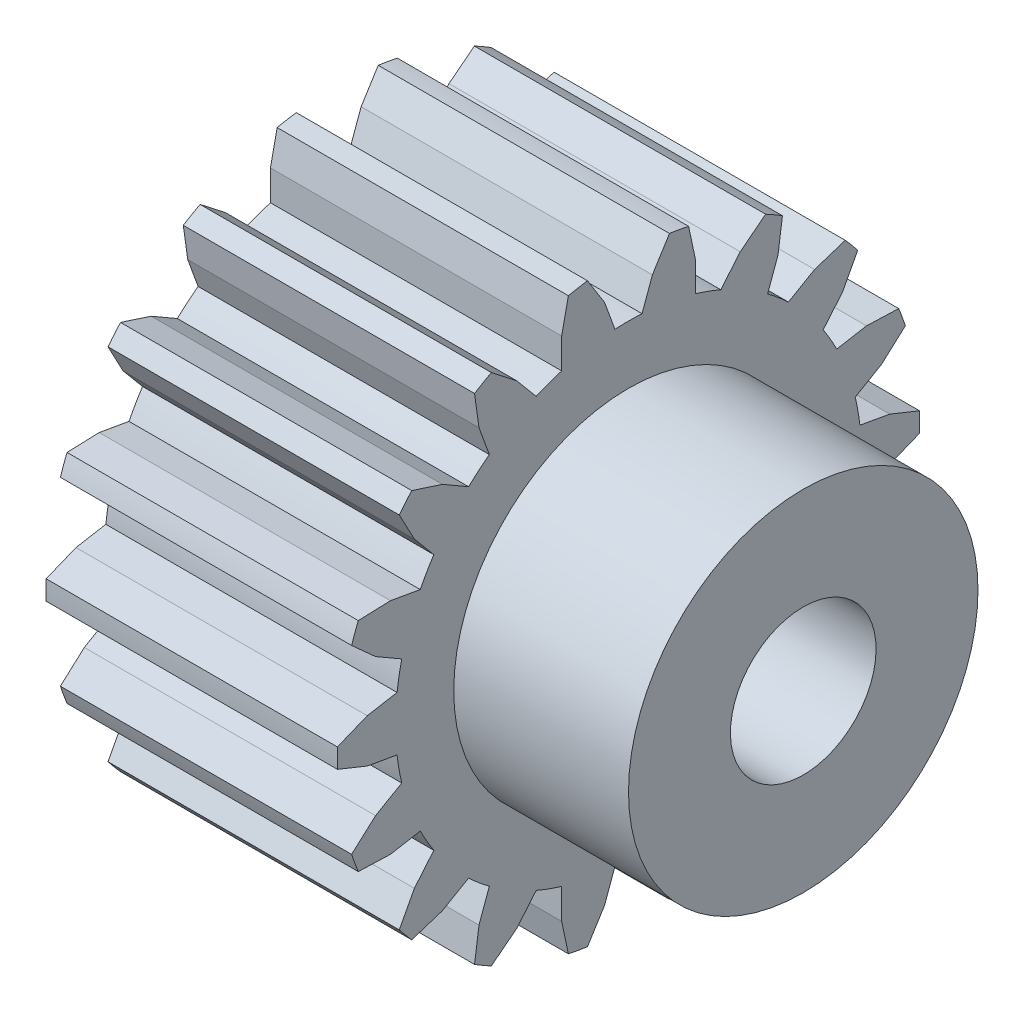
ISO-10303-21;
HEADER;
FILE_DESCRIPTION(('STEP AP214'),'2;1');
FILE_NAME('part.step','',(''),(''),'','','');
FILE_SCHEMA(('AUTOMOTIVE_DESIGN { 1 0 10303 214 1 1 1 1 }'));
ENDSEC;
DATA;
#1=APPLICATION_CONTEXT('core data for automotive mechanical design processes');
#2=APPLICATION_PROTOCOL_DEFINITION('international standard','automotive_design',2000,#1);
#3=PRODUCT_CONTEXT('',#1,'mechanical');
#4=PRODUCT('Part','Part','',(#3));
#5=PRODUCT_RELATED_PRODUCT_CATEGORY('part','',(#4));
#6=PRODUCT_DEFINITION_FORMATION('','',#4);
#7=PRODUCT_DEFINITION_CONTEXT('part definition',#1,'design');
#8=PRODUCT_DEFINITION('design','',#6,#7);
#9=PRODUCT_DEFINITION_SHAPE('','',#8);
#10=(LENGTH_UNIT() NAMED_UNIT(*) SI_UNIT(.MILLI.,.METRE.));
#11=(NAMED_UNIT(*) PLANE_ANGLE_UNIT() SI_UNIT($,.RADIAN.));
#12=(NAMED_UNIT(*) SI_UNIT($,.STERADIAN.) SOLID_ANGLE_UNIT());
#13=UNCERTAINTY_MEASURE_WITH_UNIT(LENGTH_MEASURE(1.E-05),#10,'distance_accuracy_value','');
#14=(GEOMETRIC_REPRESENTATION_CONTEXT(3) GLOBAL_UNCERTAINTY_ASSIGNED_CONTEXT((#13)) GLOBAL_UNIT_ASSIGNED_CONTEXT((#10,
#11,#12)) REPRESENTATION_CONTEXT('',''));
#15=CARTESIAN_POINT('',(0.,0.,0.));
#16=DIRECTION('',(0.,0.,1.));
#17=DIRECTION('',(1.,0.,0.));
#18=AXIS2_PLACEMENT_3D('',#15,#16,#17);
#19=CARTESIAN_POINT('',(5.,0.,0.));
#20=DIRECTION('',(1.,0.,0.));
#21=DIRECTION('',(0.,0.,-1.));
#22=AXIS2_PLACEMENT_3D('',#19,#20,#21);
#23=PLANE('',#22);
#24=CARTESIAN_POINT('',(5.,0.,0.));
#25=DIRECTION('',(-1.,0.,0.));
#26=DIRECTION('',(0.,1.,0.));
#27=AXIS2_PLACEMENT_3D('',#24,#25,#26);
#28=CIRCLE('',#27,6.);
#29=CARTESIAN_POINT('',(5.,6.,0.));
#30=VERTEX_POINT('',#29);
#31=EDGE_CURVE('E9',#30,#30,#28,.T.);
#32=ORIENTED_EDGE('',*,*,#31,.T.);
#33=EDGE_LOOP('',(#32));
#34=FACE_BOUND('',#33,.T.);
#35=CARTESIAN_POINT('',(5.,2.46747067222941E-13,2.06057393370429E-12));
#36=DIRECTION('',(1.,0.,0.));
#37=DIRECTION('',(0.,0.0333333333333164,0.999444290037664));
#38=AXIS2_PLACEMENT_3D('',#35,#36,#37);
#39=CIRCLE('',#38,9.99999999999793);
#40=CARTESIAN_POINT('',(5.,0.333333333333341,9.99444290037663));
#41=VERTEX_POINT('',#40);
#42=CARTESIAN_POINT('',(5.,-0.333333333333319,9.99444290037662));
#43=VERTEX_POINT('',#42);
#44=EDGE_CURVE('E25',#41,#43,#39,.T.);
#45=ORIENTED_EDGE('',*,*,#44,.T.);
#46=DIRECTION('',(0.,-0.375124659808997,-0.92697437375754));
#47=VECTOR('',#46,1.);
#48=CARTESIAN_POINT('',(5.,-0.33333333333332,9.99444290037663));
#49=LINE('',#48,#47);
#50=CARTESIAN_POINT('',(5.,-0.748374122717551,8.96883137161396));
#51=VERTEX_POINT('',#50);
#52=EDGE_CURVE('E757',#43,#51,#49,.T.);
#53=ORIENTED_EDGE('',*,*,#52,.T.);
#54=DIRECTION('',(0.,-0.173648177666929,-0.984807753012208));
#55=VECTOR('',#54,1.);
#56=CARTESIAN_POINT('',(5.,-0.748374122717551,8.96883137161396));
#57=LINE('',#56,#55);
#58=CARTESIAN_POINT('',(5.,-0.928743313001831,7.94590686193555));
#59=VERTEX_POINT('',#58);
#60=EDGE_CURVE('E1033',#51,#59,#57,.T.);
#61=ORIENTED_EDGE('',*,*,#60,.T.);
#62=CARTESIAN_POINT('',(5.,1.63202784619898E-13,0.));
#63=DIRECTION('',(1.,0.,0.));
#64=DIRECTION('',(0.,-0.116092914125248,0.993238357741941));
#65=AXIS2_PLACEMENT_3D('',#62,#63,#64);
#66=CIRCLE('',#65,8.00000000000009);
#67=CARTESIAN_POINT('',(5.,-1.84492696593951,7.78435896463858));
#68=VERTEX_POINT('',#67);
#69=EDGE_CURVE('E1087',#59,#68,#66,.T.);
#70=ORIENTED_EDGE('',*,*,#69,.T.);
#71=DIRECTION('',(0.,-0.5,0.866025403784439));
#72=VECTOR('',#71,1.);
#73=CARTESIAN_POINT('',(5.,-1.84492696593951,7.78435896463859));
#74=LINE('',#73,#72);
#75=CARTESIAN_POINT('',(5.,-2.36427935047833,8.68390368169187));
#76=VERTEX_POINT('',#75);
#77=EDGE_CURVE('E1086',#68,#76,#74,.T.);
#78=ORIENTED_EDGE('',*,*,#77,.T.);
#79=DIRECTION('',(0.,-0.669545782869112,0.742770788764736));
#80=VECTOR('',#79,1.);
#81=CARTESIAN_POINT('',(5.,-2.36427935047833,8.68390368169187));
#82=LINE('',#81,#80);
#83=CARTESIAN_POINT('',(5.,-3.10506991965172,9.50571095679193));
#84=VERTEX_POINT('',#83);
#85=EDGE_CURVE('E904',#76,#84,#82,.T.);
#86=ORIENTED_EDGE('',*,*,#85,.T.);
#87=CARTESIAN_POINT('',(5.,0.,-4.83169060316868E-13));
#88=DIRECTION('',(1.,0.,0.));
#89=DIRECTION('',(0.,-0.310506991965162,0.950571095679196));
#90=AXIS2_PLACEMENT_3D('',#87,#88,#89);
#91=CIRCLE('',#90,10.0000000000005);
#92=CARTESIAN_POINT('',(5.,-3.73153166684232,9.27769752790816));
#93=VERTEX_POINT('',#92);
#94=EDGE_CURVE('E900',#84,#93,#91,.T.);
#95=ORIENTED_EDGE('',*,*,#94,.T.);
#96=DIRECTION('',(0.,-0.0354579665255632,-0.999371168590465));
#97=VECTOR('',#96,1.);
#98=CARTESIAN_POINT('',(5.,-3.73153166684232,9.27769752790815));
#99=LINE('',#98,#97);
#100=CARTESIAN_POINT('',(5.,-3.77076263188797,8.17198563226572));
#101=VERTEX_POINT('',#100);
#102=EDGE_CURVE('E898',#93,#101,#99,.T.);
#103=ORIENTED_EDGE('',*,*,#102,.T.);
#104=DIRECTION('',(0.,0.173648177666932,-0.984807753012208));
#105=VECTOR('',#104,1.);
#106=CARTESIAN_POINT('',(5.,-3.77076263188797,8.17198563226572));
#107=LINE('',#106,#105);
#108=CARTESIAN_POINT('',(5.,-3.59039344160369,7.1490611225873));
#109=VERTEX_POINT('',#108);
#110=EDGE_CURVE('E901',#101,#109,#107,.T.);
#111=ORIENTED_EDGE('',*,*,#110,.T.);
#112=CARTESIAN_POINT('',(5.,-1.99396055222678E-13,3.90798504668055E-13));
#113=DIRECTION('',(1.,0.,0.));
#114=DIRECTION('',(0.,-0.44879918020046,0.893632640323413));
#115=AXIS2_PLACEMENT_3D('',#112,#113,#114);
#116=CIRCLE('',#115,7.99999999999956);
#117=CARTESIAN_POINT('',(5.,-4.39607182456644,6.6839024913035));
#118=VERTEX_POINT('',#117);
#119=EDGE_CURVE('E673',#109,#118,#116,.T.);
#120=ORIENTED_EDGE('',*,*,#119,.T.);
#121=DIRECTION('',(0.,-0.766044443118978,0.64278760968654));
#122=VECTOR('',#121,1.);
#123=CARTESIAN_POINT('',(5.,-4.39607182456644,6.6839024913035));
#124=LINE('',#123,#122);
#125=CARTESIAN_POINT('',(5.,-5.19176584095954,7.35156904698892));
#126=VERTEX_POINT('',#125);
#127=EDGE_CURVE('E667',#118,#126,#124,.T.);
#128=ORIENTED_EDGE('',*,*,#127,.T.);
#129=DIRECTION('',(0.,-0.883209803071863,0.468978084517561));
#130=VECTOR('',#129,1.);
#131=CARTESIAN_POINT('',(5.,-5.19176584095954,7.35156904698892));
#132=LINE('',#131,#130);
#133=CARTESIAN_POINT('',(5.,-6.16895591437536,7.87044998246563));
#134=VERTEX_POINT('',#133);
#135=EDGE_CURVE('E657',#126,#134,#132,.T.);
#136=ORIENTED_EDGE('',*,*,#135,.T.);
#137=CARTESIAN_POINT('',(5.,-4.18332035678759E-13,7.39852623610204E-13));
#138=DIRECTION('',(1.,0.,0.));
#139=DIRECTION('',(0.,-0.616895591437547,0.787044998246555));
#140=AXIS2_PLACEMENT_3D('',#137,#138,#139);
#141=CIRCLE('',#140,9.99999999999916);
#142=CARTESIAN_POINT('',(5.,-6.679652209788,7.44192490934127));
#143=VERTEX_POINT('',#142);
#144=EDGE_CURVE('E668',#134,#143,#141,.T.);
#145=ORIENTED_EDGE('',*,*,#144,.T.);
#146=DIRECTION('',(0.,0.308485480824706,-0.95122905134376));
#147=VECTOR('',#146,1.);
#148=CARTESIAN_POINT('',(5.,-6.67965220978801,7.44192490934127));
#149=LINE('',#148,#147);
#150=CARTESIAN_POINT('',(5.,-6.3383415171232,6.38947782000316));
#151=VERTEX_POINT('',#150);
#152=EDGE_CURVE('E1154',#143,#151,#149,.T.);
#153=ORIENTED_EDGE('',*,*,#152,.T.);
#154=DIRECTION('',(0.,0.500000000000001,-0.866025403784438));
#155=VECTOR('',#154,1.);
#156=CARTESIAN_POINT('',(5.,-6.3383415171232,6.38947782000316));
#157=LINE('',#156,#155);
#158=CARTESIAN_POINT('',(5.,-5.81898913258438,5.48993310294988));
#159=VERTEX_POINT('',#158);
#160=EDGE_CURVE('E1213',#151,#159,#157,.T.);
#161=ORIENTED_EDGE('',*,*,#160,.T.);
#162=CARTESIAN_POINT('',(5.,0.,0.));
#163=DIRECTION('',(1.,0.,0.));
#164=DIRECTION('',(0.,-0.727373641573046,0.686241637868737));
#165=AXIS2_PLACEMENT_3D('',#162,#163,#164);
#166=CIRCLE('',#165,8.00000000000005);
#167=CARTESIAN_POINT('',(5.,-6.41698554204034,4.7772687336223));
#168=VERTEX_POINT('',#167);
#169=EDGE_CURVE('E1215',#159,#168,#166,.T.);
#170=ORIENTED_EDGE('',*,*,#169,.T.);
#171=DIRECTION('',(0.,-0.939692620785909,0.342020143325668));
#172=VECTOR('',#171,1.);
#173=CARTESIAN_POINT('',(5.,-6.41698554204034,4.7772687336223));
#174=LINE('',#173,#172);
#175=CARTESIAN_POINT('',(5.,-7.39304874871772,5.13252668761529));
#176=VERTEX_POINT('',#175);
#177=EDGE_CURVE('E1411',#168,#176,#174,.T.);
#178=ORIENTED_EDGE('',*,*,#177,.T.);
#179=DIRECTION('',(0.,-0.990345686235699,0.138619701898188));
#180=VECTOR('',#179,1.);
#181=CARTESIAN_POINT('',(5.,-7.39304874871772,5.13252668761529));
#182=LINE('',#181,#180);
#183=CARTESIAN_POINT('',(5.,-8.48877478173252,5.28589658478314));
#184=VERTEX_POINT('',#183);
#185=EDGE_CURVE('E1369',#176,#184,#182,.T.);
#186=ORIENTED_EDGE('',*,*,#185,.T.);
#187=CARTESIAN_POINT('',(5.,0.,-2.20268248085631E-13));
#188=DIRECTION('',(1.,0.,0.));
#189=DIRECTION('',(0.,-0.848877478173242,0.528589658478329));
#190=AXIS2_PLACEMENT_3D('',#187,#188,#189);
#191=CIRCLE('',#190,10.0000000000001);
#192=CARTESIAN_POINT('',(5.,-8.82210811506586,4.70854631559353));
#193=VERTEX_POINT('',#192);
#194=EDGE_CURVE('E1322',#184,#193,#191,.T.);
#195=ORIENTED_EDGE('',*,*,#194,.T.);
#196=DIRECTION('',(0.,0.615221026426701,-0.788354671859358));
#197=VECTOR('',#196,1.);
#198=CARTESIAN_POINT('',(5.,-8.82210811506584,4.70854631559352));
#199=LINE('',#198,#197);
#200=CARTESIAN_POINT('',(5.,-8.14142287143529,3.83630468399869));
#201=VERTEX_POINT('',#200);
#202=EDGE_CURVE('E1319',#193,#201,#199,.T.);
#203=ORIENTED_EDGE('',*,*,#202,.T.);
#204=DIRECTION('',(0.,0.766044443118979,-0.642787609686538));
#205=VECTOR('',#204,1.);
#206=CARTESIAN_POINT('',(5.,-8.14142287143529,3.83630468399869));
#207=LINE('',#206,#205);
#208=CARTESIAN_POINT('',(5.,-7.34572885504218,3.16863812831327));
#209=VERTEX_POINT('',#208);
#210=EDGE_CURVE('E1211',#201,#209,#207,.T.);
#211=ORIENTED_EDGE('',*,*,#210,.T.);
#212=CARTESIAN_POINT('',(5.,-4.9737991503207E-13,1.68309810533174E-13));
#213=DIRECTION('',(1.,0.,0.));
#214=DIRECTION('',(0.,-0.918216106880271,0.396079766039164));
#215=AXIS2_PLACEMENT_3D('',#212,#213,#214);
#216=CIRCLE('',#215,7.99999999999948);
#217=CARTESIAN_POINT('',(5.,-7.66391609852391,2.29442586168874));
#218=VERTEX_POINT('',#217);
#219=EDGE_CURVE('E1078',#209,#218,#216,.T.);
#220=ORIENTED_EDGE('',*,*,#219,.T.);
#221=DIRECTION('',(0.,-1.,0.));
#222=VECTOR('',#221,1.);
#223=CARTESIAN_POINT('',(5.,-7.66391609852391,2.29442586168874));
#224=LINE('',#223,#222);
#225=CARTESIAN_POINT('',(5.,-8.70262086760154,2.29442586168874));
#226=VERTEX_POINT('',#225);
#227=EDGE_CURVE('E1075',#218,#226,#224,.T.);
#228=ORIENTED_EDGE('',*,*,#227,.T.);
#229=DIRECTION('',(0.,-0.978031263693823,-0.208458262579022));
#230=VECTOR('',#229,1.);
#231=CARTESIAN_POINT('',(5.,-8.70262086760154,2.29442586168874));
#232=LINE('',#231,#230);
#233=CARTESIAN_POINT('',(5.,-9.78472212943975,2.06378604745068));
#234=VERTEX_POINT('',#233);
#235=EDGE_CURVE('E1079',#226,#234,#232,.T.);
#236=ORIENTED_EDGE('',*,*,#235,.T.);
#237=CARTESIAN_POINT('',(5.,-1.14930287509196E-12,0.));
#238=DIRECTION('',(1.,0.,0.));
#239=DIRECTION('',(0.,-0.978472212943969,0.206378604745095));
#240=AXIS2_PLACEMENT_3D('',#237,#238,#239);
#241=CIRCLE('',#240,9.99999999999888);
#242=CARTESIAN_POINT('',(5.,-9.90048758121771,1.40724754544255));
#243=VERTEX_POINT('',#242);
#244=EDGE_CURVE('E1308',#234,#243,#241,.T.);
#245=ORIENTED_EDGE('',*,*,#244,.T.);
#246=DIRECTION('',(0.,0.847751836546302,-0.53039308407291));
#247=VECTOR('',#246,1.);
#248=CARTESIAN_POINT('',(5.,-9.9004875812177,1.40724754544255));
#249=LINE('',#248,#247);
#250=CARTESIAN_POINT('',(5.,-8.96252847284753,0.820416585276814));
#251=VERTEX_POINT('',#250);
#252=EDGE_CURVE('E1304',#243,#251,#249,.T.);
#253=ORIENTED_EDGE('',*,*,#252,.T.);
#254=DIRECTION('',(0.,0.939692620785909,-0.342020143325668));
#255=VECTOR('',#254,1.);
#256=CARTESIAN_POINT('',(5.,-8.96252847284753,0.820416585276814));
#257=LINE('',#256,#255);
#258=CARTESIAN_POINT('',(5.,-7.98646526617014,0.465158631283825));
#259=VERTEX_POINT('',#258);
#260=EDGE_CURVE('E1301',#251,#259,#257,.T.);
#261=ORIENTED_EDGE('',*,*,#260,.T.);
#262=CARTESIAN_POINT('',(5.,0.,0.));
#263=DIRECTION('',(1.,0.,0.));
#264=DIRECTION('',(0.,-0.998308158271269,0.0581448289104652));
#265=AXIS2_PLACEMENT_3D('',#262,#263,#264);
#266=CIRCLE('',#265,8.00000000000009);
#267=CARTESIAN_POINT('',(5.,-7.98646526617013,-0.465158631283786));
#268=VERTEX_POINT('',#267);
#269=EDGE_CURVE('E1299',#259,#268,#266,.T.);
#270=ORIENTED_EDGE('',*,*,#269,.T.);
#271=DIRECTION('',(0.,-0.939692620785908,-0.342020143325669));
#272=VECTOR('',#271,1.);
#273=CARTESIAN_POINT('',(5.,-7.98646526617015,-0.465158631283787));
#274=LINE('',#273,#272);
#275=CARTESIAN_POINT('',(5.,-8.96252847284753,-0.820416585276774));
#276=VERTEX_POINT('',#275);
#277=EDGE_CURVE('E1297',#268,#276,#274,.T.);
#278=ORIENTED_EDGE('',*,*,#277,.T.);
#279=DIRECTION('',(0.,-0.847751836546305,-0.530393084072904));
#280=VECTOR('',#279,1.);
#281=CARTESIAN_POINT('',(5.,-8.96252847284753,-0.820416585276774));
#282=LINE('',#281,#280);
#283=CARTESIAN_POINT('',(5.,-9.90048758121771,-1.4072475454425));
#284=VERTEX_POINT('',#283);
#285=EDGE_CURVE('E1145',#276,#284,#282,.T.);
#286=ORIENTED_EDGE('',*,*,#285,.T.);
#287=CARTESIAN_POINT('',(5.,7.31859017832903E-13,0.));
#288=DIRECTION('',(1.,0.,0.));
#289=DIRECTION('',(0.,-0.990048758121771,-0.140724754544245));
#290=AXIS2_PLACEMENT_3D('',#287,#288,#289);
#291=CIRCLE('',#290,10.0000000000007);
#292=CARTESIAN_POINT('',(5.,-9.78472212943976,-2.06378604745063));
#293=VERTEX_POINT('',#292);
#294=EDGE_CURVE('E1142',#284,#293,#291,.T.);
#295=ORIENTED_EDGE('',*,*,#294,.T.);
#296=DIRECTION('',(0.,0.978031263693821,-0.208458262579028));
#297=VECTOR('',#296,1.);
#298=CARTESIAN_POINT('',(5.,-9.78472212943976,-2.06378604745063));
#299=LINE('',#298,#297);
#300=CARTESIAN_POINT('',(5.,-8.70262086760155,-2.2944258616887));
#301=VERTEX_POINT('',#300);
#302=EDGE_CURVE('E1074',#293,#301,#299,.T.);
#303=ORIENTED_EDGE('',*,*,#302,.T.);
#304=DIRECTION('',(0.,1.,0.));
#305=VECTOR('',#304,1.);
#306=CARTESIAN_POINT('',(5.,-8.70262086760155,-2.2944258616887));
#307=LINE('',#306,#305);
#308=CARTESIAN_POINT('',(5.,-7.66391609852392,-2.2944258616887));
#309=VERTEX_POINT('',#308);
#310=EDGE_CURVE('E1071',#301,#309,#307,.T.);
#311=ORIENTED_EDGE('',*,*,#310,.T.);
#312=CARTESIAN_POINT('',(5.,0.,1.09245945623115E-13));
#313=DIRECTION('',(1.,0.,0.));
#314=DIRECTION('',(0.,-0.957989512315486,-0.286803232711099));
#315=AXIS2_PLACEMENT_3D('',#312,#313,#314);
#316=CIRCLE('',#315,8.00000000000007);
#317=CARTESIAN_POINT('',(5.,-7.34572885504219,-3.16863812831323));
#318=VERTEX_POINT('',#317);
#319=EDGE_CURVE('E730',#309,#318,#316,.T.);
#320=ORIENTED_EDGE('',*,*,#319,.T.);
#321=DIRECTION('',(0.,-0.766044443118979,-0.642787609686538));
#322=VECTOR('',#321,1.);
#323=CARTESIAN_POINT('',(5.,-7.3457288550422,-3.16863812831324));
#324=LINE('',#323,#322);
#325=CARTESIAN_POINT('',(5.,-8.1414228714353,-3.83630468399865));
#326=VERTEX_POINT('',#325);
#327=EDGE_CURVE('E727',#318,#326,#324,.T.);
#328=ORIENTED_EDGE('',*,*,#327,.T.);
#329=DIRECTION('',(0.,-0.615221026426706,-0.788354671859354));
#330=VECTOR('',#329,1.);
#331=CARTESIAN_POINT('',(5.,-8.1414228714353,-3.83630468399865));
#332=LINE('',#331,#330);
#333=CARTESIAN_POINT('',(5.,-8.82210811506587,-4.70854631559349));
#334=VERTEX_POINT('',#333);
#335=EDGE_CURVE('E731',#326,#334,#332,.T.);
#336=ORIENTED_EDGE('',*,*,#335,.T.);
#337=CARTESIAN_POINT('',(5.,-3.64153152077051E-13,-2.1227464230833E-13));
#338=DIRECTION('',(1.,0.,0.));
#339=DIRECTION('',(0.,-0.882210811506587,-0.470854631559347));
#340=AXIS2_PLACEMENT_3D('',#337,#338,#339);
#341=CIRCLE('',#340,9.99999999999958);
#342=CARTESIAN_POINT('',(5.,-8.48877478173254,-5.2858965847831));
#343=VERTEX_POINT('',#342);
#344=EDGE_CURVE('E811',#334,#343,#341,.T.);
#345=ORIENTED_EDGE('',*,*,#344,.T.);
#346=DIRECTION('',(0.,0.9903456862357,0.138619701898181));
#347=VECTOR('',#346,1.);
#348=CARTESIAN_POINT('',(5.,-8.48877478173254,-5.2858965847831));
#349=LINE('',#348,#347);
#350=CARTESIAN_POINT('',(5.,-7.39304874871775,-5.13252668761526));
#351=VERTEX_POINT('',#350);
#352=EDGE_CURVE('E966',#343,#351,#349,.T.);
#353=ORIENTED_EDGE('',*,*,#352,.T.);
#354=DIRECTION('',(0.,0.939692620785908,0.342020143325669));
#355=VECTOR('',#354,1.);
#356=CARTESIAN_POINT('',(5.,-7.39304874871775,-5.13252668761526));
#357=LINE('',#356,#355);
#358=CARTESIAN_POINT('',(5.,-6.41698554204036,-4.77726873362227));
#359=VERTEX_POINT('',#358);
#360=EDGE_CURVE('E969',#351,#359,#357,.T.);
#361=ORIENTED_EDGE('',*,*,#360,.T.);
#362=CARTESIAN_POINT('',(5.,1.56319401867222E-13,0.));
#363=DIRECTION('',(1.,0.,0.));
#364=DIRECTION('',(0.,-0.802123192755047,-0.597158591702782));
#365=AXIS2_PLACEMENT_3D('',#362,#363,#364);
#366=CIRCLE('',#365,8.00000000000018);
#367=CARTESIAN_POINT('',(5.,-5.81898913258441,-5.48993310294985));
#368=VERTEX_POINT('',#367);
#369=EDGE_CURVE('E1139',#359,#368,#366,.T.);
#370=ORIENTED_EDGE('',*,*,#369,.T.);
#371=DIRECTION('',(0.,-0.500000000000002,-0.866025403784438));
#372=VECTOR('',#371,1.);
#373=CARTESIAN_POINT('',(5.,-5.81898913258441,-5.48993310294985));
#374=LINE('',#373,#372);
#375=CARTESIAN_POINT('',(5.,-6.33834151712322,-6.38947782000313));
#376=VERTEX_POINT('',#375);
#377=EDGE_CURVE('E1357',#368,#376,#374,.T.);
#378=ORIENTED_EDGE('',*,*,#377,.T.);
#379=DIRECTION('',(0.,-0.308485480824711,-0.951229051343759));
#380=VECTOR('',#379,1.);
#381=CARTESIAN_POINT('',(5.,-6.33834151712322,-6.38947782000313));
#382=LINE('',#381,#380);
#383=CARTESIAN_POINT('',(5.,-6.67965220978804,-7.44192490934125));
#384=VERTEX_POINT('',#383);
#385=EDGE_CURVE('E1245',#376,#384,#382,.T.);
#386=ORIENTED_EDGE('',*,*,#385,.T.);
#387=CARTESIAN_POINT('',(5.,-2.53930210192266E-12,-3.08730818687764E-12));
#388=DIRECTION('',(1.,0.,0.));
#389=DIRECTION('',(0.,-0.667965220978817,-0.744192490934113));
#390=AXIS2_PLACEMENT_3D('',#387,#388,#389);
#391=CIRCLE('',#390,9.99999999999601);
#392=CARTESIAN_POINT('',(5.,-6.1689559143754,-7.8704499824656));
#393=VERTEX_POINT('',#392);
#394=EDGE_CURVE('E1242',#384,#393,#391,.T.);
#395=ORIENTED_EDGE('',*,*,#394,.T.);
#396=DIRECTION('',(0.,0.883209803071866,0.468978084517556));
#397=VECTOR('',#396,1.);
#398=CARTESIAN_POINT('',(5.,-6.16895591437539,-7.8704499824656));
#399=LINE('',#398,#397);
#400=CARTESIAN_POINT('',(5.,-5.19176584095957,-7.3515690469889));
#401=VERTEX_POINT('',#400);
#402=EDGE_CURVE('E1246',#393,#401,#399,.T.);
#403=ORIENTED_EDGE('',*,*,#402,.T.);
#404=DIRECTION('',(0.,0.766044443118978,0.64278760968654));
#405=VECTOR('',#404,1.);
#406=CARTESIAN_POINT('',(5.,-5.19176584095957,-7.3515690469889));
#407=LINE('',#406,#405);
#408=CARTESIAN_POINT('',(5.,-4.39607182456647,-6.68390249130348));
#409=VERTEX_POINT('',#408);
#410=EDGE_CURVE('E1460',#401,#409,#407,.T.);
#411=ORIENTED_EDGE('',*,*,#410,.T.);
#412=CARTESIAN_POINT('',(5.,1.27897692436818E-13,2.36255459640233E-13));
#413=DIRECTION('',(1.,0.,0.));
#414=DIRECTION('',(0.,-0.549508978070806,-0.835487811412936));
#415=AXIS2_PLACEMENT_3D('',#412,#413,#414);
#416=CIRCLE('',#415,8.00000000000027);
#417=CARTESIAN_POINT('',(5.,-3.59039344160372,-7.14906112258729));
#418=VERTEX_POINT('',#417);
#419=EDGE_CURVE('E726',#409,#418,#416,.T.);
#420=ORIENTED_EDGE('',*,*,#419,.T.);
#421=DIRECTION('',(0.,-0.173648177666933,-0.984807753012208));
#422=VECTOR('',#421,1.);
#423=CARTESIAN_POINT('',(5.,-3.59039344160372,-7.14906112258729));
#424=LINE('',#423,#422);
#425=CARTESIAN_POINT('',(5.,-3.770762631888,-8.17198563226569));
#426=VERTEX_POINT('',#425);
#427=EDGE_CURVE('E722',#418,#426,#424,.T.);
#428=ORIENTED_EDGE('',*,*,#427,.T.);
#429=DIRECTION('',(0.,0.0354579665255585,-0.999371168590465));
#430=VECTOR('',#429,1.);
#431=CARTESIAN_POINT('',(5.,-3.770762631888,-8.17198563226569));
#432=LINE('',#431,#430);
#433=CARTESIAN_POINT('',(5.,-3.73153166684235,-9.27769752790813));
#434=VERTEX_POINT('',#433);
#435=EDGE_CURVE('E719',#426,#434,#432,.T.);
#436=ORIENTED_EDGE('',*,*,#435,.T.);
#437=CARTESIAN_POINT('',(5.,-9.50794998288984E-13,-2.36788366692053E-12));
#438=DIRECTION('',(1.,0.,0.));
#439=DIRECTION('',(0.,-0.373153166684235,-0.927769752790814));
#440=AXIS2_PLACEMENT_3D('',#437,#438,#439);
#441=CIRCLE('',#440,9.99999999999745);
#442=CARTESIAN_POINT('',(5.,-3.10506991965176,-9.50571095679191));
#443=VERTEX_POINT('',#442);
#444=EDGE_CURVE('E723',#434,#443,#441,.T.);
#445=ORIENTED_EDGE('',*,*,#444,.T.);
#446=DIRECTION('',(0.,0.669545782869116,0.742770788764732));
#447=VECTOR('',#446,1.);
#448=CARTESIAN_POINT('',(5.,-3.10506991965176,-9.50571095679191));
#449=LINE('',#448,#447);
#450=CARTESIAN_POINT('',(5.,-2.36427935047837,-8.68390368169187));
#451=VERTEX_POINT('',#450);
#452=EDGE_CURVE('E802',#443,#451,#449,.T.);
#453=ORIENTED_EDGE('',*,*,#452,.T.);
#454=DIRECTION('',(0.,0.5,0.866025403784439));
#455=VECTOR('',#454,1.);
#456=CARTESIAN_POINT('',(5.,-2.36427935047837,-8.68390368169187));
#457=LINE('',#456,#455);
#458=CARTESIAN_POINT('',(5.,-1.84492696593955,-7.78435896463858));
#459=VERTEX_POINT('',#458);
#460=EDGE_CURVE('E799',#451,#459,#457,.T.);
#461=ORIENTED_EDGE('',*,*,#460,.T.);
#462=CARTESIAN_POINT('',(5.,-1.64979141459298E-13,-1.02762243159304E-12));
#463=DIRECTION('',(1.,0.,0.));
#464=DIRECTION('',(0.,-0.230615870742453,-0.973044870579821));
#465=AXIS2_PLACEMENT_3D('',#462,#463,#464);
#466=CIRCLE('',#465,7.99999999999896);
#467=CARTESIAN_POINT('',(5.,-0.928743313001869,-7.94590686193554));
#468=VERTEX_POINT('',#467);
#469=EDGE_CURVE('E803',#459,#468,#466,.T.);
#470=ORIENTED_EDGE('',*,*,#469,.T.);
#471=DIRECTION('',(0.,0.173648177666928,-0.984807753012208));
#472=VECTOR('',#471,1.);
#473=CARTESIAN_POINT('',(5.,-0.928743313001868,-7.94590686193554));
#474=LINE('',#473,#472);
#475=CARTESIAN_POINT('',(5.,-0.74837412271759,-8.96883137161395));
#476=VERTEX_POINT('',#475);
#477=EDGE_CURVE('E1294',#468,#476,#474,.T.);
#478=ORIENTED_EDGE('',*,*,#477,.T.);
#479=DIRECTION('',(0.,0.375124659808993,-0.926974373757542));
#480=VECTOR('',#479,1.);
#481=CARTESIAN_POINT('',(5.,-0.74837412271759,-8.96883137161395));
#482=LINE('',#481,#480);
#483=CARTESIAN_POINT('',(5.,-0.33333333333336,-9.99444290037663));
#484=VERTEX_POINT('',#483);
#485=EDGE_CURVE('E717',#476,#484,#482,.T.);
#486=ORIENTED_EDGE('',*,*,#485,.T.);
#487=CARTESIAN_POINT('',(5.,-1.53488333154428E-13,-6.19948536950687E-13));
#488=DIRECTION('',(1.,0.,0.));
#489=DIRECTION('',(0.,-0.0333333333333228,-0.999444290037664));
#490=AXIS2_PLACEMENT_3D('',#487,#488,#489);
#491=CIRCLE('',#490,9.99999999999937);
#492=CARTESIAN_POINT('',(5.,0.333333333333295,-9.99444290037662));
#493=VERTEX_POINT('',#492);
#494=EDGE_CURVE('E714',#484,#493,#491,.T.);
#495=ORIENTED_EDGE('',*,*,#494,.T.);
#496=DIRECTION('',(0.,0.375124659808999,0.92697437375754));
#497=VECTOR('',#496,1.);
#498=CARTESIAN_POINT('',(5.,0.333333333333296,-9.99444290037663));
#499=LINE('',#498,#497);
#500=CARTESIAN_POINT('',(5.,0.748374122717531,-8.96883137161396));
#501=VERTEX_POINT('',#500);
#502=EDGE_CURVE('E718',#493,#501,#499,.T.);
#503=ORIENTED_EDGE('',*,*,#502,.T.);
#504=DIRECTION('',(0.,0.17364817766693,0.984807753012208));
#505=VECTOR('',#504,1.);
#506=CARTESIAN_POINT('',(5.,0.748374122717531,-8.96883137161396));
#507=LINE('',#506,#505);
#508=CARTESIAN_POINT('',(5.,0.928743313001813,-7.94590686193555));
#509=VERTEX_POINT('',#508);
#510=EDGE_CURVE('E712',#501,#509,#507,.T.);
#511=ORIENTED_EDGE('',*,*,#510,.T.);
#512=CARTESIAN_POINT('',(5.,0.,-2.77999845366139E-13));
#513=DIRECTION('',(1.,0.,0.));
#514=DIRECTION('',(0.,0.116092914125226,-0.993238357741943));
#515=AXIS2_PLACEMENT_3D('',#512,#513,#514);
#516=CIRCLE('',#515,7.99999999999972);
#517=CARTESIAN_POINT('',(5.,1.84492696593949,-7.78435896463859));
#518=VERTEX_POINT('',#517);
#519=EDGE_CURVE('E709',#509,#518,#516,.T.);
#520=ORIENTED_EDGE('',*,*,#519,.T.);
#521=DIRECTION('',(0.,0.499999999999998,-0.86602540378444));
#522=VECTOR('',#521,1.);
#523=CARTESIAN_POINT('',(5.,1.84492696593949,-7.7843589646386));
#524=LINE('',#523,#522);
#525=CARTESIAN_POINT('',(5.,2.36427935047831,-8.68390368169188));
#526=VERTEX_POINT('',#525);
#527=EDGE_CURVE('E713',#518,#526,#524,.T.);
#528=ORIENTED_EDGE('',*,*,#527,.T.);
#529=DIRECTION('',(0.,0.669545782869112,-0.742770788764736));
#530=VECTOR('',#529,1.);
#531=CARTESIAN_POINT('',(5.,2.36427935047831,-8.68390368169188));
#532=LINE('',#531,#530);
#533=CARTESIAN_POINT('',(5.,3.1050699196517,-9.50571095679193));
#534=VERTEX_POINT('',#533);
#535=EDGE_CURVE('E795',#526,#534,#532,.T.);
#536=ORIENTED_EDGE('',*,*,#535,.T.);
#537=CARTESIAN_POINT('',(5.,9.2148511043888E-13,-2.33590924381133E-12));
#538=DIRECTION('',(1.,0.,0.));
#539=DIRECTION('',(0.,0.310506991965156,-0.950571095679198));
#540=AXIS2_PLACEMENT_3D('',#537,#538,#539);
#541=CIRCLE('',#540,9.99999999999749);
#542=CARTESIAN_POINT('',(5.,3.7315316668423,-9.27769752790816));
#543=VERTEX_POINT('',#542);
#544=EDGE_CURVE('E798',#534,#543,#541,.T.);
#545=ORIENTED_EDGE('',*,*,#544,.T.);
#546=DIRECTION('',(0.,0.035457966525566,0.999371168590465));
#547=VECTOR('',#546,1.);
#548=CARTESIAN_POINT('',(5.,3.73153166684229,-9.27769752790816));
#549=LINE('',#548,#547);
#550=CARTESIAN_POINT('',(5.,3.77076263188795,-8.17198563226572));
#551=VERTEX_POINT('',#550);
#552=EDGE_CURVE('E1056',#543,#551,#549,.T.);
#553=ORIENTED_EDGE('',*,*,#552,.T.);
#554=DIRECTION('',(0.,-0.17364817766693,0.984807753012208));
#555=VECTOR('',#554,1.);
#556=CARTESIAN_POINT('',(5.,3.77076263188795,-8.17198563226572));
#557=LINE('',#556,#555);
#558=CARTESIAN_POINT('',(5.,3.59039344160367,-7.14906112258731));
#559=VERTEX_POINT('',#558);
#560=EDGE_CURVE('E948',#551,#559,#557,.T.);
#561=ORIENTED_EDGE('',*,*,#560,.T.);
#562=CARTESIAN_POINT('',(5.,3.37063710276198E-13,-4.64517313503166E-13));
#563=DIRECTION('',(1.,0.,0.));
#564=DIRECTION('',(0.,0.448799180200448,-0.893632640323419));
#565=AXIS2_PLACEMENT_3D('',#562,#563,#564);
#566=CIRCLE('',#565,7.99999999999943);
#567=CARTESIAN_POINT('',(5.,4.39607182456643,-6.68390249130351));
#568=VERTEX_POINT('',#567);
#569=EDGE_CURVE('E945',#559,#568,#566,.T.);
#570=ORIENTED_EDGE('',*,*,#569,.T.);
#571=DIRECTION('',(0.,0.766044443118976,-0.642787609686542));
#572=VECTOR('',#571,1.);
#573=CARTESIAN_POINT('',(5.,4.39607182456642,-6.68390249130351));
#574=LINE('',#573,#572);
#575=CARTESIAN_POINT('',(5.,5.19176584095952,-7.35156904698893));
#576=VERTEX_POINT('',#575);
#577=EDGE_CURVE('E949',#568,#576,#574,.T.);
#578=ORIENTED_EDGE('',*,*,#577,.T.);
#579=DIRECTION('',(0.,0.883209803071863,-0.468978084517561));
#580=VECTOR('',#579,1.);
#581=CARTESIAN_POINT('',(5.,5.19176584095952,-7.35156904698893));
#582=LINE('',#581,#580);
#583=CARTESIAN_POINT('',(5.,6.16895591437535,-7.87044998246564));
#584=VERTEX_POINT('',#583);
#585=EDGE_CURVE('E784',#576,#584,#582,.T.);
#586=ORIENTED_EDGE('',*,*,#585,.T.);
#587=CARTESIAN_POINT('',(5.,1.78523862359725E-12,-2.06235029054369E-12));
#588=DIRECTION('',(1.,0.,0.));
#589=DIRECTION('',(0.,0.616895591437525,-0.787044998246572));
#590=AXIS2_PLACEMENT_3D('',#587,#588,#589);
#591=CIRCLE('',#590,9.99999999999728);
#592=CARTESIAN_POINT('',(5.,6.679652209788,-7.44192490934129));
#593=VERTEX_POINT('',#592);
#594=EDGE_CURVE('E781',#584,#593,#591,.T.);
#595=ORIENTED_EDGE('',*,*,#594,.T.);
#596=DIRECTION('',(0.,-0.308485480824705,0.95122905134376));
#597=VECTOR('',#596,1.);
#598=CARTESIAN_POINT('',(5.,6.67965220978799,-7.44192490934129));
#599=LINE('',#598,#597);
#600=CARTESIAN_POINT('',(5.,6.33834151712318,-6.38947782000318));
#601=VERTEX_POINT('',#600);
#602=EDGE_CURVE('E785',#593,#601,#599,.T.);
#603=ORIENTED_EDGE('',*,*,#602,.T.);
#604=DIRECTION('',(0.,-0.5,0.866025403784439));
#605=VECTOR('',#604,1.);
#606=CARTESIAN_POINT('',(5.,6.33834151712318,-6.38947782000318));
#607=LINE('',#606,#605);
#608=CARTESIAN_POINT('',(5.,5.81898913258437,-5.48993310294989));
#609=VERTEX_POINT('',#608);
#610=EDGE_CURVE('E1195',#601,#609,#607,.T.);
#611=ORIENTED_EDGE('',*,*,#610,.T.);
#612=CARTESIAN_POINT('',(5.,1.4210854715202E-13,-2.04281036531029E-13));
#613=DIRECTION('',(1.,0.,0.));
#614=DIRECTION('',(0.,0.72737364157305,-0.686241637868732));
#615=AXIS2_PLACEMENT_3D('',#612,#613,#614);
#616=CIRCLE('',#615,7.99999999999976);
#617=CARTESIAN_POINT('',(5.,6.41698554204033,-4.77726873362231));
#618=VERTEX_POINT('',#617);
#619=EDGE_CURVE('E940',#609,#618,#616,.T.);
#620=ORIENTED_EDGE('',*,*,#619,.T.);
#621=DIRECTION('',(0.,0.939692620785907,-0.342020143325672));
#622=VECTOR('',#621,1.);
#623=CARTESIAN_POINT('',(5.,6.41698554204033,-4.77726873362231));
#624=LINE('',#623,#622);
#625=CARTESIAN_POINT('',(5.,7.39304874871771,-5.1325266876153));
#626=VERTEX_POINT('',#625);
#627=EDGE_CURVE('E779',#618,#626,#624,.T.);
#628=ORIENTED_EDGE('',*,*,#627,.T.);
#629=DIRECTION('',(0.,0.990345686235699,-0.138619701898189));
#630=VECTOR('',#629,1.);
#631=CARTESIAN_POINT('',(5.,7.39304874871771,-5.1325266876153));
#632=LINE('',#631,#630);
#633=CARTESIAN_POINT('',(5.,8.48877478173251,-5.28589658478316));
#634=VERTEX_POINT('',#633);
#635=EDGE_CURVE('E776',#626,#634,#632,.T.);
#636=ORIENTED_EDGE('',*,*,#635,.T.);
#637=CARTESIAN_POINT('',(5.,5.38236122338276E-13,-2.00728322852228E-13));
#638=DIRECTION('',(1.,0.,0.));
#639=DIRECTION('',(0.,0.848877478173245,-0.528589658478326));
#640=AXIS2_PLACEMENT_3D('',#637,#638,#639);
#641=CIRCLE('',#640,9.99999999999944);
#642=CARTESIAN_POINT('',(5.,8.82210811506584,-4.70854631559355));
#643=VERTEX_POINT('',#642);
#644=EDGE_CURVE('E780',#634,#643,#641,.T.);
#645=ORIENTED_EDGE('',*,*,#644,.T.);
#646=DIRECTION('',(0.,-0.6152210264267,0.788354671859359));
#647=VECTOR('',#646,1.);
#648=CARTESIAN_POINT('',(5.,8.82210811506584,-4.70854631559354));
#649=LINE('',#648,#647);
#650=CARTESIAN_POINT('',(5.,8.14142287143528,-3.83630468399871));
#651=VERTEX_POINT('',#650);
#652=EDGE_CURVE('E1188',#643,#651,#649,.T.);
#653=ORIENTED_EDGE('',*,*,#652,.T.);
#654=DIRECTION('',(0.,-0.766044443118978,0.64278760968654));
#655=VECTOR('',#654,1.);
#656=CARTESIAN_POINT('',(5.,8.14142287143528,-3.83630468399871));
#657=LINE('',#656,#655);
#658=CARTESIAN_POINT('',(5.,7.34572885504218,-3.16863812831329));
#659=VERTEX_POINT('',#658);
#660=EDGE_CURVE('E1185',#651,#659,#657,.T.);
#661=ORIENTED_EDGE('',*,*,#660,.T.);
#662=CARTESIAN_POINT('',(5.,0.,0.));
#663=DIRECTION('',(1.,0.,0.));
#664=DIRECTION('',(0.,0.918216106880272,-0.396079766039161));
#665=AXIS2_PLACEMENT_3D('',#662,#663,#664);
#666=CIRCLE('',#665,8.00000000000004);
#667=CARTESIAN_POINT('',(5.,7.6639160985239,-2.29442586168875));
#668=VERTEX_POINT('',#667);
#669=EDGE_CURVE('E995',#659,#668,#666,.T.);
#670=ORIENTED_EDGE('',*,*,#669,.T.);
#671=DIRECTION('',(0.,1.,0.));
#672=VECTOR('',#671,1.);
#673=CARTESIAN_POINT('',(5.,7.6639160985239,-2.29442586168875));
#674=LINE('',#673,#672);
#675=CARTESIAN_POINT('',(5.,8.70262086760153,-2.29442586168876));
#676=VERTEX_POINT('',#675);
#677=EDGE_CURVE('E992',#668,#676,#674,.T.);
#678=ORIENTED_EDGE('',*,*,#677,.T.);
#679=DIRECTION('',(0.,0.978031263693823,0.20845826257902));
#680=VECTOR('',#679,1.);
#681=CARTESIAN_POINT('',(5.,8.70262086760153,-2.29442586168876));
#682=LINE('',#681,#680);
#683=CARTESIAN_POINT('',(5.,9.78472212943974,-2.0637860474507));
#684=VERTEX_POINT('',#683);
#685=EDGE_CURVE('E996',#676,#684,#682,.T.);
#686=ORIENTED_EDGE('',*,*,#685,.T.);
#687=CARTESIAN_POINT('',(5.,2.74624767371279E-12,-6.01740879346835E-13));
#688=DIRECTION('',(1.,0.,0.));
#689=DIRECTION('',(0.,0.978472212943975,-0.206378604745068));
#690=AXIS2_PLACEMENT_3D('',#687,#688,#689);
#691=CIRCLE('',#690,9.99999999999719);
#692=CARTESIAN_POINT('',(5.,9.9004875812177,-1.40724754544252));
#693=VERTEX_POINT('',#692);
#694=EDGE_CURVE('E1385',#684,#693,#691,.T.);
#695=ORIENTED_EDGE('',*,*,#694,.T.);
#696=DIRECTION('',(0.,-0.847751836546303,0.530393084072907));
#697=VECTOR('',#696,1.);
#698=CARTESIAN_POINT('',(5.,9.9004875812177,-1.40724754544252));
#699=LINE('',#698,#697);
#700=CARTESIAN_POINT('',(5.,8.96252847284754,-0.820416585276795));
#701=VERTEX_POINT('',#700);
#702=EDGE_CURVE('E702',#693,#701,#699,.T.);
#703=ORIENTED_EDGE('',*,*,#702,.T.);
#704=DIRECTION('',(0.,-0.939692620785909,0.342020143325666));
#705=VECTOR('',#704,1.);
#706=CARTESIAN_POINT('',(5.,8.96252847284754,-0.820416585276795));
#707=LINE('',#706,#705);
#708=CARTESIAN_POINT('',(5.,7.98646526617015,-0.465158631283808));
#709=VERTEX_POINT('',#708);
#710=EDGE_CURVE('E699',#701,#709,#707,.T.);
#711=ORIENTED_EDGE('',*,*,#710,.T.);
#712=CARTESIAN_POINT('',(5.,-1.11910480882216E-13,0.));
#713=DIRECTION('',(1.,0.,0.));
#714=DIRECTION('',(0.,0.998308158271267,-0.0581448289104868));
#715=AXIS2_PLACEMENT_3D('',#712,#713,#714);
#716=CIRCLE('',#715,8.00000000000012);
#717=CARTESIAN_POINT('',(5.,7.98646526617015,0.465158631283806));
#718=VERTEX_POINT('',#717);
#719=EDGE_CURVE('E703',#709,#718,#716,.T.);
#720=ORIENTED_EDGE('',*,*,#719,.T.);
#721=DIRECTION('',(0.,0.939692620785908,0.342020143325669));
#722=VECTOR('',#721,1.);
#723=CARTESIAN_POINT('',(5.,7.98646526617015,0.465158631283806));
#724=LINE('',#723,#722);
#725=CARTESIAN_POINT('',(5.,8.96252847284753,0.820416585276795));
#726=VERTEX_POINT('',#725);
#727=EDGE_CURVE('E1110',#718,#726,#724,.T.);
#728=ORIENTED_EDGE('',*,*,#727,.T.);
#729=DIRECTION('',(0.,0.847751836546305,0.530393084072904));
#730=VECTOR('',#729,1.);
#731=CARTESIAN_POINT('',(5.,8.96252847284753,0.820416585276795));
#732=LINE('',#731,#730);
#733=CARTESIAN_POINT('',(5.,9.90048758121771,1.40724754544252));
#734=VERTEX_POINT('',#733);
#735=EDGE_CURVE('E1109',#726,#734,#732,.T.);
#736=ORIENTED_EDGE('',*,*,#735,.T.);
#737=CARTESIAN_POINT('',(5.,-2.57394106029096E-12,-4.9293902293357E-13));
#738=DIRECTION('',(1.,0.,0.));
#739=DIRECTION('',(0.,0.990048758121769,0.140724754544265));
#740=AXIS2_PLACEMENT_3D('',#737,#738,#739);
#741=CIRCLE('',#740,10.0000000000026);
#742=CARTESIAN_POINT('',(5.,9.78472212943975,2.06378604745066));
#743=VERTEX_POINT('',#742);
#744=EDGE_CURVE('E991',#734,#743,#741,.T.);
#745=ORIENTED_EDGE('',*,*,#744,.T.);
#746=DIRECTION('',(0.,-0.978031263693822,0.208458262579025));
#747=VECTOR('',#746,1.);
#748=CARTESIAN_POINT('',(5.,9.78472212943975,2.06378604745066));
#749=LINE('',#748,#747);
#750=CARTESIAN_POINT('',(5.,8.70262086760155,2.29442586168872));
#751=VERTEX_POINT('',#750);
#752=EDGE_CURVE('E988',#743,#751,#749,.T.);
#753=ORIENTED_EDGE('',*,*,#752,.T.);
#754=DIRECTION('',(0.,-1.,0.));
#755=VECTOR('',#754,1.);
#756=CARTESIAN_POINT('',(5.,8.70262086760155,2.29442586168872));
#757=LINE('',#756,#755);
#758=CARTESIAN_POINT('',(5.,7.66391609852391,2.29442586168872));
#759=VERTEX_POINT('',#758);
#760=EDGE_CURVE('E862',#751,#759,#757,.T.);
#761=ORIENTED_EDGE('',*,*,#760,.T.);
#762=CARTESIAN_POINT('',(5.,-3.76587649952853E-13,0.));
#763=DIRECTION('',(1.,0.,0.));
#764=DIRECTION('',(0.,0.95798951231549,0.286803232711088));
#765=AXIS2_PLACEMENT_3D('',#762,#763,#764);
#766=CIRCLE('',#765,8.00000000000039);
#767=CARTESIAN_POINT('',(5.,7.3457288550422,3.16863812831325));
#768=VERTEX_POINT('',#767);
#769=EDGE_CURVE('E697',#759,#768,#766,.T.);
#770=ORIENTED_EDGE('',*,*,#769,.T.);
#771=DIRECTION('',(0.,0.766044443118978,0.64278760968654));
#772=VECTOR('',#771,1.);
#773=CARTESIAN_POINT('',(5.,7.34572885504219,3.16863812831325));
#774=LINE('',#773,#772);
#775=CARTESIAN_POINT('',(5.,8.1414228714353,3.83630468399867));
#776=VERTEX_POINT('',#775);
#777=EDGE_CURVE('E694',#768,#776,#774,.T.);
#778=ORIENTED_EDGE('',*,*,#777,.T.);
#779=DIRECTION('',(0.,0.615221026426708,0.788354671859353));
#780=VECTOR('',#779,1.);
#781=CARTESIAN_POINT('',(5.,8.1414228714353,3.83630468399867));
#782=LINE('',#781,#780);
#783=CARTESIAN_POINT('',(5.,8.82210811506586,4.7085463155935));
#784=VERTEX_POINT('',#783);
#785=EDGE_CURVE('E698',#776,#784,#782,.T.);
#786=ORIENTED_EDGE('',*,*,#785,.T.);
#787=CARTESIAN_POINT('',(5.,-2.17603712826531E-12,-1.18927090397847E-12));
#788=DIRECTION('',(1.,0.,0.));
#789=DIRECTION('',(0.,0.882210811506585,0.470854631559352));
#790=AXIS2_PLACEMENT_3D('',#787,#788,#789);
#791=CIRCLE('',#790,10.0000000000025);
#792=CARTESIAN_POINT('',(5.,8.48877478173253,5.28589658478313));
#793=VERTEX_POINT('',#792);
#794=EDGE_CURVE('E927',#784,#793,#791,.T.);
#795=ORIENTED_EDGE('',*,*,#794,.T.);
#796=DIRECTION('',(0.,-0.990345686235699,-0.138619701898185));
#797=VECTOR('',#796,1.);
#798=CARTESIAN_POINT('',(5.,8.48877478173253,5.28589658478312));
#799=LINE('',#798,#797);
#800=CARTESIAN_POINT('',(5.,7.39304874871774,5.13252668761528));
#801=VERTEX_POINT('',#800);
#802=EDGE_CURVE('E930',#793,#801,#799,.T.);
#803=ORIENTED_EDGE('',*,*,#802,.T.);
#804=DIRECTION('',(0.,-0.939692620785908,-0.342020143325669));
#805=VECTOR('',#804,1.);
#806=CARTESIAN_POINT('',(5.,7.39304874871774,5.13252668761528));
#807=LINE('',#806,#805);
#808=CARTESIAN_POINT('',(5.,6.41698554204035,4.77726873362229));
#809=VERTEX_POINT('',#808);
#810=EDGE_CURVE('E983',#801,#809,#807,.T.);
#811=ORIENTED_EDGE('',*,*,#810,.T.);
#812=CARTESIAN_POINT('',(5.,-3.14415160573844E-13,-2.64677169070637E-13));
#813=DIRECTION('',(1.,0.,0.));
#814=DIRECTION('',(0.,0.802123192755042,0.597158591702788));
#815=AXIS2_PLACEMENT_3D('',#812,#813,#814);
#816=CIRCLE('',#815,8.00000000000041);
#817=CARTESIAN_POINT('',(5.,5.81898913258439,5.48993310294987));
#818=VERTEX_POINT('',#817);
#819=EDGE_CURVE('E980',#809,#818,#816,.T.);
#820=ORIENTED_EDGE('',*,*,#819,.T.);
#821=DIRECTION('',(0.,0.500000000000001,0.866025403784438));
#822=VECTOR('',#821,1.);
#823=CARTESIAN_POINT('',(5.,5.81898913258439,5.48993310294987));
#824=LINE('',#823,#822);
#825=CARTESIAN_POINT('',(5.,6.33834151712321,6.38947782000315));
#826=VERTEX_POINT('',#825);
#827=EDGE_CURVE('E984',#818,#826,#824,.T.);
#828=ORIENTED_EDGE('',*,*,#827,.T.);
#829=DIRECTION('',(0.,0.308485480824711,0.951229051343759));
#830=VECTOR('',#829,1.);
#831=CARTESIAN_POINT('',(5.,6.33834151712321,6.38947782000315));
#832=LINE('',#831,#830);
#833=CARTESIAN_POINT('',(5.,6.67965220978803,7.44192490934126));
#834=VERTEX_POINT('',#833);
#835=EDGE_CURVE('E764',#826,#834,#832,.T.);
#836=ORIENTED_EDGE('',*,*,#835,.T.);
#837=CARTESIAN_POINT('',(5.,2.51265674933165E-12,2.96651592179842E-12));
#838=DIRECTION('',(1.,0.,0.));
#839=DIRECTION('',(0.,0.667965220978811,0.744192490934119));
#840=AXIS2_PLACEMENT_3D('',#837,#838,#839);
#841=CIRCLE('',#840,9.99999999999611);
#842=CARTESIAN_POINT('',(5.,6.16895591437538,7.87044998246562));
#843=VERTEX_POINT('',#842);
#844=EDGE_CURVE('E761',#834,#843,#841,.T.);
#845=ORIENTED_EDGE('',*,*,#844,.T.);
#846=DIRECTION('',(0.,-0.883209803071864,-0.468978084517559));
#847=VECTOR('',#846,1.);
#848=CARTESIAN_POINT('',(5.,6.16895591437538,7.87044998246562));
#849=LINE('',#848,#847);
#850=CARTESIAN_POINT('',(5.,5.19176584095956,7.35156904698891));
#851=VERTEX_POINT('',#850);
#852=EDGE_CURVE('E765',#843,#851,#849,.T.);
#853=ORIENTED_EDGE('',*,*,#852,.T.);
#854=DIRECTION('',(0.,-0.766044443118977,-0.64278760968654));
#855=VECTOR('',#854,1.);
#856=CARTESIAN_POINT('',(5.,5.19176584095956,7.35156904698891));
#857=LINE('',#856,#855);
#858=CARTESIAN_POINT('',(5.,4.39607182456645,6.68390249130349));
#859=VERTEX_POINT('',#858);
#860=EDGE_CURVE('E1041',#851,#859,#857,.T.);
#861=ORIENTED_EDGE('',*,*,#860,.T.);
#862=CARTESIAN_POINT('',(5.,-1.24344978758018E-13,-1.74971148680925E-13));
#863=DIRECTION('',(1.,0.,0.));
#864=DIRECTION('',(0.,0.549508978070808,0.835487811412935));
#865=AXIS2_PLACEMENT_3D('',#862,#863,#864);
#866=CIRCLE('',#865,8.00000000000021);
#867=CARTESIAN_POINT('',(5.,3.5903934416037,7.1490611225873));
#868=VERTEX_POINT('',#867);
#869=EDGE_CURVE('E1270',#859,#868,#866,.T.);
#870=ORIENTED_EDGE('',*,*,#869,.T.);
#871=DIRECTION('',(0.,0.17364817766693,0.984807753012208));
#872=VECTOR('',#871,1.);
#873=CARTESIAN_POINT('',(5.,3.5903934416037,7.1490611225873));
#874=LINE('',#873,#872);
#875=CARTESIAN_POINT('',(5.,3.77076263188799,8.17198563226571));
#876=VERTEX_POINT('',#875);
#877=EDGE_CURVE('E1104',#868,#876,#874,.T.);
#878=ORIENTED_EDGE('',*,*,#877,.T.);
#879=DIRECTION('',(0.,-0.035457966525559,0.999371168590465));
#880=VECTOR('',#879,1.);
#881=CARTESIAN_POINT('',(5.,3.77076263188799,8.17198563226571));
#882=LINE('',#881,#880);
#883=CARTESIAN_POINT('',(5.,3.73153166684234,9.27769752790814));
#884=VERTEX_POINT('',#883);
#885=EDGE_CURVE('E921',#876,#884,#882,.T.);
#886=ORIENTED_EDGE('',*,*,#885,.T.);
#887=CARTESIAN_POINT('',(5.,-1.45661260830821E-13,-1.04805053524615E-13));
#888=DIRECTION('',(1.,0.,0.));
#889=DIRECTION('',(0.,0.373153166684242,0.927769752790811));
#890=AXIS2_PLACEMENT_3D('',#887,#888,#889);
#891=CIRCLE('',#890,10.0000000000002);
#892=CARTESIAN_POINT('',(5.,3.10506991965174,9.50571095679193));
#893=VERTEX_POINT('',#892);
#894=EDGE_CURVE('E918',#884,#893,#891,.T.);
#895=ORIENTED_EDGE('',*,*,#894,.T.);
#896=DIRECTION('',(0.,-0.669545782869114,-0.742770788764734));
#897=VECTOR('',#896,1.);
#898=CARTESIAN_POINT('',(5.,3.10506991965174,9.50571095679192));
#899=LINE('',#898,#897);
#900=CARTESIAN_POINT('',(5.,2.36427935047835,8.68390368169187));
#901=VERTEX_POINT('',#900);
#902=EDGE_CURVE('E922',#893,#901,#899,.T.);
#903=ORIENTED_EDGE('',*,*,#902,.T.);
#904=DIRECTION('',(0.,-0.499999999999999,-0.866025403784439));
#905=VECTOR('',#904,1.);
#906=CARTESIAN_POINT('',(5.,2.36427935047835,8.68390368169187));
#907=LINE('',#906,#905);
#908=CARTESIAN_POINT('',(5.,1.84492696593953,7.78435896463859));
#909=VERTEX_POINT('',#908);
#910=EDGE_CURVE('E978',#901,#909,#907,.T.);
#911=ORIENTED_EDGE('',*,*,#910,.T.);
#912=CARTESIAN_POINT('',(5.,0.,-3.27737836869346E-13));
#913=DIRECTION('',(1.,0.,0.));
#914=DIRECTION('',(0.,0.230615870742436,0.973044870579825));
#915=AXIS2_PLACEMENT_3D('',#912,#913,#914);
#916=CIRCLE('',#915,8.00000000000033);
#917=CARTESIAN_POINT('',(5.,0.928743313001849,7.94590686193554));
#918=VERTEX_POINT('',#917);
#919=EDGE_CURVE('E975',#909,#918,#916,.T.);
#920=ORIENTED_EDGE('',*,*,#919,.T.);
#921=DIRECTION('',(0.,-0.173648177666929,0.984807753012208));
#922=VECTOR('',#921,1.);
#923=CARTESIAN_POINT('',(5.,0.92874331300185,7.94590686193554));
#924=LINE('',#923,#922);
#925=CARTESIAN_POINT('',(5.,0.74837412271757,8.96883137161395));
#926=VERTEX_POINT('',#925);
#927=EDGE_CURVE('E979',#918,#926,#924,.T.);
#928=ORIENTED_EDGE('',*,*,#927,.T.);
#929=DIRECTION('',(0.,-0.375124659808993,0.926974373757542));
#930=VECTOR('',#929,1.);
#931=CARTESIAN_POINT('',(5.,0.74837412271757,8.96883137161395));
#932=LINE('',#931,#930);
#933=EDGE_CURVE('E1160',#926,#41,#932,.T.);
#934=ORIENTED_EDGE('',*,*,#933,.T.);
#935=EDGE_LOOP('',(#45,#53,#61,#70,#78,#86,#95,#103,#111,#120,#128,#136,#145,#153,#161,#170,
#178,#186,#195,#203,#211,#220,#228,#236,#245,#253,#261,#270,#278,#286,#295,#303,#311,#320,#328,
#336,#345,#353,#361,#370,#378,#386,#395,#403,#411,#420,#428,#436,#445,#453,#461,#470,#478,#486,
#495,#503,#511,#520,#528,#536,#545,#553,#561,#570,#578,#586,#595,#603,#611,#620,#628,#636,#645,
#653,#661,#670,#678,#686,#695,#703,#711,#720,#728,#736,#745,#753,#761,#770,#778,#786,#795,#803,
#811,#820,#828,#836,#845,#853,#861,#870,#878,#886,#895,#903,#911,#920,#928,#934));
#936=FACE_BOUND('',#935,.T.);
#937=ADVANCED_FACE('F15',(#34,#936),#23,.T.);
#938=CARTESIAN_POINT('',(-5.,0.,0.));
#939=DIRECTION('',(-1.,0.,0.));
#940=DIRECTION('',(0.,0.,1.));
#941=AXIS2_PLACEMENT_3D('',#938,#939,#940);
#942=PLANE('',#941);
#943=CARTESIAN_POINT('',(-5.,0.,0.));
#944=DIRECTION('',(1.,0.,0.));
#945=DIRECTION('',(0.,1.,0.));
#946=AXIS2_PLACEMENT_3D('',#943,#944,#945);
#947=CIRCLE('',#946,2.5);
#948=CARTESIAN_POINT('',(-5.,2.5,0.));
#949=VERTEX_POINT('',#948);
#950=EDGE_CURVE('E916',#949,#949,#947,.T.);
#951=ORIENTED_EDGE('',*,*,#950,.T.);
#952=EDGE_LOOP('',(#951));
#953=FACE_BOUND('',#952,.T.);
#954=DIRECTION('',(0.,-0.375124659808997,-0.92697437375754));
#955=VECTOR('',#954,1.);
#956=CARTESIAN_POINT('',(-5.,-0.33333333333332,9.99444290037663));
#957=LINE('',#956,#955);
#958=CARTESIAN_POINT('',(-5.,-0.333333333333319,9.99444290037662));
#959=VERTEX_POINT('',#958);
#960=CARTESIAN_POINT('',(-5.,-0.748374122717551,8.96883137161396));
#961=VERTEX_POINT('',#960);
#962=EDGE_CURVE('E688',#959,#961,#957,.T.);
#963=ORIENTED_EDGE('',*,*,#962,.F.);
#964=CARTESIAN_POINT('',(-5.,2.46747067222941E-13,2.06057393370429E-12));
#965=DIRECTION('',(1.,0.,0.));
#966=DIRECTION('',(0.,0.0333333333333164,0.999444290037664));
#967=AXIS2_PLACEMENT_3D('',#964,#965,#966);
#968=CIRCLE('',#967,9.99999999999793);
#969=CARTESIAN_POINT('',(-5.,0.333333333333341,9.99444290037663));
#970=VERTEX_POINT('',#969);
#971=EDGE_CURVE('E914',#970,#959,#968,.T.);
#972=ORIENTED_EDGE('',*,*,#971,.F.);
#973=DIRECTION('',(0.,-0.375124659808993,0.926974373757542));
#974=VECTOR('',#973,1.);
#975=CARTESIAN_POINT('',(-5.,0.74837412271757,8.96883137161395));
#976=LINE('',#975,#974);
#977=CARTESIAN_POINT('',(-5.,0.74837412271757,8.96883137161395));
#978=VERTEX_POINT('',#977);
#979=EDGE_CURVE('E760',#978,#970,#976,.T.);
#980=ORIENTED_EDGE('',*,*,#979,.F.);
#981=DIRECTION('',(0.,-0.173648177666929,0.984807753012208));
#982=VECTOR('',#981,1.);
#983=CARTESIAN_POINT('',(-5.,0.92874331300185,7.94590686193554));
#984=LINE('',#983,#982);
#985=CARTESIAN_POINT('',(-5.,0.928743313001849,7.94590686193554));
#986=VERTEX_POINT('',#985);
#987=EDGE_CURVE('E690',#986,#978,#984,.T.);
#988=ORIENTED_EDGE('',*,*,#987,.F.);
#989=CARTESIAN_POINT('',(-5.,0.,-3.27737836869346E-13));
#990=DIRECTION('',(1.,0.,0.));
#991=DIRECTION('',(0.,0.230615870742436,0.973044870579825));
#992=AXIS2_PLACEMENT_3D('',#989,#990,#991);
#993=CIRCLE('',#992,8.00000000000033);
#994=CARTESIAN_POINT('',(-5.,1.84492696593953,7.78435896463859));
#995=VERTEX_POINT('',#994);
#996=EDGE_CURVE('E1095',#995,#986,#993,.T.);
#997=ORIENTED_EDGE('',*,*,#996,.F.);
#998=DIRECTION('',(0.,-0.499999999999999,-0.866025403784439));
#999=VECTOR('',#998,1.);
#1000=CARTESIAN_POINT('',(-5.,2.36427935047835,8.68390368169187));
#1001=LINE('',#1000,#999);
#1002=CARTESIAN_POINT('',(-5.,2.36427935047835,8.68390368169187));
#1003=VERTEX_POINT('',#1002);
#1004=EDGE_CURVE('E1096',#1003,#995,#1001,.T.);
#1005=ORIENTED_EDGE('',*,*,#1004,.F.);
#1006=DIRECTION('',(0.,-0.669545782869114,-0.742770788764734));
#1007=VECTOR('',#1006,1.);
#1008=CARTESIAN_POINT('',(-5.,3.10506991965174,9.50571095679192));
#1009=LINE('',#1008,#1007);
#1010=CARTESIAN_POINT('',(-5.,3.10506991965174,9.50571095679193));
#1011=VERTEX_POINT('',#1010);
#1012=EDGE_CURVE('E1100',#1011,#1003,#1009,.T.);
#1013=ORIENTED_EDGE('',*,*,#1012,.F.);
#1014=CARTESIAN_POINT('',(-5.,-1.45661260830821E-13,-1.04805053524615E-13));
#1015=DIRECTION('',(1.,0.,0.));
#1016=DIRECTION('',(0.,0.373153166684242,0.927769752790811));
#1017=AXIS2_PLACEMENT_3D('',#1014,#1015,#1016);
#1018=CIRCLE('',#1017,10.0000000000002);
#1019=CARTESIAN_POINT('',(-5.,3.73153166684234,9.27769752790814));
#1020=VERTEX_POINT('',#1019);
#1021=EDGE_CURVE('E1101',#1020,#1011,#1018,.T.);
#1022=ORIENTED_EDGE('',*,*,#1021,.F.);
#1023=DIRECTION('',(0.,-0.035457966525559,0.999371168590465));
#1024=VECTOR('',#1023,1.);
#1025=CARTESIAN_POINT('',(-5.,3.77076263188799,8.17198563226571));
#1026=LINE('',#1025,#1024);
#1027=CARTESIAN_POINT('',(-5.,3.77076263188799,8.17198563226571));
#1028=VERTEX_POINT('',#1027);
#1029=EDGE_CURVE('E1037',#1028,#1020,#1026,.T.);
#1030=ORIENTED_EDGE('',*,*,#1029,.F.);
#1031=DIRECTION('',(0.,0.17364817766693,0.984807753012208));
#1032=VECTOR('',#1031,1.);
#1033=CARTESIAN_POINT('',(-5.,3.5903934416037,7.1490611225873));
#1034=LINE('',#1033,#1032);
#1035=CARTESIAN_POINT('',(-5.,3.5903934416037,7.1490611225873));
#1036=VERTEX_POINT('',#1035);
#1037=EDGE_CURVE('E1038',#1036,#1028,#1034,.T.);
#1038=ORIENTED_EDGE('',*,*,#1037,.F.);
#1039=CARTESIAN_POINT('',(-5.,-1.24344978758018E-13,-1.74971148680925E-13));
#1040=DIRECTION('',(1.,0.,0.));
#1041=DIRECTION('',(0.,0.549508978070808,0.835487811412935));
#1042=AXIS2_PLACEMENT_3D('',#1039,#1040,#1041);
#1043=CIRCLE('',#1042,8.00000000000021);
#1044=CARTESIAN_POINT('',(-5.,4.39607182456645,6.68390249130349));
#1045=VERTEX_POINT('',#1044);
#1046=EDGE_CURVE('E1271',#1045,#1036,#1043,.T.);
#1047=ORIENTED_EDGE('',*,*,#1046,.F.);
#1048=DIRECTION('',(0.,-0.766044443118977,-0.64278760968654));
#1049=VECTOR('',#1048,1.);
#1050=CARTESIAN_POINT('',(-5.,5.19176584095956,7.35156904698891));
#1051=LINE('',#1050,#1049);
#1052=CARTESIAN_POINT('',(-5.,5.19176584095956,7.35156904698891));
#1053=VERTEX_POINT('',#1052);
#1054=EDGE_CURVE('E923',#1053,#1045,#1051,.T.);
#1055=ORIENTED_EDGE('',*,*,#1054,.F.);
#1056=DIRECTION('',(0.,-0.883209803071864,-0.468978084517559));
#1057=VECTOR('',#1056,1.);
#1058=CARTESIAN_POINT('',(-5.,6.16895591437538,7.87044998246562));
#1059=LINE('',#1058,#1057);
#1060=CARTESIAN_POINT('',(-5.,6.16895591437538,7.87044998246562));
#1061=VERTEX_POINT('',#1060);
#1062=EDGE_CURVE('E1326',#1061,#1053,#1059,.T.);
#1063=ORIENTED_EDGE('',*,*,#1062,.F.);
#1064=CARTESIAN_POINT('',(-5.,2.51265674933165E-12,2.96651592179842E-12));
#1065=DIRECTION('',(1.,0.,0.));
#1066=DIRECTION('',(0.,0.667965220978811,0.744192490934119));
#1067=AXIS2_PLACEMENT_3D('',#1064,#1065,#1066);
#1068=CIRCLE('',#1067,9.99999999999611);
#1069=CARTESIAN_POINT('',(-5.,6.67965220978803,7.44192490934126));
#1070=VERTEX_POINT('',#1069);
#1071=EDGE_CURVE('E1329',#1070,#1061,#1068,.T.);
#1072=ORIENTED_EDGE('',*,*,#1071,.F.);
#1073=DIRECTION('',(0.,0.30848548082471,0.951229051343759));
#1074=VECTOR('',#1073,1.);
#1075=CARTESIAN_POINT('',(-5.,6.33834151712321,6.38947782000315));
#1076=LINE('',#1075,#1074);
#1077=CARTESIAN_POINT('',(-5.,6.33834151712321,6.38947782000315));
#1078=VERTEX_POINT('',#1077);
#1079=EDGE_CURVE('E845',#1078,#1070,#1076,.T.);
#1080=ORIENTED_EDGE('',*,*,#1079,.F.);
#1081=DIRECTION('',(0.,0.500000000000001,0.866025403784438));
#1082=VECTOR('',#1081,1.);
#1083=CARTESIAN_POINT('',(-5.,5.81898913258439,5.48993310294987));
#1084=LINE('',#1083,#1082);
#1085=CARTESIAN_POINT('',(-5.,5.81898913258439,5.48993310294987));
#1086=VERTEX_POINT('',#1085);
#1087=EDGE_CURVE('E1046',#1086,#1078,#1084,.T.);
#1088=ORIENTED_EDGE('',*,*,#1087,.F.);
#1089=CARTESIAN_POINT('',(-5.,-3.14415160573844E-13,-2.64677169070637E-13));
#1090=DIRECTION('',(1.,0.,0.));
#1091=DIRECTION('',(0.,0.802123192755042,0.597158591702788));
#1092=AXIS2_PLACEMENT_3D('',#1089,#1090,#1091);
#1093=CIRCLE('',#1092,8.00000000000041);
#1094=CARTESIAN_POINT('',(-5.,6.41698554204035,4.77726873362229));
#1095=VERTEX_POINT('',#1094);
#1096=EDGE_CURVE('E853',#1095,#1086,#1093,.T.);
#1097=ORIENTED_EDGE('',*,*,#1096,.F.);
#1098=DIRECTION('',(0.,-0.939692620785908,-0.342020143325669));
#1099=VECTOR('',#1098,1.);
#1100=CARTESIAN_POINT('',(-5.,7.39304874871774,5.13252668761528));
#1101=LINE('',#1100,#1099);
#1102=CARTESIAN_POINT('',(-5.,7.39304874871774,5.13252668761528));
#1103=VERTEX_POINT('',#1102);
#1104=EDGE_CURVE('E854',#1103,#1095,#1101,.T.);
#1105=ORIENTED_EDGE('',*,*,#1104,.F.);
#1106=DIRECTION('',(0.,-0.990345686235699,-0.138619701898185));
#1107=VECTOR('',#1106,1.);
#1108=CARTESIAN_POINT('',(-5.,8.48877478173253,5.28589658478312));
#1109=LINE('',#1108,#1107);
#1110=CARTESIAN_POINT('',(-5.,8.48877478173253,5.28589658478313));
#1111=VERTEX_POINT('',#1110);
#1112=EDGE_CURVE('E1332',#1111,#1103,#1109,.T.);
#1113=ORIENTED_EDGE('',*,*,#1112,.F.);
#1114=CARTESIAN_POINT('',(-5.,-2.17603712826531E-12,-1.18927090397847E-12));
#1115=DIRECTION('',(1.,0.,0.));
#1116=DIRECTION('',(0.,0.882210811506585,0.470854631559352));
#1117=AXIS2_PLACEMENT_3D('',#1114,#1115,#1116);
#1118=CIRCLE('',#1117,10.0000000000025);
#1119=CARTESIAN_POINT('',(-5.,8.82210811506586,4.7085463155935));
#1120=VERTEX_POINT('',#1119);
#1121=EDGE_CURVE('E1337',#1120,#1111,#1118,.T.);
#1122=ORIENTED_EDGE('',*,*,#1121,.F.);
#1123=DIRECTION('',(0.,0.615221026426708,0.788354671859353));
#1124=VECTOR('',#1123,1.);
#1125=CARTESIAN_POINT('',(-5.,8.1414228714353,3.83630468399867));
#1126=LINE('',#1125,#1124);
#1127=CARTESIAN_POINT('',(-5.,8.1414228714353,3.83630468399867));
#1128=VERTEX_POINT('',#1127);
#1129=EDGE_CURVE('E855',#1128,#1120,#1126,.T.);
#1130=ORIENTED_EDGE('',*,*,#1129,.F.);
#1131=DIRECTION('',(0.,0.766044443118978,0.64278760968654));
#1132=VECTOR('',#1131,1.);
#1133=CARTESIAN_POINT('',(-5.,7.34572885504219,3.16863812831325));
#1134=LINE('',#1133,#1132);
#1135=CARTESIAN_POINT('',(-5.,7.3457288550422,3.16863812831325));
#1136=VERTEX_POINT('',#1135);
#1137=EDGE_CURVE('E987',#1136,#1128,#1134,.T.);
#1138=ORIENTED_EDGE('',*,*,#1137,.F.);
#1139=CARTESIAN_POINT('',(-5.,-3.76587649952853E-13,0.));
#1140=DIRECTION('',(1.,0.,0.));
#1141=DIRECTION('',(0.,0.95798951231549,0.286803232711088));
#1142=AXIS2_PLACEMENT_3D('',#1139,#1140,#1141);
#1143=CIRCLE('',#1142,8.00000000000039);
#1144=CARTESIAN_POINT('',(-5.,7.66391609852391,2.29442586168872));
#1145=VERTEX_POINT('',#1144);
#1146=EDGE_CURVE('E1280',#1145,#1136,#1143,.T.);
#1147=ORIENTED_EDGE('',*,*,#1146,.F.);
#1148=DIRECTION('',(0.,-1.,0.));
#1149=VECTOR('',#1148,1.);
#1150=CARTESIAN_POINT('',(-5.,8.70262086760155,2.29442586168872));
#1151=LINE('',#1150,#1149);
#1152=CARTESIAN_POINT('',(-5.,8.70262086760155,2.29442586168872));
#1153=VERTEX_POINT('',#1152);
#1154=EDGE_CURVE('E866',#1153,#1145,#1151,.T.);
#1155=ORIENTED_EDGE('',*,*,#1154,.F.);
#1156=DIRECTION('',(0.,-0.978031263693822,0.208458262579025));
#1157=VECTOR('',#1156,1.);
#1158=CARTESIAN_POINT('',(-5.,9.78472212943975,2.06378604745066));
#1159=LINE('',#1158,#1157);
#1160=CARTESIAN_POINT('',(-5.,9.78472212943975,2.06378604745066));
#1161=VERTEX_POINT('',#1160);
#1162=EDGE_CURVE('E867',#1161,#1153,#1159,.T.);
#1163=ORIENTED_EDGE('',*,*,#1162,.F.);
#1164=CARTESIAN_POINT('',(-5.,-2.57394106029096E-12,-4.9293902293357E-13));
#1165=DIRECTION('',(1.,0.,0.));
#1166=DIRECTION('',(0.,0.990048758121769,0.140724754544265));
#1167=AXIS2_PLACEMENT_3D('',#1164,#1165,#1166);
#1168=CIRCLE('',#1167,10.0000000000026);
#1169=CARTESIAN_POINT('',(-5.,9.90048758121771,1.40724754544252));
#1170=VERTEX_POINT('',#1169);
#1171=EDGE_CURVE('E934',#1170,#1161,#1168,.T.);
#1172=ORIENTED_EDGE('',*,*,#1171,.F.);
#1173=DIRECTION('',(0.,0.847751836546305,0.530393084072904));
#1174=VECTOR('',#1173,1.);
#1175=CARTESIAN_POINT('',(-5.,8.96252847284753,0.820416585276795));
#1176=LINE('',#1175,#1174);
#1177=CARTESIAN_POINT('',(-5.,8.96252847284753,0.820416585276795));
#1178=VERTEX_POINT('',#1177);
#1179=EDGE_CURVE('E1173',#1178,#1170,#1176,.T.);
#1180=ORIENTED_EDGE('',*,*,#1179,.F.);
#1181=DIRECTION('',(0.,0.939692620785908,0.342020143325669));
#1182=VECTOR('',#1181,1.);
#1183=CARTESIAN_POINT('',(-5.,7.98646526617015,0.465158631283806));
#1184=LINE('',#1183,#1182);
#1185=CARTESIAN_POINT('',(-5.,7.98646526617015,0.465158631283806));
#1186=VERTEX_POINT('',#1185);
#1187=EDGE_CURVE('E1177',#1186,#1178,#1184,.T.);
#1188=ORIENTED_EDGE('',*,*,#1187,.F.);
#1189=CARTESIAN_POINT('',(-5.,-1.11910480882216E-13,0.));
#1190=DIRECTION('',(1.,0.,0.));
#1191=DIRECTION('',(0.,0.998308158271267,-0.0581448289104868));
#1192=AXIS2_PLACEMENT_3D('',#1189,#1190,#1191);
#1193=CIRCLE('',#1192,8.00000000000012);
#1194=CARTESIAN_POINT('',(-5.,7.98646526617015,-0.465158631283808));
#1195=VERTEX_POINT('',#1194);
#1196=EDGE_CURVE('E766',#1195,#1186,#1193,.T.);
#1197=ORIENTED_EDGE('',*,*,#1196,.F.);
#1198=DIRECTION('',(0.,-0.939692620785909,0.342020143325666));
#1199=VECTOR('',#1198,1.);
#1200=CARTESIAN_POINT('',(-5.,8.96252847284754,-0.820416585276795));
#1201=LINE('',#1200,#1199);
#1202=CARTESIAN_POINT('',(-5.,8.96252847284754,-0.820416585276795));
#1203=VERTEX_POINT('',#1202);
#1204=EDGE_CURVE('E1180',#1203,#1195,#1201,.T.);
#1205=ORIENTED_EDGE('',*,*,#1204,.F.);
#1206=DIRECTION('',(0.,-0.847751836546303,0.530393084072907));
#1207=VECTOR('',#1206,1.);
#1208=CARTESIAN_POINT('',(-5.,9.9004875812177,-1.40724754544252));
#1209=LINE('',#1208,#1207);
#1210=CARTESIAN_POINT('',(-5.,9.9004875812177,-1.40724754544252));
#1211=VERTEX_POINT('',#1210);
#1212=EDGE_CURVE('E771',#1211,#1203,#1209,.T.);
#1213=ORIENTED_EDGE('',*,*,#1212,.F.);
#1214=CARTESIAN_POINT('',(-5.,2.74624767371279E-12,-6.01740879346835E-13));
#1215=DIRECTION('',(1.,0.,0.));
#1216=DIRECTION('',(0.,0.978472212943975,-0.206378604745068));
#1217=AXIS2_PLACEMENT_3D('',#1214,#1215,#1216);
#1218=CIRCLE('',#1217,9.99999999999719);
#1219=CARTESIAN_POINT('',(-5.,9.78472212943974,-2.0637860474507));
#1220=VERTEX_POINT('',#1219);
#1221=EDGE_CURVE('E935',#1220,#1211,#1218,.T.);
#1222=ORIENTED_EDGE('',*,*,#1221,.F.);
#1223=DIRECTION('',(0.,0.978031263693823,0.20845826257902));
#1224=VECTOR('',#1223,1.);
#1225=CARTESIAN_POINT('',(-5.,8.70262086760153,-2.29442586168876));
#1226=LINE('',#1225,#1224);
#1227=CARTESIAN_POINT('',(-5.,8.70262086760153,-2.29442586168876));
#1228=VERTEX_POINT('',#1227);
#1229=EDGE_CURVE('E1000',#1228,#1220,#1226,.T.);
#1230=ORIENTED_EDGE('',*,*,#1229,.F.);
#1231=DIRECTION('',(0.,1.,0.));
#1232=VECTOR('',#1231,1.);
#1233=CARTESIAN_POINT('',(-5.,7.6639160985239,-2.29442586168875));
#1234=LINE('',#1233,#1232);
#1235=CARTESIAN_POINT('',(-5.,7.6639160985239,-2.29442586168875));
#1236=VERTEX_POINT('',#1235);
#1237=EDGE_CURVE('E1001',#1236,#1228,#1234,.T.);
#1238=ORIENTED_EDGE('',*,*,#1237,.F.);
#1239=CARTESIAN_POINT('',(-5.,0.,0.));
#1240=DIRECTION('',(1.,0.,0.));
#1241=DIRECTION('',(0.,0.918216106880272,-0.396079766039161));
#1242=AXIS2_PLACEMENT_3D('',#1239,#1240,#1241);
#1243=CIRCLE('',#1242,8.00000000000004);
#1244=CARTESIAN_POINT('',(-5.,7.34572885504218,-3.16863812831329));
#1245=VERTEX_POINT('',#1244);
#1246=EDGE_CURVE('E1115',#1245,#1236,#1243,.T.);
#1247=ORIENTED_EDGE('',*,*,#1246,.F.);
#1248=DIRECTION('',(0.,-0.766044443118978,0.64278760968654));
#1249=VECTOR('',#1248,1.);
#1250=CARTESIAN_POINT('',(-5.,8.14142287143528,-3.83630468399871));
#1251=LINE('',#1250,#1249);
#1252=CARTESIAN_POINT('',(-5.,8.14142287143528,-3.83630468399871));
#1253=VERTEX_POINT('',#1252);
#1254=EDGE_CURVE('E868',#1253,#1245,#1251,.T.);
#1255=ORIENTED_EDGE('',*,*,#1254,.F.);
#1256=DIRECTION('',(0.,-0.6152210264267,0.788354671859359));
#1257=VECTOR('',#1256,1.);
#1258=CARTESIAN_POINT('',(-5.,8.82210811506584,-4.70854631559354));
#1259=LINE('',#1258,#1257);
#1260=CARTESIAN_POINT('',(-5.,8.82210811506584,-4.70854631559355));
#1261=VERTEX_POINT('',#1260);
#1262=EDGE_CURVE('E1119',#1261,#1253,#1259,.T.);
#1263=ORIENTED_EDGE('',*,*,#1262,.F.);
#1264=CARTESIAN_POINT('',(-5.,5.38236122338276E-13,-2.00728322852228E-13));
#1265=DIRECTION('',(1.,0.,0.));
#1266=DIRECTION('',(0.,0.848877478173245,-0.528589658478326));
#1267=AXIS2_PLACEMENT_3D('',#1264,#1265,#1266);
#1268=CIRCLE('',#1267,9.99999999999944);
#1269=CARTESIAN_POINT('',(-5.,8.48877478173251,-5.28589658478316));
#1270=VERTEX_POINT('',#1269);
#1271=EDGE_CURVE('E1120',#1270,#1261,#1268,.T.);
#1272=ORIENTED_EDGE('',*,*,#1271,.F.);
#1273=DIRECTION('',(0.,0.990345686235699,-0.138619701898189));
#1274=VECTOR('',#1273,1.);
#1275=CARTESIAN_POINT('',(-5.,7.39304874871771,-5.1325266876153));
#1276=LINE('',#1275,#1274);
#1277=CARTESIAN_POINT('',(-5.,7.39304874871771,-5.1325266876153));
#1278=VERTEX_POINT('',#1277);
#1279=EDGE_CURVE('E1228',#1278,#1270,#1276,.T.);
#1280=ORIENTED_EDGE('',*,*,#1279,.F.);
#1281=DIRECTION('',(0.,0.939692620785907,-0.342020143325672));
#1282=VECTOR('',#1281,1.);
#1283=CARTESIAN_POINT('',(-5.,6.41698554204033,-4.77726873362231));
#1284=LINE('',#1283,#1282);
#1285=CARTESIAN_POINT('',(-5.,6.41698554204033,-4.77726873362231));
#1286=VERTEX_POINT('',#1285);
#1287=EDGE_CURVE('E1193',#1286,#1278,#1284,.T.);
#1288=ORIENTED_EDGE('',*,*,#1287,.F.);
#1289=CARTESIAN_POINT('',(-5.,1.4210854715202E-13,-2.04281036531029E-13));
#1290=DIRECTION('',(1.,0.,0.));
#1291=DIRECTION('',(0.,0.72737364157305,-0.686241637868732));
#1292=AXIS2_PLACEMENT_3D('',#1289,#1290,#1291);
#1293=CIRCLE('',#1292,7.99999999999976);
#1294=CARTESIAN_POINT('',(-5.,5.81898913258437,-5.48993310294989));
#1295=VERTEX_POINT('',#1294);
#1296=EDGE_CURVE('E1194',#1295,#1286,#1293,.T.);
#1297=ORIENTED_EDGE('',*,*,#1296,.F.);
#1298=DIRECTION('',(0.,-0.5,0.866025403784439));
#1299=VECTOR('',#1298,1.);
#1300=CARTESIAN_POINT('',(-5.,6.33834151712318,-6.38947782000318));
#1301=LINE('',#1300,#1299);
#1302=CARTESIAN_POINT('',(-5.,6.33834151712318,-6.38947782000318));
#1303=VERTEX_POINT('',#1302);
#1304=EDGE_CURVE('E1237',#1303,#1295,#1301,.T.);
#1305=ORIENTED_EDGE('',*,*,#1304,.F.);
#1306=DIRECTION('',(0.,-0.308485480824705,0.95122905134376));
#1307=VECTOR('',#1306,1.);
#1308=CARTESIAN_POINT('',(-5.,6.67965220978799,-7.44192490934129));
#1309=LINE('',#1308,#1307);
#1310=CARTESIAN_POINT('',(-5.,6.679652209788,-7.44192490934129));
#1311=VERTEX_POINT('',#1310);
#1312=EDGE_CURVE('E941',#1311,#1303,#1309,.T.);
#1313=ORIENTED_EDGE('',*,*,#1312,.F.);
#1314=CARTESIAN_POINT('',(-5.,1.78523862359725E-12,-2.06235029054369E-12));
#1315=DIRECTION('',(1.,0.,0.));
#1316=DIRECTION('',(0.,0.616895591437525,-0.787044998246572));
#1317=AXIS2_PLACEMENT_3D('',#1314,#1315,#1316);
#1318=CIRCLE('',#1317,9.99999999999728);
#1319=CARTESIAN_POINT('',(-5.,6.16895591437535,-7.87044998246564));
#1320=VERTEX_POINT('',#1319);
#1321=EDGE_CURVE('E1122',#1320,#1311,#1318,.T.);
#1322=ORIENTED_EDGE('',*,*,#1321,.F.);
#1323=DIRECTION('',(0.,0.883209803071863,-0.468978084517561));
#1324=VECTOR('',#1323,1.);
#1325=CARTESIAN_POINT('',(-5.,5.19176584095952,-7.35156904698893));
#1326=LINE('',#1325,#1324);
#1327=CARTESIAN_POINT('',(-5.,5.19176584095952,-7.35156904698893));
#1328=VERTEX_POINT('',#1327);
#1329=EDGE_CURVE('E1287',#1328,#1320,#1326,.T.);
#1330=ORIENTED_EDGE('',*,*,#1329,.F.);
#1331=DIRECTION('',(0.,0.766044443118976,-0.642787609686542));
#1332=VECTOR('',#1331,1.);
#1333=CARTESIAN_POINT('',(-5.,4.39607182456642,-6.68390249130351));
#1334=LINE('',#1333,#1332);
#1335=CARTESIAN_POINT('',(-5.,4.39607182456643,-6.68390249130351));
#1336=VERTEX_POINT('',#1335);
#1337=EDGE_CURVE('E786',#1336,#1328,#1334,.T.);
#1338=ORIENTED_EDGE('',*,*,#1337,.F.);
#1339=CARTESIAN_POINT('',(-5.,3.37063710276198E-13,-4.64517313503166E-13));
#1340=DIRECTION('',(1.,0.,0.));
#1341=DIRECTION('',(0.,0.448799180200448,-0.893632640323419));
#1342=AXIS2_PLACEMENT_3D('',#1339,#1340,#1341);
#1343=CIRCLE('',#1342,7.99999999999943);
#1344=CARTESIAN_POINT('',(-5.,3.59039344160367,-7.14906112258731));
#1345=VERTEX_POINT('',#1344);
#1346=EDGE_CURVE('E794',#1345,#1336,#1343,.T.);
#1347=ORIENTED_EDGE('',*,*,#1346,.F.);
#1348=DIRECTION('',(0.,-0.17364817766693,0.984807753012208));
#1349=VECTOR('',#1348,1.);
#1350=CARTESIAN_POINT('',(-5.,3.77076263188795,-8.17198563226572));
#1351=LINE('',#1350,#1349);
#1352=CARTESIAN_POINT('',(-5.,3.77076263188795,-8.17198563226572));
#1353=VERTEX_POINT('',#1352);
#1354=EDGE_CURVE('E707',#1353,#1345,#1351,.T.);
#1355=ORIENTED_EDGE('',*,*,#1354,.F.);
#1356=DIRECTION('',(0.,0.035457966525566,0.999371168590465));
#1357=VECTOR('',#1356,1.);
#1358=CARTESIAN_POINT('',(-5.,3.73153166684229,-9.27769752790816));
#1359=LINE('',#1358,#1357);
#1360=CARTESIAN_POINT('',(-5.,3.7315316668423,-9.27769752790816));
#1361=VERTEX_POINT('',#1360);
#1362=EDGE_CURVE('E708',#1361,#1353,#1359,.T.);
#1363=ORIENTED_EDGE('',*,*,#1362,.F.);
#1364=CARTESIAN_POINT('',(-5.,9.2148511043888E-13,-2.33590924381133E-12));
#1365=DIRECTION('',(1.,0.,0.));
#1366=DIRECTION('',(0.,0.310506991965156,-0.950571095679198));
#1367=AXIS2_PLACEMENT_3D('',#1364,#1365,#1366);
#1368=CIRCLE('',#1367,9.99999999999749);
#1369=CARTESIAN_POINT('',(-5.,3.1050699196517,-9.50571095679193));
#1370=VERTEX_POINT('',#1369);
#1371=EDGE_CURVE('E876',#1370,#1361,#1368,.T.);
#1372=ORIENTED_EDGE('',*,*,#1371,.F.);
#1373=DIRECTION('',(0.,0.669545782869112,-0.742770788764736));
#1374=VECTOR('',#1373,1.);
#1375=CARTESIAN_POINT('',(-5.,2.36427935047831,-8.68390368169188));
#1376=LINE('',#1375,#1374);
#1377=CARTESIAN_POINT('',(-5.,2.36427935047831,-8.68390368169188));
#1378=VERTEX_POINT('',#1377);
#1379=EDGE_CURVE('E877',#1378,#1370,#1376,.T.);
#1380=ORIENTED_EDGE('',*,*,#1379,.F.);
#1381=DIRECTION('',(0.,0.499999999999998,-0.86602540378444));
#1382=VECTOR('',#1381,1.);
#1383=CARTESIAN_POINT('',(-5.,1.84492696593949,-7.7843589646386));
#1384=LINE('',#1383,#1382);
#1385=CARTESIAN_POINT('',(-5.,1.84492696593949,-7.78435896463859));
#1386=VERTEX_POINT('',#1385);
#1387=EDGE_CURVE('E1002',#1386,#1378,#1384,.T.);
#1388=ORIENTED_EDGE('',*,*,#1387,.F.);
#1389=CARTESIAN_POINT('',(-5.,0.,-2.77999845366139E-13));
#1390=DIRECTION('',(1.,0.,0.));
#1391=DIRECTION('',(0.,0.116092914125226,-0.993238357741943));
#1392=AXIS2_PLACEMENT_3D('',#1389,#1390,#1391);
#1393=CIRCLE('',#1392,7.99999999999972);
#1394=CARTESIAN_POINT('',(-5.,0.928743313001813,-7.94590686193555));
#1395=VERTEX_POINT('',#1394);
#1396=EDGE_CURVE('E955',#1395,#1386,#1393,.T.);
#1397=ORIENTED_EDGE('',*,*,#1396,.F.);
#1398=DIRECTION('',(0.,0.17364817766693,0.984807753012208));
#1399=VECTOR('',#1398,1.);
#1400=CARTESIAN_POINT('',(-5.,0.748374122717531,-8.96883137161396));
#1401=LINE('',#1400,#1399);
#1402=CARTESIAN_POINT('',(-5.,0.748374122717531,-8.96883137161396));
#1403=VERTEX_POINT('',#1402);
#1404=EDGE_CURVE('E956',#1403,#1395,#1401,.T.);
#1405=ORIENTED_EDGE('',*,*,#1404,.F.);
#1406=DIRECTION('',(0.,0.375124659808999,0.92697437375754));
#1407=VECTOR('',#1406,1.);
#1408=CARTESIAN_POINT('',(-5.,0.333333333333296,-9.99444290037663));
#1409=LINE('',#1408,#1407);
#1410=CARTESIAN_POINT('',(-5.,0.333333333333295,-9.99444290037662));
#1411=VERTEX_POINT('',#1410);
#1412=EDGE_CURVE('E957',#1411,#1403,#1409,.T.);
#1413=ORIENTED_EDGE('',*,*,#1412,.F.);
#1414=CARTESIAN_POINT('',(-5.,-1.53488333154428E-13,-6.19948536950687E-13));
#1415=DIRECTION('',(1.,0.,0.));
#1416=DIRECTION('',(0.,-0.0333333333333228,-0.999444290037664));
#1417=AXIS2_PLACEMENT_3D('',#1414,#1415,#1416);
#1418=CIRCLE('',#1417,9.99999999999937);
#1419=CARTESIAN_POINT('',(-5.,-0.33333333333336,-9.99444290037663));
#1420=VERTEX_POINT('',#1419);
#1421=EDGE_CURVE('E1008',#1420,#1411,#1418,.T.);
#1422=ORIENTED_EDGE('',*,*,#1421,.F.);
#1423=DIRECTION('',(0.,0.375124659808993,-0.926974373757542));
#1424=VECTOR('',#1423,1.);
#1425=CARTESIAN_POINT('',(-5.,-0.74837412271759,-8.96883137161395));
#1426=LINE('',#1425,#1424);
#1427=CARTESIAN_POINT('',(-5.,-0.74837412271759,-8.96883137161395));
#1428=VERTEX_POINT('',#1427);
#1429=EDGE_CURVE('E1009',#1428,#1420,#1426,.T.);
#1430=ORIENTED_EDGE('',*,*,#1429,.F.);
#1431=DIRECTION('',(0.,0.173648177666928,-0.984807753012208));
#1432=VECTOR('',#1431,1.);
#1433=CARTESIAN_POINT('',(-5.,-0.928743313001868,-7.94590686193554));
#1434=LINE('',#1433,#1432);
#1435=CARTESIAN_POINT('',(-5.,-0.928743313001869,-7.94590686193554));
#1436=VERTEX_POINT('',#1435);
#1437=EDGE_CURVE('E1010',#1436,#1428,#1434,.T.);
#1438=ORIENTED_EDGE('',*,*,#1437,.F.);
#1439=CARTESIAN_POINT('',(-5.,-1.64979141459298E-13,-1.02762243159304E-12));
#1440=DIRECTION('',(1.,0.,0.));
#1441=DIRECTION('',(0.,-0.230615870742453,-0.973044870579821));
#1442=AXIS2_PLACEMENT_3D('',#1439,#1440,#1441);
#1443=CIRCLE('',#1442,7.99999999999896);
#1444=CARTESIAN_POINT('',(-5.,-1.84492696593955,-7.78435896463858));
#1445=VERTEX_POINT('',#1444);
#1446=EDGE_CURVE('E1016',#1445,#1436,#1443,.T.);
#1447=ORIENTED_EDGE('',*,*,#1446,.F.);
#1448=DIRECTION('',(0.,0.5,0.866025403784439));
#1449=VECTOR('',#1448,1.);
#1450=CARTESIAN_POINT('',(-5.,-2.36427935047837,-8.68390368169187));
#1451=LINE('',#1450,#1449);
#1452=CARTESIAN_POINT('',(-5.,-2.36427935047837,-8.68390368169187));
#1453=VERTEX_POINT('',#1452);
#1454=EDGE_CURVE('E807',#1453,#1445,#1451,.T.);
#1455=ORIENTED_EDGE('',*,*,#1454,.F.);
#1456=DIRECTION('',(0.,0.669545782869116,0.742770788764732));
#1457=VECTOR('',#1456,1.);
#1458=CARTESIAN_POINT('',(-5.,-3.10506991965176,-9.50571095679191));
#1459=LINE('',#1458,#1457);
#1460=CARTESIAN_POINT('',(-5.,-3.10506991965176,-9.50571095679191));
#1461=VERTEX_POINT('',#1460);
#1462=EDGE_CURVE('E808',#1461,#1453,#1459,.T.);
#1463=ORIENTED_EDGE('',*,*,#1462,.F.);
#1464=CARTESIAN_POINT('',(-5.,-9.50794998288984E-13,-2.36788366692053E-12));
#1465=DIRECTION('',(1.,0.,0.));
#1466=DIRECTION('',(0.,-0.373153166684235,-0.927769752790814));
#1467=AXIS2_PLACEMENT_3D('',#1464,#1465,#1466);
#1468=CIRCLE('',#1467,9.99999999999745);
#1469=CARTESIAN_POINT('',(-5.,-3.73153166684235,-9.27769752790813));
#1470=VERTEX_POINT('',#1469);
#1471=EDGE_CURVE('E965',#1470,#1461,#1468,.T.);
#1472=ORIENTED_EDGE('',*,*,#1471,.F.);
#1473=DIRECTION('',(0.,0.0354579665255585,-0.999371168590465));
#1474=VECTOR('',#1473,1.);
#1475=CARTESIAN_POINT('',(-5.,-3.770762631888,-8.17198563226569));
#1476=LINE('',#1475,#1474);
#1477=CARTESIAN_POINT('',(-5.,-3.770762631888,-8.17198563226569));
#1478=VERTEX_POINT('',#1477);
#1479=EDGE_CURVE('E1354',#1478,#1470,#1476,.T.);
#1480=ORIENTED_EDGE('',*,*,#1479,.F.);
#1481=DIRECTION('',(0.,-0.173648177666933,-0.984807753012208));
#1482=VECTOR('',#1481,1.);
#1483=CARTESIAN_POINT('',(-5.,-3.59039344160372,-7.14906112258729));
#1484=LINE('',#1483,#1482);
#1485=CARTESIAN_POINT('',(-5.,-3.59039344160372,-7.14906112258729));
#1486=VERTEX_POINT('',#1485);
#1487=EDGE_CURVE('E1130',#1486,#1478,#1484,.T.);
#1488=ORIENTED_EDGE('',*,*,#1487,.F.);
#1489=CARTESIAN_POINT('',(-5.,1.27897692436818E-13,2.36255459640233E-13));
#1490=DIRECTION('',(1.,0.,0.));
#1491=DIRECTION('',(0.,-0.549508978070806,-0.835487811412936));
#1492=AXIS2_PLACEMENT_3D('',#1489,#1490,#1491);
#1493=CIRCLE('',#1492,8.00000000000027);
#1494=CARTESIAN_POINT('',(-5.,-4.39607182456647,-6.68390249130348));
#1495=VERTEX_POINT('',#1494);
#1496=EDGE_CURVE('E1131',#1495,#1486,#1493,.T.);
#1497=ORIENTED_EDGE('',*,*,#1496,.F.);
#1498=DIRECTION('',(0.,0.766044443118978,0.64278760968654));
#1499=VECTOR('',#1498,1.);
#1500=CARTESIAN_POINT('',(-5.,-5.19176584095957,-7.3515690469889));
#1501=LINE('',#1500,#1499);
#1502=CARTESIAN_POINT('',(-5.,-5.19176584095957,-7.3515690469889));
#1503=VERTEX_POINT('',#1502);
#1504=EDGE_CURVE('E1205',#1503,#1495,#1501,.T.);
#1505=ORIENTED_EDGE('',*,*,#1504,.F.);
#1506=DIRECTION('',(0.,0.883209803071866,0.468978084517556));
#1507=VECTOR('',#1506,1.);
#1508=CARTESIAN_POINT('',(-5.,-6.16895591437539,-7.8704499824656));
#1509=LINE('',#1508,#1507);
#1510=CARTESIAN_POINT('',(-5.,-6.1689559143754,-7.8704499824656));
#1511=VERTEX_POINT('',#1510);
#1512=EDGE_CURVE('E1249',#1511,#1503,#1509,.T.);
#1513=ORIENTED_EDGE('',*,*,#1512,.F.);
#1514=CARTESIAN_POINT('',(-5.,-2.53930210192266E-12,-3.08730818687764E-12));
#1515=DIRECTION('',(1.,0.,0.));
#1516=DIRECTION('',(0.,-0.667965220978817,-0.744192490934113));
#1517=AXIS2_PLACEMENT_3D('',#1514,#1515,#1516);
#1518=CIRCLE('',#1517,9.99999999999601);
#1519=CARTESIAN_POINT('',(-5.,-6.67965220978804,-7.44192490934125));
#1520=VERTEX_POINT('',#1519);
#1521=EDGE_CURVE('E1020',#1520,#1511,#1518,.T.);
#1522=ORIENTED_EDGE('',*,*,#1521,.F.);
#1523=DIRECTION('',(0.,-0.308485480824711,-0.951229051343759));
#1524=VECTOR('',#1523,1.);
#1525=CARTESIAN_POINT('',(-5.,-6.33834151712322,-6.38947782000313));
#1526=LINE('',#1525,#1524);
#1527=CARTESIAN_POINT('',(-5.,-6.33834151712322,-6.38947782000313));
#1528=VERTEX_POINT('',#1527);
#1529=EDGE_CURVE('E1021',#1528,#1520,#1526,.T.);
#1530=ORIENTED_EDGE('',*,*,#1529,.F.);
#1531=DIRECTION('',(0.,-0.500000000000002,-0.866025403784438));
#1532=VECTOR('',#1531,1.);
#1533=CARTESIAN_POINT('',(-5.,-5.81898913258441,-5.48993310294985));
#1534=LINE('',#1533,#1532);
#1535=CARTESIAN_POINT('',(-5.,-5.81898913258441,-5.48993310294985));
#1536=VERTEX_POINT('',#1535);
#1537=EDGE_CURVE('E1398',#1536,#1528,#1534,.T.);
#1538=ORIENTED_EDGE('',*,*,#1537,.F.);
#1539=CARTESIAN_POINT('',(-5.,1.56319401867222E-13,0.));
#1540=DIRECTION('',(1.,0.,0.));
#1541=DIRECTION('',(0.,-0.802123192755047,-0.597158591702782));
#1542=AXIS2_PLACEMENT_3D('',#1539,#1540,#1541);
#1543=CIRCLE('',#1542,8.00000000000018);
#1544=CARTESIAN_POINT('',(-5.,-6.41698554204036,-4.77726873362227));
#1545=VERTEX_POINT('',#1544);
#1546=EDGE_CURVE('E1067',#1545,#1536,#1543,.T.);
#1547=ORIENTED_EDGE('',*,*,#1546,.F.);
#1548=DIRECTION('',(0.,0.939692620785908,0.342020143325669));
#1549=VECTOR('',#1548,1.);
#1550=CARTESIAN_POINT('',(-5.,-7.39304874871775,-5.13252668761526));
#1551=LINE('',#1550,#1549);
#1552=CARTESIAN_POINT('',(-5.,-7.39304874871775,-5.13252668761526));
#1553=VERTEX_POINT('',#1552);
#1554=EDGE_CURVE('E1068',#1553,#1545,#1551,.T.);
#1555=ORIENTED_EDGE('',*,*,#1554,.F.);
#1556=DIRECTION('',(0.,0.9903456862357,0.138619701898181));
#1557=VECTOR('',#1556,1.);
#1558=CARTESIAN_POINT('',(-5.,-8.48877478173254,-5.2858965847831));
#1559=LINE('',#1558,#1557);
#1560=CARTESIAN_POINT('',(-5.,-8.48877478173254,-5.2858965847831));
#1561=VERTEX_POINT('',#1560);
#1562=EDGE_CURVE('E1023',#1561,#1553,#1559,.T.);
#1563=ORIENTED_EDGE('',*,*,#1562,.F.);
#1564=CARTESIAN_POINT('',(-5.,-3.64153152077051E-13,-2.1227464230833E-13));
#1565=DIRECTION('',(1.,0.,0.));
#1566=DIRECTION('',(0.,-0.882210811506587,-0.470854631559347));
#1567=AXIS2_PLACEMENT_3D('',#1564,#1565,#1566);
#1568=CIRCLE('',#1567,9.99999999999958);
#1569=CARTESIAN_POINT('',(-5.,-8.82210811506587,-4.70854631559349));
#1570=VERTEX_POINT('',#1569);
#1571=EDGE_CURVE('E814',#1570,#1561,#1568,.T.);
#1572=ORIENTED_EDGE('',*,*,#1571,.F.);
#1573=DIRECTION('',(0.,-0.615221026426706,-0.788354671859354));
#1574=VECTOR('',#1573,1.);
#1575=CARTESIAN_POINT('',(-5.,-8.1414228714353,-3.83630468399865));
#1576=LINE('',#1575,#1574);
#1577=CARTESIAN_POINT('',(-5.,-8.1414228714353,-3.83630468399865));
#1578=VERTEX_POINT('',#1577);
#1579=EDGE_CURVE('E815',#1578,#1570,#1576,.T.);
#1580=ORIENTED_EDGE('',*,*,#1579,.F.);
#1581=DIRECTION('',(0.,-0.766044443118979,-0.642787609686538));
#1582=VECTOR('',#1581,1.);
#1583=CARTESIAN_POINT('',(-5.,-7.3457288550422,-3.16863812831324));
#1584=LINE('',#1583,#1582);
#1585=CARTESIAN_POINT('',(-5.,-7.34572885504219,-3.16863812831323));
#1586=VERTEX_POINT('',#1585);
#1587=EDGE_CURVE('E819',#1586,#1578,#1584,.T.);
#1588=ORIENTED_EDGE('',*,*,#1587,.F.);
#1589=CARTESIAN_POINT('',(-5.,0.,1.09245945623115E-13));
#1590=DIRECTION('',(1.,0.,0.));
#1591=DIRECTION('',(0.,-0.957989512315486,-0.286803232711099));
#1592=AXIS2_PLACEMENT_3D('',#1589,#1590,#1591);
#1593=CIRCLE('',#1592,8.00000000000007);
#1594=CARTESIAN_POINT('',(-5.,-7.66391609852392,-2.2944258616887));
#1595=VERTEX_POINT('',#1594);
#1596=EDGE_CURVE('E1360',#1595,#1586,#1593,.T.);
#1597=ORIENTED_EDGE('',*,*,#1596,.F.);
#1598=DIRECTION('',(0.,1.,0.));
#1599=VECTOR('',#1598,1.);
#1600=CARTESIAN_POINT('',(-5.,-8.70262086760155,-2.2944258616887));
#1601=LINE('',#1600,#1599);
#1602=CARTESIAN_POINT('',(-5.,-8.70262086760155,-2.2944258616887));
#1603=VERTEX_POINT('',#1602);
#1604=EDGE_CURVE('E823',#1603,#1595,#1601,.T.);
#1605=ORIENTED_EDGE('',*,*,#1604,.F.);
#1606=DIRECTION('',(0.,0.978031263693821,-0.208458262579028));
#1607=VECTOR('',#1606,1.);
#1608=CARTESIAN_POINT('',(-5.,-9.78472212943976,-2.06378604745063));
#1609=LINE('',#1608,#1607);
#1610=CARTESIAN_POINT('',(-5.,-9.78472212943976,-2.06378604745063));
#1611=VERTEX_POINT('',#1610);
#1612=EDGE_CURVE('E735',#1611,#1603,#1609,.T.);
#1613=ORIENTED_EDGE('',*,*,#1612,.F.);
#1614=CARTESIAN_POINT('',(-5.,7.31859017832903E-13,0.));
#1615=DIRECTION('',(1.,0.,0.));
#1616=DIRECTION('',(0.,-0.990048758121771,-0.140724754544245));
#1617=AXIS2_PLACEMENT_3D('',#1614,#1615,#1616);
#1618=CIRCLE('',#1617,10.0000000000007);
#1619=CARTESIAN_POINT('',(-5.,-9.90048758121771,-1.4072475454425));
#1620=VERTEX_POINT('',#1619);
#1621=EDGE_CURVE('E736',#1620,#1611,#1618,.T.);
#1622=ORIENTED_EDGE('',*,*,#1621,.F.);
#1623=DIRECTION('',(0.,-0.847751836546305,-0.530393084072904));
#1624=VECTOR('',#1623,1.);
#1625=CARTESIAN_POINT('',(-5.,-8.96252847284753,-0.820416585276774));
#1626=LINE('',#1625,#1624);
#1627=CARTESIAN_POINT('',(-5.,-8.96252847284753,-0.820416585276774));
#1628=VERTEX_POINT('',#1627);
#1629=EDGE_CURVE('E1491',#1628,#1620,#1626,.T.);
#1630=ORIENTED_EDGE('',*,*,#1629,.F.);
#1631=DIRECTION('',(0.,-0.939692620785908,-0.342020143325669));
#1632=VECTOR('',#1631,1.);
#1633=CARTESIAN_POINT('',(-5.,-7.98646526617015,-0.465158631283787));
#1634=LINE('',#1633,#1632);
#1635=CARTESIAN_POINT('',(-5.,-7.98646526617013,-0.465158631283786));
#1636=VERTEX_POINT('',#1635);
#1637=EDGE_CURVE('E1404',#1636,#1628,#1634,.T.);
#1638=ORIENTED_EDGE('',*,*,#1637,.F.);
#1639=CARTESIAN_POINT('',(-5.,0.,0.));
#1640=DIRECTION('',(1.,0.,0.));
#1641=DIRECTION('',(0.,-0.998308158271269,0.0581448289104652));
#1642=AXIS2_PLACEMENT_3D('',#1639,#1640,#1641);
#1643=CIRCLE('',#1642,8.00000000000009);
#1644=CARTESIAN_POINT('',(-5.,-7.98646526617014,0.465158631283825));
#1645=VERTEX_POINT('',#1644);
#1646=EDGE_CURVE('E1149',#1645,#1636,#1643,.T.);
#1647=ORIENTED_EDGE('',*,*,#1646,.F.);
#1648=DIRECTION('',(0.,0.939692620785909,-0.342020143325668));
#1649=VECTOR('',#1648,1.);
#1650=CARTESIAN_POINT('',(-5.,-8.96252847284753,0.820416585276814));
#1651=LINE('',#1650,#1649);
#1652=CARTESIAN_POINT('',(-5.,-8.96252847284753,0.820416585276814));
#1653=VERTEX_POINT('',#1652);
#1654=EDGE_CURVE('E1150',#1653,#1645,#1651,.T.);
#1655=ORIENTED_EDGE('',*,*,#1654,.F.);
#1656=DIRECTION('',(0.,0.847751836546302,-0.53039308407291));
#1657=VECTOR('',#1656,1.);
#1658=CARTESIAN_POINT('',(-5.,-9.9004875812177,1.40724754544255));
#1659=LINE('',#1658,#1657);
#1660=CARTESIAN_POINT('',(-5.,-9.90048758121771,1.40724754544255));
#1661=VERTEX_POINT('',#1660);
#1662=EDGE_CURVE('E740',#1661,#1653,#1659,.T.);
#1663=ORIENTED_EDGE('',*,*,#1662,.F.);
#1664=CARTESIAN_POINT('',(-5.,-1.14930287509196E-12,0.));
#1665=DIRECTION('',(1.,0.,0.));
#1666=DIRECTION('',(0.,-0.978472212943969,0.206378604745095));
#1667=AXIS2_PLACEMENT_3D('',#1664,#1665,#1666);
#1668=CIRCLE('',#1667,9.99999999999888);
#1669=CARTESIAN_POINT('',(-5.,-9.78472212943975,2.06378604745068));
#1670=VERTEX_POINT('',#1669);
#1671=EDGE_CURVE('E741',#1670,#1661,#1668,.T.);
#1672=ORIENTED_EDGE('',*,*,#1671,.F.);
#1673=DIRECTION('',(0.,-0.978031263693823,-0.208458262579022));
#1674=VECTOR('',#1673,1.);
#1675=CARTESIAN_POINT('',(-5.,-8.70262086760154,2.29442586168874));
#1676=LINE('',#1675,#1674);
#1677=CARTESIAN_POINT('',(-5.,-8.70262086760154,2.29442586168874));
#1678=VERTEX_POINT('',#1677);
#1679=EDGE_CURVE('E745',#1678,#1670,#1676,.T.);
#1680=ORIENTED_EDGE('',*,*,#1679,.F.);
#1681=DIRECTION('',(0.,-1.,0.));
#1682=VECTOR('',#1681,1.);
#1683=CARTESIAN_POINT('',(-5.,-7.66391609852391,2.29442586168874));
#1684=LINE('',#1683,#1682);
#1685=CARTESIAN_POINT('',(-5.,-7.66391609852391,2.29442586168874));
#1686=VERTEX_POINT('',#1685);
#1687=EDGE_CURVE('E746',#1686,#1678,#1684,.T.);
#1688=ORIENTED_EDGE('',*,*,#1687,.F.);
#1689=CARTESIAN_POINT('',(-5.,-4.9737991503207E-13,1.68309810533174E-13));
#1690=DIRECTION('',(1.,0.,0.));
#1691=DIRECTION('',(0.,-0.918216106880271,0.396079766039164));
#1692=AXIS2_PLACEMENT_3D('',#1689,#1690,#1691);
#1693=CIRCLE('',#1692,7.99999999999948);
#1694=CARTESIAN_POINT('',(-5.,-7.34572885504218,3.16863812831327));
#1695=VERTEX_POINT('',#1694);
#1696=EDGE_CURVE('E889',#1695,#1686,#1693,.T.);
#1697=ORIENTED_EDGE('',*,*,#1696,.F.);
#1698=DIRECTION('',(0.,0.766044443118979,-0.642787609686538));
#1699=VECTOR('',#1698,1.);
#1700=CARTESIAN_POINT('',(-5.,-8.14142287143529,3.83630468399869));
#1701=LINE('',#1700,#1699);
#1702=CARTESIAN_POINT('',(-5.,-8.14142287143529,3.83630468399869));
#1703=VERTEX_POINT('',#1702);
#1704=EDGE_CURVE('E831',#1703,#1695,#1701,.T.);
#1705=ORIENTED_EDGE('',*,*,#1704,.F.);
#1706=DIRECTION('',(0.,0.615221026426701,-0.788354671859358));
#1707=VECTOR('',#1706,1.);
#1708=CARTESIAN_POINT('',(-5.,-8.82210811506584,4.70854631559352));
#1709=LINE('',#1708,#1707);
#1710=CARTESIAN_POINT('',(-5.,-8.82210811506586,4.70854631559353));
#1711=VERTEX_POINT('',#1710);
#1712=EDGE_CURVE('E750',#1711,#1703,#1709,.T.);
#1713=ORIENTED_EDGE('',*,*,#1712,.F.);
#1714=CARTESIAN_POINT('',(-5.,0.,-2.20268248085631E-13));
#1715=DIRECTION('',(1.,0.,0.));
#1716=DIRECTION('',(0.,-0.848877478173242,0.528589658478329));
#1717=AXIS2_PLACEMENT_3D('',#1714,#1715,#1716);
#1718=CIRCLE('',#1717,10.0000000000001);
#1719=CARTESIAN_POINT('',(-5.,-8.48877478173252,5.28589658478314));
#1720=VERTEX_POINT('',#1719);
#1721=EDGE_CURVE('E751',#1720,#1711,#1718,.T.);
#1722=ORIENTED_EDGE('',*,*,#1721,.F.);
#1723=DIRECTION('',(0.,-0.990345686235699,0.138619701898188));
#1724=VECTOR('',#1723,1.);
#1725=CARTESIAN_POINT('',(-5.,-7.39304874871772,5.13252668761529));
#1726=LINE('',#1725,#1724);
#1727=CARTESIAN_POINT('',(-5.,-7.39304874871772,5.13252668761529));
#1728=VERTEX_POINT('',#1727);
#1729=EDGE_CURVE('E1026',#1728,#1720,#1726,.T.);
#1730=ORIENTED_EDGE('',*,*,#1729,.F.);
#1731=DIRECTION('',(0.,-0.939692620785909,0.342020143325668));
#1732=VECTOR('',#1731,1.);
#1733=CARTESIAN_POINT('',(-5.,-6.41698554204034,4.7772687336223));
#1734=LINE('',#1733,#1732);
#1735=CARTESIAN_POINT('',(-5.,-6.41698554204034,4.7772687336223));
#1736=VERTEX_POINT('',#1735);
#1737=EDGE_CURVE('E1027',#1736,#1728,#1734,.T.);
#1738=ORIENTED_EDGE('',*,*,#1737,.F.);
#1739=CARTESIAN_POINT('',(-5.,0.,0.));
#1740=DIRECTION('',(1.,0.,0.));
#1741=DIRECTION('',(0.,-0.727373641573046,0.686241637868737));
#1742=AXIS2_PLACEMENT_3D('',#1739,#1740,#1741);
#1743=CIRCLE('',#1742,8.00000000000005);
#1744=CARTESIAN_POINT('',(-5.,-5.81898913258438,5.48993310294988));
#1745=VERTEX_POINT('',#1744);
#1746=EDGE_CURVE('E1371',#1745,#1736,#1743,.T.);
#1747=ORIENTED_EDGE('',*,*,#1746,.F.);
#1748=DIRECTION('',(0.,0.500000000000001,-0.866025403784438));
#1749=VECTOR('',#1748,1.);
#1750=CARTESIAN_POINT('',(-5.,-6.3383415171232,6.38947782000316));
#1751=LINE('',#1750,#1749);
#1752=CARTESIAN_POINT('',(-5.,-6.3383415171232,6.38947782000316));
#1753=VERTEX_POINT('',#1752);
#1754=EDGE_CURVE('E836',#1753,#1745,#1751,.T.);
#1755=ORIENTED_EDGE('',*,*,#1754,.F.);
#1756=DIRECTION('',(0.,0.308485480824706,-0.95122905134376));
#1757=VECTOR('',#1756,1.);
#1758=CARTESIAN_POINT('',(-5.,-6.67965220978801,7.44192490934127));
#1759=LINE('',#1758,#1757);
#1760=CARTESIAN_POINT('',(-5.,-6.679652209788,7.44192490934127));
#1761=VERTEX_POINT('',#1760);
#1762=EDGE_CURVE('E837',#1761,#1753,#1759,.T.);
#1763=ORIENTED_EDGE('',*,*,#1762,.F.);
#1764=CARTESIAN_POINT('',(-5.,-4.18332035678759E-13,7.39852623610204E-13));
#1765=DIRECTION('',(1.,0.,0.));
#1766=DIRECTION('',(0.,-0.616895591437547,0.787044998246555));
#1767=AXIS2_PLACEMENT_3D('',#1764,#1765,#1766);
#1768=CIRCLE('',#1767,9.99999999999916);
#1769=CARTESIAN_POINT('',(-5.,-6.16895591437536,7.87044998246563));
#1770=VERTEX_POINT('',#1769);
#1771=EDGE_CURVE('E838',#1770,#1761,#1768,.T.);
#1772=ORIENTED_EDGE('',*,*,#1771,.F.);
#1773=DIRECTION('',(0.,-0.883209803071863,0.468978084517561));
#1774=VECTOR('',#1773,1.);
#1775=CARTESIAN_POINT('',(-5.,-5.19176584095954,7.35156904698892));
#1776=LINE('',#1775,#1774);
#1777=CARTESIAN_POINT('',(-5.,-5.19176584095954,7.35156904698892));
#1778=VERTEX_POINT('',#1777);
#1779=EDGE_CURVE('E680',#1778,#1770,#1776,.T.);
#1780=ORIENTED_EDGE('',*,*,#1779,.F.);
#1781=DIRECTION('',(0.,-0.766044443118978,0.64278760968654));
#1782=VECTOR('',#1781,1.);
#1783=CARTESIAN_POINT('',(-5.,-4.39607182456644,6.6839024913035));
#1784=LINE('',#1783,#1782);
#1785=CARTESIAN_POINT('',(-5.,-4.39607182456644,6.6839024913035));
#1786=VERTEX_POINT('',#1785);
#1787=EDGE_CURVE('E679',#1786,#1778,#1784,.T.);
#1788=ORIENTED_EDGE('',*,*,#1787,.F.);
#1789=CARTESIAN_POINT('',(-5.,-1.99396055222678E-13,3.90798504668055E-13));
#1790=DIRECTION('',(1.,0.,0.));
#1791=DIRECTION('',(0.,-0.44879918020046,0.893632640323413));
#1792=AXIS2_PLACEMENT_3D('',#1789,#1790,#1791);
#1793=CIRCLE('',#1792,7.99999999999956);
#1794=CARTESIAN_POINT('',(-5.,-3.59039344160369,7.1490611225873));
#1795=VERTEX_POINT('',#1794);
#1796=EDGE_CURVE('E172',#1795,#1786,#1793,.T.);
#1797=ORIENTED_EDGE('',*,*,#1796,.F.);
#1798=DIRECTION('',(0.,0.173648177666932,-0.984807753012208));
#1799=VECTOR('',#1798,1.);
#1800=CARTESIAN_POINT('',(-5.,-3.77076263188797,8.17198563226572));
#1801=LINE('',#1800,#1799);
#1802=CARTESIAN_POINT('',(-5.,-3.77076263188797,8.17198563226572));
#1803=VERTEX_POINT('',#1802);
#1804=EDGE_CURVE('E973',#1803,#1795,#1801,.T.);
#1805=ORIENTED_EDGE('',*,*,#1804,.F.);
#1806=DIRECTION('',(0.,-0.0354579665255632,-0.999371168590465));
#1807=VECTOR('',#1806,1.);
#1808=CARTESIAN_POINT('',(-5.,-3.73153166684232,9.27769752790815));
#1809=LINE('',#1808,#1807);
#1810=CARTESIAN_POINT('',(-5.,-3.73153166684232,9.27769752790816));
#1811=VERTEX_POINT('',#1810);
#1812=EDGE_CURVE('E974',#1811,#1803,#1809,.T.);
#1813=ORIENTED_EDGE('',*,*,#1812,.F.);
#1814=CARTESIAN_POINT('',(-5.,0.,-4.83169060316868E-13));
#1815=DIRECTION('',(1.,0.,0.));
#1816=DIRECTION('',(0.,-0.310506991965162,0.950571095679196));
#1817=AXIS2_PLACEMENT_3D('',#1814,#1815,#1816);
#1818=CIRCLE('',#1817,10.0000000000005);
#1819=CARTESIAN_POINT('',(-5.,-3.10506991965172,9.50571095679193));
#1820=VERTEX_POINT('',#1819);
#1821=EDGE_CURVE('E1156',#1820,#1811,#1818,.T.);
#1822=ORIENTED_EDGE('',*,*,#1821,.F.);
#1823=DIRECTION('',(0.,-0.669545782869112,0.742770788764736));
#1824=VECTOR('',#1823,1.);
#1825=CARTESIAN_POINT('',(-5.,-2.36427935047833,8.68390368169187));
#1826=LINE('',#1825,#1824);
#1827=CARTESIAN_POINT('',(-5.,-2.36427935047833,8.68390368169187));
#1828=VERTEX_POINT('',#1827);
#1829=EDGE_CURVE('E755',#1828,#1820,#1826,.T.);
#1830=ORIENTED_EDGE('',*,*,#1829,.F.);
#1831=DIRECTION('',(0.,-0.5,0.866025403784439));
#1832=VECTOR('',#1831,1.);
#1833=CARTESIAN_POINT('',(-5.,-1.84492696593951,7.78435896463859));
#1834=LINE('',#1833,#1832);
#1835=CARTESIAN_POINT('',(-5.,-1.84492696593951,7.78435896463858));
#1836=VERTEX_POINT('',#1835);
#1837=EDGE_CURVE('E19',#1836,#1828,#1834,.T.);
#1838=ORIENTED_EDGE('',*,*,#1837,.F.);
#1839=CARTESIAN_POINT('',(-5.,1.63202784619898E-13,0.));
#1840=DIRECTION('',(1.,0.,0.));
#1841=DIRECTION('',(0.,-0.116092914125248,0.993238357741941));
#1842=AXIS2_PLACEMENT_3D('',#1839,#1840,#1841);
#1843=CIRCLE('',#1842,8.00000000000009);
#1844=CARTESIAN_POINT('',(-5.,-0.928743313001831,7.94590686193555));
#1845=VERTEX_POINT('',#1844);
#1846=EDGE_CURVE('E122',#1845,#1836,#1843,.T.);
#1847=ORIENTED_EDGE('',*,*,#1846,.F.);
#1848=DIRECTION('',(0.,-0.173648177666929,-0.984807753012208));
#1849=VECTOR('',#1848,1.);
#1850=CARTESIAN_POINT('',(-5.,-0.748374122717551,8.96883137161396));
#1851=LINE('',#1850,#1849);
#1852=EDGE_CURVE('E132',#961,#1845,#1851,.T.);
#1853=ORIENTED_EDGE('',*,*,#1852,.F.);
#1854=EDGE_LOOP('',(#963,#972,#980,#988,#997,#1005,#1013,#1022,#1030,#1038,#1047,#1055,#1063,
#1072,#1080,#1088,#1097,#1105,#1113,#1122,#1130,#1138,#1147,#1155,#1163,#1172,#1180,#1188,#1197,
#1205,#1213,#1222,#1230,#1238,#1247,#1255,#1263,#1272,#1280,#1288,#1297,#1305,#1313,#1322,#1330,
#1338,#1347,#1355,#1363,#1372,#1380,#1388,#1397,#1405,#1413,#1422,#1430,#1438,#1447,#1455,#1463,
#1472,#1480,#1488,#1497,#1505,#1513,#1522,#1530,#1538,#1547,#1555,#1563,#1572,#1580,#1588,#1597,
#1605,#1613,#1622,#1630,#1638,#1647,#1655,#1663,#1672,#1680,#1688,#1697,#1705,#1713,#1722,#1730,
#1738,#1747,#1755,#1763,#1772,#1780,#1788,#1797,#1805,#1813,#1822,#1830,#1838,#1847,#1853));
#1855=FACE_BOUND('',#1854,.T.);
#1856=ADVANCED_FACE('F1502',(#953,#1855),#942,.T.);
#1857=CARTESIAN_POINT('',(5.,2.46747067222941E-13,2.06057393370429E-12));
#1858=DIRECTION('',(-1.,0.,0.));
#1859=DIRECTION('',(0.,0.,1.));
#1860=AXIS2_PLACEMENT_3D('',#1857,#1858,#1859);
#1861=CYLINDRICAL_SURFACE('',#1860,9.99999999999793);
#1862=ORIENTED_EDGE('',*,*,#971,.T.);
#1863=DIRECTION('',(-1.,0.,0.));
#1864=VECTOR('',#1863,1.);
#1865=CARTESIAN_POINT('',(5.,-0.333333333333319,9.99444290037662));
#1866=LINE('',#1865,#1864);
#1867=EDGE_CURVE('E34',#43,#959,#1866,.T.);
#1868=ORIENTED_EDGE('',*,*,#1867,.F.);
#1869=ORIENTED_EDGE('',*,*,#44,.F.);
#1870=DIRECTION('',(-1.,0.,0.));
#1871=VECTOR('',#1870,1.);
#1872=CARTESIAN_POINT('',(5.,0.333333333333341,9.99444290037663));
#1873=LINE('',#1872,#1871);
#1874=EDGE_CURVE('E917',#41,#970,#1873,.T.);
#1875=ORIENTED_EDGE('',*,*,#1874,.T.);
#1876=EDGE_LOOP('',(#1862,#1868,#1869,#1875));
#1877=FACE_BOUND('',#1876,.T.);
#1878=ADVANCED_FACE('F1553',(#1877),#1861,.T.);
#1879=CARTESIAN_POINT('',(5.,0.74837412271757,8.96883137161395));
#1880=DIRECTION('',(0.,0.926974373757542,0.375124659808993));
#1881=DIRECTION('',(0.,-0.375124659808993,0.926974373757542));
#1882=AXIS2_PLACEMENT_3D('',#1879,#1880,#1881);
#1883=PLANE('',#1882);
#1884=ORIENTED_EDGE('',*,*,#979,.T.);
#1885=ORIENTED_EDGE('',*,*,#1874,.F.);
#1886=ORIENTED_EDGE('',*,*,#933,.F.);
#1887=DIRECTION('',(-1.,0.,0.));
#1888=VECTOR('',#1887,1.);
#1889=CARTESIAN_POINT('',(5.,0.74837412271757,8.96883137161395));
#1890=LINE('',#1889,#1888);
#1891=EDGE_CURVE('E692',#926,#978,#1890,.T.);
#1892=ORIENTED_EDGE('',*,*,#1891,.T.);
#1893=EDGE_LOOP('',(#1884,#1885,#1886,#1892));
#1894=FACE_BOUND('',#1893,.T.);
#1895=ADVANCED_FACE('F1559',(#1894),#1883,.T.);
#1896=CARTESIAN_POINT('',(5.,0.928743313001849,7.94590686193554));
#1897=DIRECTION('',(0.,0.984807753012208,0.173648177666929));
#1898=DIRECTION('',(0.,-0.173648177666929,0.984807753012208));
#1899=AXIS2_PLACEMENT_3D('',#1896,#1897,#1898);
#1900=PLANE('',#1899);
#1901=ORIENTED_EDGE('',*,*,#987,.T.);
#1902=ORIENTED_EDGE('',*,*,#1891,.F.);
#1903=ORIENTED_EDGE('',*,*,#927,.F.);
#1904=DIRECTION('',(-1.,0.,0.));
#1905=VECTOR('',#1904,1.);
#1906=CARTESIAN_POINT('',(5.,0.928743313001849,7.94590686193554));
#1907=LINE('',#1906,#1905);
#1908=EDGE_CURVE('E693',#918,#986,#1907,.T.);
#1909=ORIENTED_EDGE('',*,*,#1908,.T.);
#1910=EDGE_LOOP('',(#1901,#1902,#1903,#1909));
#1911=FACE_BOUND('',#1910,.T.);
#1912=ADVANCED_FACE('F1562',(#1911),#1900,.T.);
#1913=CARTESIAN_POINT('',(5.,0.,-3.27737836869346E-13));
#1914=DIRECTION('',(-1.,0.,0.));
#1915=DIRECTION('',(0.,0.,1.));
#1916=AXIS2_PLACEMENT_3D('',#1913,#1914,#1915);
#1917=CYLINDRICAL_SURFACE('',#1916,8.00000000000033);
#1918=ORIENTED_EDGE('',*,*,#996,.T.);
#1919=ORIENTED_EDGE('',*,*,#1908,.F.);
#1920=ORIENTED_EDGE('',*,*,#919,.F.);
#1921=DIRECTION('',(-1.,0.,0.));
#1922=VECTOR('',#1921,1.);
#1923=CARTESIAN_POINT('',(5.,1.84492696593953,7.78435896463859));
#1924=LINE('',#1923,#1922);
#1925=EDGE_CURVE('E1093',#909,#995,#1924,.T.);
#1926=ORIENTED_EDGE('',*,*,#1925,.T.);
#1927=EDGE_LOOP('',(#1918,#1919,#1920,#1926));
#1928=FACE_BOUND('',#1927,.T.);
#1929=ADVANCED_FACE('F1566',(#1928),#1917,.T.);
#1930=CARTESIAN_POINT('',(5.,2.36427935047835,8.68390368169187));
#1931=DIRECTION('',(0.,-0.866025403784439,0.499999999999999));
#1932=DIRECTION('',(0.,-0.499999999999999,-0.866025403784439));
#1933=AXIS2_PLACEMENT_3D('',#1930,#1931,#1932);
#1934=PLANE('',#1933);
#1935=ORIENTED_EDGE('',*,*,#1004,.T.);
#1936=ORIENTED_EDGE('',*,*,#1925,.F.);
#1937=ORIENTED_EDGE('',*,*,#910,.F.);
#1938=DIRECTION('',(-1.,0.,0.));
#1939=VECTOR('',#1938,1.);
#1940=CARTESIAN_POINT('',(5.,2.36427935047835,8.68390368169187));
#1941=LINE('',#1940,#1939);
#1942=EDGE_CURVE('E1263',#901,#1003,#1941,.T.);
#1943=ORIENTED_EDGE('',*,*,#1942,.T.);
#1944=EDGE_LOOP('',(#1935,#1936,#1937,#1943));
#1945=FACE_BOUND('',#1944,.T.);
#1946=ADVANCED_FACE('F1570',(#1945),#1934,.T.);
#1947=CARTESIAN_POINT('',(5.,3.10506991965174,9.50571095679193));
#1948=DIRECTION('',(0.,-0.742770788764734,0.669545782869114));
#1949=DIRECTION('',(0.,-0.669545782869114,-0.742770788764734));
#1950=AXIS2_PLACEMENT_3D('',#1947,#1948,#1949);
#1951=PLANE('',#1950);
#1952=ORIENTED_EDGE('',*,*,#1012,.T.);
#1953=ORIENTED_EDGE('',*,*,#1942,.F.);
#1954=ORIENTED_EDGE('',*,*,#902,.F.);
#1955=DIRECTION('',(-1.,0.,0.));
#1956=VECTOR('',#1955,1.);
#1957=CARTESIAN_POINT('',(5.,3.10506991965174,9.50571095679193));
#1958=LINE('',#1957,#1956);
#1959=EDGE_CURVE('E1097',#893,#1011,#1958,.T.);
#1960=ORIENTED_EDGE('',*,*,#1959,.T.);
#1961=EDGE_LOOP('',(#1952,#1953,#1954,#1960));
#1962=FACE_BOUND('',#1961,.T.);
#1963=ADVANCED_FACE('F1574',(#1962),#1951,.T.);
#1964=CARTESIAN_POINT('',(5.,-1.45661260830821E-13,-1.04805053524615E-13));
#1965=DIRECTION('',(-1.,0.,0.));
#1966=DIRECTION('',(0.,0.,1.));
#1967=AXIS2_PLACEMENT_3D('',#1964,#1965,#1966);
#1968=CYLINDRICAL_SURFACE('',#1967,10.0000000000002);
#1969=ORIENTED_EDGE('',*,*,#1021,.T.);
#1970=ORIENTED_EDGE('',*,*,#1959,.F.);
#1971=ORIENTED_EDGE('',*,*,#894,.F.);
#1972=DIRECTION('',(-1.,0.,0.));
#1973=VECTOR('',#1972,1.);
#1974=CARTESIAN_POINT('',(5.,3.73153166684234,9.27769752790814));
#1975=LINE('',#1974,#1973);
#1976=EDGE_CURVE('E1223',#884,#1020,#1975,.T.);
#1977=ORIENTED_EDGE('',*,*,#1976,.T.);
#1978=EDGE_LOOP('',(#1969,#1970,#1971,#1977));
#1979=FACE_BOUND('',#1978,.T.);
#1980=ADVANCED_FACE('F1578',(#1979),#1968,.T.);
#1981=CARTESIAN_POINT('',(5.,3.77076263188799,8.17198563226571));
#1982=DIRECTION('',(0.,0.999371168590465,0.035457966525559));
#1983=DIRECTION('',(0.,-0.035457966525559,0.999371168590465));
#1984=AXIS2_PLACEMENT_3D('',#1981,#1982,#1983);
#1985=PLANE('',#1984);
#1986=ORIENTED_EDGE('',*,*,#1029,.T.);
#1987=ORIENTED_EDGE('',*,*,#1976,.F.);
#1988=ORIENTED_EDGE('',*,*,#885,.F.);
#1989=DIRECTION('',(-1.,0.,0.));
#1990=VECTOR('',#1989,1.);
#1991=CARTESIAN_POINT('',(5.,3.77076263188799,8.17198563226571));
#1992=LINE('',#1991,#1990);
#1993=EDGE_CURVE('E1034',#876,#1028,#1992,.T.);
#1994=ORIENTED_EDGE('',*,*,#1993,.T.);
#1995=EDGE_LOOP('',(#1986,#1987,#1988,#1994));
#1996=FACE_BOUND('',#1995,.T.);
#1997=ADVANCED_FACE('F1582',(#1996),#1985,.T.);
#1998=CARTESIAN_POINT('',(5.,3.5903934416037,7.1490611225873));
#1999=DIRECTION('',(0.,0.984807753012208,-0.17364817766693));
#2000=DIRECTION('',(0.,0.17364817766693,0.984807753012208));
#2001=AXIS2_PLACEMENT_3D('',#1998,#1999,#2000);
#2002=PLANE('',#2001);
#2003=ORIENTED_EDGE('',*,*,#1037,.T.);
#2004=ORIENTED_EDGE('',*,*,#1993,.F.);
#2005=ORIENTED_EDGE('',*,*,#877,.F.);
#2006=DIRECTION('',(-1.,0.,0.));
#2007=VECTOR('',#2006,1.);
#2008=CARTESIAN_POINT('',(5.,3.5903934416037,7.1490611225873));
#2009=LINE('',#2008,#2007);
#2010=EDGE_CURVE('E1274',#868,#1036,#2009,.T.);
#2011=ORIENTED_EDGE('',*,*,#2010,.T.);
#2012=EDGE_LOOP('',(#2003,#2004,#2005,#2011));
#2013=FACE_BOUND('',#2012,.T.);
#2014=ADVANCED_FACE('F1586',(#2013),#2002,.T.);
#2015=CARTESIAN_POINT('',(5.,-1.24344978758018E-13,-1.74971148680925E-13));
#2016=DIRECTION('',(-1.,0.,0.));
#2017=DIRECTION('',(0.,0.,1.));
#2018=AXIS2_PLACEMENT_3D('',#2015,#2016,#2017);
#2019=CYLINDRICAL_SURFACE('',#2018,8.00000000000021);
#2020=ORIENTED_EDGE('',*,*,#1046,.T.);
#2021=ORIENTED_EDGE('',*,*,#2010,.F.);
#2022=ORIENTED_EDGE('',*,*,#869,.F.);
#2023=DIRECTION('',(-1.,0.,0.));
#2024=VECTOR('',#2023,1.);
#2025=CARTESIAN_POINT('',(5.,4.39607182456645,6.68390249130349));
#2026=LINE('',#2025,#2024);
#2027=EDGE_CURVE('E925',#859,#1045,#2026,.T.);
#2028=ORIENTED_EDGE('',*,*,#2027,.T.);
#2029=EDGE_LOOP('',(#2020,#2021,#2022,#2028));
#2030=FACE_BOUND('',#2029,.T.);
#2031=ADVANCED_FACE('F1590',(#2030),#2019,.T.);
#2032=CARTESIAN_POINT('',(5.,5.19176584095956,7.35156904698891));
#2033=DIRECTION('',(0.,-0.64278760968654,0.766044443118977));
#2034=DIRECTION('',(0.,-0.766044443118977,-0.64278760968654));
#2035=AXIS2_PLACEMENT_3D('',#2032,#2033,#2034);
#2036=PLANE('',#2035);
#2037=ORIENTED_EDGE('',*,*,#1054,.T.);
#2038=ORIENTED_EDGE('',*,*,#2027,.F.);
#2039=ORIENTED_EDGE('',*,*,#860,.F.);
#2040=DIRECTION('',(-1.,0.,0.));
#2041=VECTOR('',#2040,1.);
#2042=CARTESIAN_POINT('',(5.,5.19176584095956,7.35156904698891));
#2043=LINE('',#2042,#2041);
#2044=EDGE_CURVE('E926',#851,#1053,#2043,.T.);
#2045=ORIENTED_EDGE('',*,*,#2044,.T.);
#2046=EDGE_LOOP('',(#2037,#2038,#2039,#2045));
#2047=FACE_BOUND('',#2046,.T.);
#2048=ADVANCED_FACE('F1594',(#2047),#2036,.T.);
#2049=CARTESIAN_POINT('',(5.,6.16895591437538,7.87044998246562));
#2050=DIRECTION('',(0.,-0.468978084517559,0.883209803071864));
#2051=DIRECTION('',(0.,-0.883209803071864,-0.468978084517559));
#2052=AXIS2_PLACEMENT_3D('',#2049,#2050,#2051);
#2053=PLANE('',#2052);
#2054=ORIENTED_EDGE('',*,*,#1062,.T.);
#2055=ORIENTED_EDGE('',*,*,#2044,.F.);
#2056=ORIENTED_EDGE('',*,*,#852,.F.);
#2057=DIRECTION('',(-1.,0.,0.));
#2058=VECTOR('',#2057,1.);
#2059=CARTESIAN_POINT('',(5.,6.16895591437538,7.87044998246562));
#2060=LINE('',#2059,#2058);
#2061=EDGE_CURVE('E1328',#843,#1061,#2060,.T.);
#2062=ORIENTED_EDGE('',*,*,#2061,.T.);
#2063=EDGE_LOOP('',(#2054,#2055,#2056,#2062));
#2064=FACE_BOUND('',#2063,.T.);
#2065=ADVANCED_FACE('F1598',(#2064),#2053,.T.);
#2066=CARTESIAN_POINT('',(5.,2.51265674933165E-12,2.96651592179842E-12));
#2067=DIRECTION('',(-1.,0.,0.));
#2068=DIRECTION('',(0.,0.,1.));
#2069=AXIS2_PLACEMENT_3D('',#2066,#2067,#2068);
#2070=CYLINDRICAL_SURFACE('',#2069,9.99999999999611);
#2071=ORIENTED_EDGE('',*,*,#1071,.T.);
#2072=ORIENTED_EDGE('',*,*,#2061,.F.);
#2073=ORIENTED_EDGE('',*,*,#844,.F.);
#2074=DIRECTION('',(-1.,0.,0.));
#2075=VECTOR('',#2074,1.);
#2076=CARTESIAN_POINT('',(5.,6.67965220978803,7.44192490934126));
#2077=LINE('',#2076,#2075);
#2078=EDGE_CURVE('E848',#834,#1070,#2077,.T.);
#2079=ORIENTED_EDGE('',*,*,#2078,.T.);
#2080=EDGE_LOOP('',(#2071,#2072,#2073,#2079));
#2081=FACE_BOUND('',#2080,.T.);
#2082=ADVANCED_FACE('F1602',(#2081),#2070,.T.);
#2083=CARTESIAN_POINT('',(5.,6.33834151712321,6.38947782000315));
#2084=DIRECTION('',(0.,0.951229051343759,-0.308485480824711));
#2085=DIRECTION('',(0.,0.308485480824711,0.951229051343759));
#2086=AXIS2_PLACEMENT_3D('',#2083,#2084,#2085);
#2087=PLANE('',#2086);
#2088=ORIENTED_EDGE('',*,*,#1079,.T.);
#2089=ORIENTED_EDGE('',*,*,#2078,.F.);
#2090=ORIENTED_EDGE('',*,*,#835,.F.);
#2091=DIRECTION('',(-1.,0.,0.));
#2092=VECTOR('',#2091,1.);
#2093=CARTESIAN_POINT('',(5.,6.33834151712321,6.38947782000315));
#2094=LINE('',#2093,#2092);
#2095=EDGE_CURVE('E849',#826,#1078,#2094,.T.);
#2096=ORIENTED_EDGE('',*,*,#2095,.T.);
#2097=EDGE_LOOP('',(#2088,#2089,#2090,#2096));
#2098=FACE_BOUND('',#2097,.T.);
#2099=ADVANCED_FACE('F1606',(#2098),#2087,.T.);
#2100=CARTESIAN_POINT('',(5.,5.81898913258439,5.48993310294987));
#2101=DIRECTION('',(0.,0.866025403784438,-0.500000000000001));
#2102=DIRECTION('',(0.,0.500000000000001,0.866025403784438));
#2103=AXIS2_PLACEMENT_3D('',#2100,#2101,#2102);
#2104=PLANE('',#2103);
#2105=ORIENTED_EDGE('',*,*,#1087,.T.);
#2106=ORIENTED_EDGE('',*,*,#2095,.F.);
#2107=ORIENTED_EDGE('',*,*,#827,.F.);
#2108=DIRECTION('',(-1.,0.,0.));
#2109=VECTOR('',#2108,1.);
#2110=CARTESIAN_POINT('',(5.,5.81898913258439,5.48993310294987));
#2111=LINE('',#2110,#2109);
#2112=EDGE_CURVE('E1106',#818,#1086,#2111,.T.);
#2113=ORIENTED_EDGE('',*,*,#2112,.T.);
#2114=EDGE_LOOP('',(#2105,#2106,#2107,#2113));
#2115=FACE_BOUND('',#2114,.T.);
#2116=ADVANCED_FACE('F1610',(#2115),#2104,.T.);
#2117=CARTESIAN_POINT('',(5.,-3.14415160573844E-13,-2.64677169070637E-13));
#2118=DIRECTION('',(-1.,0.,0.));
#2119=DIRECTION('',(0.,0.,1.));
#2120=AXIS2_PLACEMENT_3D('',#2117,#2118,#2119);
#2121=CYLINDRICAL_SURFACE('',#2120,8.00000000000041);
#2122=ORIENTED_EDGE('',*,*,#1096,.T.);
#2123=ORIENTED_EDGE('',*,*,#2112,.F.);
#2124=ORIENTED_EDGE('',*,*,#819,.F.);
#2125=DIRECTION('',(-1.,0.,0.));
#2126=VECTOR('',#2125,1.);
#2127=CARTESIAN_POINT('',(5.,6.41698554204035,4.77726873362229));
#2128=LINE('',#2127,#2126);
#2129=EDGE_CURVE('E850',#809,#1095,#2128,.T.);
#2130=ORIENTED_EDGE('',*,*,#2129,.T.);
#2131=EDGE_LOOP('',(#2122,#2123,#2124,#2130));
#2132=FACE_BOUND('',#2131,.T.);
#2133=ADVANCED_FACE('F1614',(#2132),#2121,.T.);
#2134=CARTESIAN_POINT('',(5.,7.39304874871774,5.13252668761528));
#2135=DIRECTION('',(0.,-0.342020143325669,0.939692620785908));
#2136=DIRECTION('',(0.,-0.939692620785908,-0.342020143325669));
#2137=AXIS2_PLACEMENT_3D('',#2134,#2135,#2136);
#2138=PLANE('',#2137);
#2139=ORIENTED_EDGE('',*,*,#1104,.T.);
#2140=ORIENTED_EDGE('',*,*,#2129,.F.);
#2141=ORIENTED_EDGE('',*,*,#810,.F.);
#2142=DIRECTION('',(-1.,0.,0.));
#2143=VECTOR('',#2142,1.);
#2144=CARTESIAN_POINT('',(5.,7.39304874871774,5.13252668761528));
#2145=LINE('',#2144,#2143);
#2146=EDGE_CURVE('E1168',#801,#1103,#2145,.T.);
#2147=ORIENTED_EDGE('',*,*,#2146,.T.);
#2148=EDGE_LOOP('',(#2139,#2140,#2141,#2147));
#2149=FACE_BOUND('',#2148,.T.);
#2150=ADVANCED_FACE('F1618',(#2149),#2138,.T.);
#2151=CARTESIAN_POINT('',(5.,8.48877478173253,5.28589658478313));
#2152=DIRECTION('',(0.,-0.138619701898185,0.9903456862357));
#2153=DIRECTION('',(0.,-0.9903456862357,-0.138619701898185));
#2154=AXIS2_PLACEMENT_3D('',#2151,#2152,#2153);
#2155=PLANE('',#2154);
#2156=ORIENTED_EDGE('',*,*,#1112,.T.);
#2157=ORIENTED_EDGE('',*,*,#2146,.F.);
#2158=ORIENTED_EDGE('',*,*,#802,.F.);
#2159=DIRECTION('',(-1.,0.,0.));
#2160=VECTOR('',#2159,1.);
#2161=CARTESIAN_POINT('',(5.,8.48877478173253,5.28589658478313));
#2162=LINE('',#2161,#2160);
#2163=EDGE_CURVE('E1334',#793,#1111,#2162,.T.);
#2164=ORIENTED_EDGE('',*,*,#2163,.T.);
#2165=EDGE_LOOP('',(#2156,#2157,#2158,#2164));
#2166=FACE_BOUND('',#2165,.T.);
#2167=ADVANCED_FACE('F1622',(#2166),#2155,.T.);
#2168=CARTESIAN_POINT('',(5.,-2.17603712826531E-12,-1.18927090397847E-12));
#2169=DIRECTION('',(-1.,0.,0.));
#2170=DIRECTION('',(0.,0.,1.));
#2171=AXIS2_PLACEMENT_3D('',#2168,#2169,#2170);
#2172=CYLINDRICAL_SURFACE('',#2171,10.0000000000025);
#2173=ORIENTED_EDGE('',*,*,#1121,.T.);
#2174=ORIENTED_EDGE('',*,*,#2163,.F.);
#2175=ORIENTED_EDGE('',*,*,#794,.F.);
#2176=DIRECTION('',(-1.,0.,0.));
#2177=VECTOR('',#2176,1.);
#2178=CARTESIAN_POINT('',(5.,8.82210811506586,4.7085463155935));
#2179=LINE('',#2178,#2177);
#2180=EDGE_CURVE('E858',#784,#1120,#2179,.T.);
#2181=ORIENTED_EDGE('',*,*,#2180,.T.);
#2182=EDGE_LOOP('',(#2173,#2174,#2175,#2181));
#2183=FACE_BOUND('',#2182,.T.);
#2184=ADVANCED_FACE('F1626',(#2183),#2172,.T.);
#2185=CARTESIAN_POINT('',(5.,8.1414228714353,3.83630468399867));
#2186=DIRECTION('',(0.,0.788354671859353,-0.615221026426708));
#2187=DIRECTION('',(0.,0.615221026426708,0.788354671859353));
#2188=AXIS2_PLACEMENT_3D('',#2185,#2186,#2187);
#2189=PLANE('',#2188);
#2190=ORIENTED_EDGE('',*,*,#1129,.T.);
#2191=ORIENTED_EDGE('',*,*,#2180,.F.);
#2192=ORIENTED_EDGE('',*,*,#785,.F.);
#2193=DIRECTION('',(-1.,0.,0.));
#2194=VECTOR('',#2193,1.);
#2195=CARTESIAN_POINT('',(5.,8.1414228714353,3.83630468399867));
#2196=LINE('',#2195,#2194);
#2197=EDGE_CURVE('E859',#776,#1128,#2196,.T.);
#2198=ORIENTED_EDGE('',*,*,#2197,.T.);
#2199=EDGE_LOOP('',(#2190,#2191,#2192,#2198));
#2200=FACE_BOUND('',#2199,.T.);
#2201=ADVANCED_FACE('F1630',(#2200),#2189,.T.);
#2202=CARTESIAN_POINT('',(5.,7.3457288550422,3.16863812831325));
#2203=DIRECTION('',(0.,0.64278760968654,-0.766044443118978));
#2204=DIRECTION('',(0.,0.766044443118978,0.64278760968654));
#2205=AXIS2_PLACEMENT_3D('',#2202,#2203,#2204);
#2206=PLANE('',#2205);
#2207=ORIENTED_EDGE('',*,*,#1137,.T.);
#2208=ORIENTED_EDGE('',*,*,#2197,.F.);
#2209=ORIENTED_EDGE('',*,*,#777,.F.);
#2210=DIRECTION('',(-1.,0.,0.));
#2211=VECTOR('',#2210,1.);
#2212=CARTESIAN_POINT('',(5.,7.3457288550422,3.16863812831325));
#2213=LINE('',#2212,#2211);
#2214=EDGE_CURVE('E1277',#768,#1136,#2213,.T.);
#2215=ORIENTED_EDGE('',*,*,#2214,.T.);
#2216=EDGE_LOOP('',(#2207,#2208,#2209,#2215));
#2217=FACE_BOUND('',#2216,.T.);
#2218=ADVANCED_FACE('F1634',(#2217),#2206,.T.);
#2219=CARTESIAN_POINT('',(5.,-3.76587649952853E-13,0.));
#2220=DIRECTION('',(-1.,0.,0.));
#2221=DIRECTION('',(0.,0.,1.));
#2222=AXIS2_PLACEMENT_3D('',#2219,#2220,#2221);
#2223=CYLINDRICAL_SURFACE('',#2222,8.00000000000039);
#2224=ORIENTED_EDGE('',*,*,#1146,.T.);
#2225=ORIENTED_EDGE('',*,*,#2214,.F.);
#2226=ORIENTED_EDGE('',*,*,#769,.F.);
#2227=DIRECTION('',(-1.,0.,0.));
#2228=VECTOR('',#2227,1.);
#2229=CARTESIAN_POINT('',(5.,7.66391609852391,2.29442586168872));
#2230=LINE('',#2229,#2228);
#2231=EDGE_CURVE('E1048',#759,#1145,#2230,.T.);
#2232=ORIENTED_EDGE('',*,*,#2231,.T.);
#2233=EDGE_LOOP('',(#2224,#2225,#2226,#2232));
#2234=FACE_BOUND('',#2233,.T.);
#2235=ADVANCED_FACE('F1638',(#2234),#2223,.T.);
#2236=CARTESIAN_POINT('',(5.,8.70262086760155,2.29442586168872));
#2237=DIRECTION('',(0.,0.,1.));
#2238=DIRECTION('',(0.,-1.,0.));
#2239=AXIS2_PLACEMENT_3D('',#2236,#2237,#2238);
#2240=PLANE('',#2239);
#2241=ORIENTED_EDGE('',*,*,#1154,.T.);
#2242=ORIENTED_EDGE('',*,*,#2231,.F.);
#2243=ORIENTED_EDGE('',*,*,#760,.F.);
#2244=DIRECTION('',(-1.,0.,0.));
#2245=VECTOR('',#2244,1.);
#2246=CARTESIAN_POINT('',(5.,8.70262086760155,2.29442586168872));
#2247=LINE('',#2246,#2245);
#2248=EDGE_CURVE('E863',#751,#1153,#2247,.T.);
#2249=ORIENTED_EDGE('',*,*,#2248,.T.);
#2250=EDGE_LOOP('',(#2241,#2242,#2243,#2249));
#2251=FACE_BOUND('',#2250,.T.);
#2252=ADVANCED_FACE('F1642',(#2251),#2240,.T.);
#2253=CARTESIAN_POINT('',(5.,9.78472212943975,2.06378604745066));
#2254=DIRECTION('',(0.,0.208458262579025,0.978031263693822));
#2255=DIRECTION('',(0.,-0.978031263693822,0.208458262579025));
#2256=AXIS2_PLACEMENT_3D('',#2253,#2254,#2255);
#2257=PLANE('',#2256);
#2258=ORIENTED_EDGE('',*,*,#1162,.T.);
#2259=ORIENTED_EDGE('',*,*,#2248,.F.);
#2260=ORIENTED_EDGE('',*,*,#752,.F.);
#2261=DIRECTION('',(-1.,0.,0.));
#2262=VECTOR('',#2261,1.);
#2263=CARTESIAN_POINT('',(5.,9.78472212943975,2.06378604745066));
#2264=LINE('',#2263,#2262);
#2265=EDGE_CURVE('E931',#743,#1161,#2264,.T.);
#2266=ORIENTED_EDGE('',*,*,#2265,.T.);
#2267=EDGE_LOOP('',(#2258,#2259,#2260,#2266));
#2268=FACE_BOUND('',#2267,.T.);
#2269=ADVANCED_FACE('F1646',(#2268),#2257,.T.);
#2270=CARTESIAN_POINT('',(5.,-2.57394106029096E-12,-4.9293902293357E-13));
#2271=DIRECTION('',(-1.,0.,0.));
#2272=DIRECTION('',(0.,0.,1.));
#2273=AXIS2_PLACEMENT_3D('',#2270,#2271,#2272);
#2274=CYLINDRICAL_SURFACE('',#2273,10.0000000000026);
#2275=ORIENTED_EDGE('',*,*,#1171,.T.);
#2276=ORIENTED_EDGE('',*,*,#2265,.F.);
#2277=ORIENTED_EDGE('',*,*,#744,.F.);
#2278=DIRECTION('',(-1.,0.,0.));
#2279=VECTOR('',#2278,1.);
#2280=CARTESIAN_POINT('',(5.,9.90048758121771,1.40724754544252));
#2281=LINE('',#2280,#2279);
#2282=EDGE_CURVE('E1175',#734,#1170,#2281,.T.);
#2283=ORIENTED_EDGE('',*,*,#2282,.T.);
#2284=EDGE_LOOP('',(#2275,#2276,#2277,#2283));
#2285=FACE_BOUND('',#2284,.T.);
#2286=ADVANCED_FACE('F1650',(#2285),#2274,.T.);
#2287=CARTESIAN_POINT('',(5.,8.96252847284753,0.820416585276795));
#2288=DIRECTION('',(0.,0.530393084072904,-0.847751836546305));
#2289=DIRECTION('',(0.,0.847751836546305,0.530393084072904));
#2290=AXIS2_PLACEMENT_3D('',#2287,#2288,#2289);
#2291=PLANE('',#2290);
#2292=ORIENTED_EDGE('',*,*,#1179,.T.);
#2293=ORIENTED_EDGE('',*,*,#2282,.F.);
#2294=ORIENTED_EDGE('',*,*,#735,.F.);
#2295=DIRECTION('',(-1.,0.,0.));
#2296=VECTOR('',#2295,1.);
#2297=CARTESIAN_POINT('',(5.,8.96252847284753,0.820416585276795));
#2298=LINE('',#2297,#2296);
#2299=EDGE_CURVE('E1176',#726,#1178,#2298,.T.);
#2300=ORIENTED_EDGE('',*,*,#2299,.T.);
#2301=EDGE_LOOP('',(#2292,#2293,#2294,#2300));
#2302=FACE_BOUND('',#2301,.T.);
#2303=ADVANCED_FACE('F1654',(#2302),#2291,.T.);
#2304=CARTESIAN_POINT('',(5.,7.98646526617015,0.465158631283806));
#2305=DIRECTION('',(0.,0.342020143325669,-0.939692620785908));
#2306=DIRECTION('',(0.,0.939692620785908,0.342020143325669));
#2307=AXIS2_PLACEMENT_3D('',#2304,#2305,#2306);
#2308=PLANE('',#2307);
#2309=ORIENTED_EDGE('',*,*,#1187,.T.);
#2310=ORIENTED_EDGE('',*,*,#2299,.F.);
#2311=ORIENTED_EDGE('',*,*,#727,.F.);
#2312=DIRECTION('',(-1.,0.,0.));
#2313=VECTOR('',#2312,1.);
#2314=CARTESIAN_POINT('',(5.,7.98646526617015,0.465158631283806));
#2315=LINE('',#2314,#2313);
#2316=EDGE_CURVE('E769',#718,#1186,#2315,.T.);
#2317=ORIENTED_EDGE('',*,*,#2316,.T.);
#2318=EDGE_LOOP('',(#2309,#2310,#2311,#2317));
#2319=FACE_BOUND('',#2318,.T.);
#2320=ADVANCED_FACE('F1658',(#2319),#2308,.T.);
#2321=CARTESIAN_POINT('',(5.,-1.11910480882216E-13,0.));
#2322=DIRECTION('',(-1.,0.,0.));
#2323=DIRECTION('',(0.,0.,1.));
#2324=AXIS2_PLACEMENT_3D('',#2321,#2322,#2323);
#2325=CYLINDRICAL_SURFACE('',#2324,8.00000000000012);
#2326=ORIENTED_EDGE('',*,*,#1196,.T.);
#2327=ORIENTED_EDGE('',*,*,#2316,.F.);
#2328=ORIENTED_EDGE('',*,*,#719,.F.);
#2329=DIRECTION('',(-1.,0.,0.));
#2330=VECTOR('',#2329,1.);
#2331=CARTESIAN_POINT('',(5.,7.98646526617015,-0.465158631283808));
#2332=LINE('',#2331,#2330);
#2333=EDGE_CURVE('E770',#709,#1195,#2332,.T.);
#2334=ORIENTED_EDGE('',*,*,#2333,.T.);
#2335=EDGE_LOOP('',(#2326,#2327,#2328,#2334));
#2336=FACE_BOUND('',#2335,.T.);
#2337=ADVANCED_FACE('F1662',(#2336),#2325,.T.);
#2338=CARTESIAN_POINT('',(5.,8.96252847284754,-0.820416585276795));
#2339=DIRECTION('',(0.,0.342020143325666,0.939692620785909));
#2340=DIRECTION('',(0.,-0.939692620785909,0.342020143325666));
#2341=AXIS2_PLACEMENT_3D('',#2338,#2339,#2340);
#2342=PLANE('',#2341);
#2343=ORIENTED_EDGE('',*,*,#1204,.T.);
#2344=ORIENTED_EDGE('',*,*,#2333,.F.);
#2345=ORIENTED_EDGE('',*,*,#710,.F.);
#2346=DIRECTION('',(-1.,0.,0.));
#2347=VECTOR('',#2346,1.);
#2348=CARTESIAN_POINT('',(5.,8.96252847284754,-0.820416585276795));
#2349=LINE('',#2348,#2347);
#2350=EDGE_CURVE('E774',#701,#1203,#2349,.T.);
#2351=ORIENTED_EDGE('',*,*,#2350,.T.);
#2352=EDGE_LOOP('',(#2343,#2344,#2345,#2351));
#2353=FACE_BOUND('',#2352,.T.);
#2354=ADVANCED_FACE('F1666',(#2353),#2342,.T.);
#2355=CARTESIAN_POINT('',(5.,9.9004875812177,-1.40724754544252));
#2356=DIRECTION('',(0.,0.530393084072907,0.847751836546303));
#2357=DIRECTION('',(0.,-0.847751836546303,0.530393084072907));
#2358=AXIS2_PLACEMENT_3D('',#2355,#2356,#2357);
#2359=PLANE('',#2358);
#2360=ORIENTED_EDGE('',*,*,#1212,.T.);
#2361=ORIENTED_EDGE('',*,*,#2350,.F.);
#2362=ORIENTED_EDGE('',*,*,#702,.F.);
#2363=DIRECTION('',(-1.,0.,0.));
#2364=VECTOR('',#2363,1.);
#2365=CARTESIAN_POINT('',(5.,9.9004875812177,-1.40724754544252));
#2366=LINE('',#2365,#2364);
#2367=EDGE_CURVE('E775',#693,#1211,#2366,.T.);
#2368=ORIENTED_EDGE('',*,*,#2367,.T.);
#2369=EDGE_LOOP('',(#2360,#2361,#2362,#2368));
#2370=FACE_BOUND('',#2369,.T.);
#2371=ADVANCED_FACE('F1670',(#2370),#2359,.T.);
#2372=CARTESIAN_POINT('',(5.,2.74624767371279E-12,-6.01740879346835E-13));
#2373=DIRECTION('',(-1.,0.,0.));
#2374=DIRECTION('',(0.,0.,1.));
#2375=AXIS2_PLACEMENT_3D('',#2372,#2373,#2374);
#2376=CYLINDRICAL_SURFACE('',#2375,9.99999999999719);
#2377=ORIENTED_EDGE('',*,*,#1221,.T.);
#2378=ORIENTED_EDGE('',*,*,#2367,.F.);
#2379=ORIENTED_EDGE('',*,*,#694,.F.);
#2380=DIRECTION('',(-1.,0.,0.));
#2381=VECTOR('',#2380,1.);
#2382=CARTESIAN_POINT('',(5.,9.78472212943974,-2.0637860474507));
#2383=LINE('',#2382,#2381);
#2384=EDGE_CURVE('E937',#684,#1220,#2383,.T.);
#2385=ORIENTED_EDGE('',*,*,#2384,.T.);
#2386=EDGE_LOOP('',(#2377,#2378,#2379,#2385));
#2387=FACE_BOUND('',#2386,.T.);
#2388=ADVANCED_FACE('F1674',(#2387),#2376,.T.);
#2389=CARTESIAN_POINT('',(5.,8.70262086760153,-2.29442586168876));
#2390=DIRECTION('',(0.,0.20845826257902,-0.978031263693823));
#2391=DIRECTION('',(0.,0.978031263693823,0.20845826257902));
#2392=AXIS2_PLACEMENT_3D('',#2389,#2390,#2391);
#2393=PLANE('',#2392);
#2394=ORIENTED_EDGE('',*,*,#1229,.T.);
#2395=ORIENTED_EDGE('',*,*,#2384,.F.);
#2396=ORIENTED_EDGE('',*,*,#685,.F.);
#2397=DIRECTION('',(-1.,0.,0.));
#2398=VECTOR('',#2397,1.);
#2399=CARTESIAN_POINT('',(5.,8.70262086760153,-2.29442586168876));
#2400=LINE('',#2399,#2398);
#2401=EDGE_CURVE('E997',#676,#1228,#2400,.T.);
#2402=ORIENTED_EDGE('',*,*,#2401,.T.);
#2403=EDGE_LOOP('',(#2394,#2395,#2396,#2402));
#2404=FACE_BOUND('',#2403,.T.);
#2405=ADVANCED_FACE('F1678',(#2404),#2393,.T.);
#2406=CARTESIAN_POINT('',(5.,7.6639160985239,-2.29442586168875));
#2407=DIRECTION('',(0.,0.,-1.));
#2408=DIRECTION('',(0.,1.,0.));
#2409=AXIS2_PLACEMENT_3D('',#2406,#2407,#2408);
#2410=PLANE('',#2409);
#2411=ORIENTED_EDGE('',*,*,#1237,.T.);
#2412=ORIENTED_EDGE('',*,*,#2401,.F.);
#2413=ORIENTED_EDGE('',*,*,#677,.F.);
#2414=DIRECTION('',(-1.,0.,0.));
#2415=VECTOR('',#2414,1.);
#2416=CARTESIAN_POINT('',(5.,7.6639160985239,-2.29442586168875));
#2417=LINE('',#2416,#2415);
#2418=EDGE_CURVE('E1182',#668,#1236,#2417,.T.);
#2419=ORIENTED_EDGE('',*,*,#2418,.T.);
#2420=EDGE_LOOP('',(#2411,#2412,#2413,#2419));
#2421=FACE_BOUND('',#2420,.T.);
#2422=ADVANCED_FACE('F1682',(#2421),#2410,.T.);
#2423=CARTESIAN_POINT('',(5.,0.,0.));
#2424=DIRECTION('',(-1.,0.,0.));
#2425=DIRECTION('',(0.,0.,1.));
#2426=AXIS2_PLACEMENT_3D('',#2423,#2424,#2425);
#2427=CYLINDRICAL_SURFACE('',#2426,8.00000000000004);
#2428=ORIENTED_EDGE('',*,*,#1246,.T.);
#2429=ORIENTED_EDGE('',*,*,#2418,.F.);
#2430=ORIENTED_EDGE('',*,*,#669,.F.);
#2431=DIRECTION('',(-1.,0.,0.));
#2432=VECTOR('',#2431,1.);
#2433=CARTESIAN_POINT('',(5.,7.34572885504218,-3.16863812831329));
#2434=LINE('',#2433,#2432);
#2435=EDGE_CURVE('E871',#659,#1245,#2434,.T.);
#2436=ORIENTED_EDGE('',*,*,#2435,.T.);
#2437=EDGE_LOOP('',(#2428,#2429,#2430,#2436));
#2438=FACE_BOUND('',#2437,.T.);
#2439=ADVANCED_FACE('F1686',(#2438),#2427,.T.);
#2440=CARTESIAN_POINT('',(5.,8.14142287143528,-3.83630468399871));
#2441=DIRECTION('',(0.,0.64278760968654,0.766044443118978));
#2442=DIRECTION('',(0.,-0.766044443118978,0.64278760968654));
#2443=AXIS2_PLACEMENT_3D('',#2440,#2441,#2442);
#2444=PLANE('',#2443);
#2445=ORIENTED_EDGE('',*,*,#1254,.T.);
#2446=ORIENTED_EDGE('',*,*,#2435,.F.);
#2447=ORIENTED_EDGE('',*,*,#660,.F.);
#2448=DIRECTION('',(-1.,0.,0.));
#2449=VECTOR('',#2448,1.);
#2450=CARTESIAN_POINT('',(5.,8.14142287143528,-3.83630468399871));
#2451=LINE('',#2450,#2449);
#2452=EDGE_CURVE('E872',#651,#1253,#2451,.T.);
#2453=ORIENTED_EDGE('',*,*,#2452,.T.);
#2454=EDGE_LOOP('',(#2445,#2446,#2447,#2453));
#2455=FACE_BOUND('',#2454,.T.);
#2456=ADVANCED_FACE('F1690',(#2455),#2444,.T.);
#2457=CARTESIAN_POINT('',(5.,8.82210811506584,-4.70854631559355));
#2458=DIRECTION('',(0.,0.788354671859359,0.6152210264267));
#2459=DIRECTION('',(0.,-0.6152210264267,0.788354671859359));
#2460=AXIS2_PLACEMENT_3D('',#2457,#2458,#2459);
#2461=PLANE('',#2460);
#2462=ORIENTED_EDGE('',*,*,#1262,.T.);
#2463=ORIENTED_EDGE('',*,*,#2452,.F.);
#2464=ORIENTED_EDGE('',*,*,#652,.F.);
#2465=DIRECTION('',(-1.,0.,0.));
#2466=VECTOR('',#2465,1.);
#2467=CARTESIAN_POINT('',(5.,8.82210811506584,-4.70854631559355));
#2468=LINE('',#2467,#2466);
#2469=EDGE_CURVE('E1116',#643,#1261,#2468,.T.);
#2470=ORIENTED_EDGE('',*,*,#2469,.T.);
#2471=EDGE_LOOP('',(#2462,#2463,#2464,#2470));
#2472=FACE_BOUND('',#2471,.T.);
#2473=ADVANCED_FACE('F1694',(#2472),#2461,.T.);
#2474=CARTESIAN_POINT('',(5.,5.38236122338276E-13,-2.00728322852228E-13));
#2475=DIRECTION('',(-1.,0.,0.));
#2476=DIRECTION('',(0.,0.,1.));
#2477=AXIS2_PLACEMENT_3D('',#2474,#2475,#2476);
#2478=CYLINDRICAL_SURFACE('',#2477,9.99999999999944);
#2479=ORIENTED_EDGE('',*,*,#1271,.T.);
#2480=ORIENTED_EDGE('',*,*,#2469,.F.);
#2481=ORIENTED_EDGE('',*,*,#644,.F.);
#2482=DIRECTION('',(-1.,0.,0.));
#2483=VECTOR('',#2482,1.);
#2484=CARTESIAN_POINT('',(5.,8.48877478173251,-5.28589658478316));
#2485=LINE('',#2484,#2483);
#2486=EDGE_CURVE('E1226',#634,#1270,#2485,.T.);
#2487=ORIENTED_EDGE('',*,*,#2486,.T.);
#2488=EDGE_LOOP('',(#2479,#2480,#2481,#2487));
#2489=FACE_BOUND('',#2488,.T.);
#2490=ADVANCED_FACE('F1698',(#2489),#2478,.T.);
#2491=CARTESIAN_POINT('',(5.,7.39304874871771,-5.1325266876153));
#2492=DIRECTION('',(0.,-0.138619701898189,-0.990345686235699));
#2493=DIRECTION('',(0.,0.990345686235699,-0.138619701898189));
#2494=AXIS2_PLACEMENT_3D('',#2491,#2492,#2493);
#2495=PLANE('',#2494);
#2496=ORIENTED_EDGE('',*,*,#1279,.T.);
#2497=ORIENTED_EDGE('',*,*,#2486,.F.);
#2498=ORIENTED_EDGE('',*,*,#635,.F.);
#2499=DIRECTION('',(-1.,0.,0.));
#2500=VECTOR('',#2499,1.);
#2501=CARTESIAN_POINT('',(5.,7.39304874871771,-5.1325266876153));
#2502=LINE('',#2501,#2500);
#2503=EDGE_CURVE('E1231',#626,#1278,#2502,.T.);
#2504=ORIENTED_EDGE('',*,*,#2503,.T.);
#2505=EDGE_LOOP('',(#2496,#2497,#2498,#2504));
#2506=FACE_BOUND('',#2505,.T.);
#2507=ADVANCED_FACE('F1702',(#2506),#2495,.T.);
#2508=CARTESIAN_POINT('',(5.,6.41698554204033,-4.77726873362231));
#2509=DIRECTION('',(0.,-0.342020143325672,-0.939692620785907));
#2510=DIRECTION('',(0.,0.939692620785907,-0.342020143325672));
#2511=AXIS2_PLACEMENT_3D('',#2508,#2509,#2510);
#2512=PLANE('',#2511);
#2513=ORIENTED_EDGE('',*,*,#1287,.T.);
#2514=ORIENTED_EDGE('',*,*,#2503,.F.);
#2515=ORIENTED_EDGE('',*,*,#627,.F.);
#2516=DIRECTION('',(-1.,0.,0.));
#2517=VECTOR('',#2516,1.);
#2518=CARTESIAN_POINT('',(5.,6.41698554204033,-4.77726873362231));
#2519=LINE('',#2518,#2517);
#2520=EDGE_CURVE('E1191',#618,#1286,#2519,.T.);
#2521=ORIENTED_EDGE('',*,*,#2520,.T.);
#2522=EDGE_LOOP('',(#2513,#2514,#2515,#2521));
#2523=FACE_BOUND('',#2522,.T.);
#2524=ADVANCED_FACE('F1706',(#2523),#2512,.T.);
#2525=CARTESIAN_POINT('',(5.,1.4210854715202E-13,-2.04281036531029E-13));
#2526=DIRECTION('',(-1.,0.,0.));
#2527=DIRECTION('',(0.,0.,1.));
#2528=AXIS2_PLACEMENT_3D('',#2525,#2526,#2527);
#2529=CYLINDRICAL_SURFACE('',#2528,7.99999999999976);
#2530=ORIENTED_EDGE('',*,*,#1296,.T.);
#2531=ORIENTED_EDGE('',*,*,#2520,.F.);
#2532=ORIENTED_EDGE('',*,*,#619,.F.);
#2533=DIRECTION('',(-1.,0.,0.));
#2534=VECTOR('',#2533,1.);
#2535=CARTESIAN_POINT('',(5.,5.81898913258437,-5.48993310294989));
#2536=LINE('',#2535,#2534);
#2537=EDGE_CURVE('E1236',#609,#1295,#2536,.T.);
#2538=ORIENTED_EDGE('',*,*,#2537,.T.);
#2539=EDGE_LOOP('',(#2530,#2531,#2532,#2538));
#2540=FACE_BOUND('',#2539,.T.);
#2541=ADVANCED_FACE('F1710',(#2540),#2529,.T.);
#2542=CARTESIAN_POINT('',(5.,6.33834151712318,-6.38947782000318));
#2543=DIRECTION('',(0.,0.866025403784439,0.5));
#2544=DIRECTION('',(0.,-0.5,0.866025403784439));
#2545=AXIS2_PLACEMENT_3D('',#2542,#2543,#2544);
#2546=PLANE('',#2545);
#2547=ORIENTED_EDGE('',*,*,#1304,.T.);
#2548=ORIENTED_EDGE('',*,*,#2537,.F.);
#2549=ORIENTED_EDGE('',*,*,#610,.F.);
#2550=DIRECTION('',(-1.,0.,0.));
#2551=VECTOR('',#2550,1.);
#2552=CARTESIAN_POINT('',(5.,6.33834151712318,-6.38947782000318));
#2553=LINE('',#2552,#2551);
#2554=EDGE_CURVE('E943',#601,#1303,#2553,.T.);
#2555=ORIENTED_EDGE('',*,*,#2554,.T.);
#2556=EDGE_LOOP('',(#2547,#2548,#2549,#2555));
#2557=FACE_BOUND('',#2556,.T.);
#2558=ADVANCED_FACE('F1714',(#2557),#2546,.T.);
#2559=CARTESIAN_POINT('',(5.,6.679652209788,-7.44192490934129));
#2560=DIRECTION('',(0.,0.95122905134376,0.308485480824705));
#2561=DIRECTION('',(0.,-0.308485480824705,0.95122905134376));
#2562=AXIS2_PLACEMENT_3D('',#2559,#2560,#2561);
#2563=PLANE('',#2562);
#2564=ORIENTED_EDGE('',*,*,#1312,.T.);
#2565=ORIENTED_EDGE('',*,*,#2554,.F.);
#2566=ORIENTED_EDGE('',*,*,#602,.F.);
#2567=DIRECTION('',(-1.,0.,0.));
#2568=VECTOR('',#2567,1.);
#2569=CARTESIAN_POINT('',(5.,6.679652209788,-7.44192490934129));
#2570=LINE('',#2569,#2568);
#2571=EDGE_CURVE('E944',#593,#1311,#2570,.T.);
#2572=ORIENTED_EDGE('',*,*,#2571,.T.);
#2573=EDGE_LOOP('',(#2564,#2565,#2566,#2572));
#2574=FACE_BOUND('',#2573,.T.);
#2575=ADVANCED_FACE('F1718',(#2574),#2563,.T.);
#2576=CARTESIAN_POINT('',(5.,1.78523862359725E-12,-2.06235029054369E-12));
#2577=DIRECTION('',(-1.,0.,0.));
#2578=DIRECTION('',(0.,0.,1.));
#2579=AXIS2_PLACEMENT_3D('',#2576,#2577,#2578);
#2580=CYLINDRICAL_SURFACE('',#2579,9.99999999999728);
#2581=ORIENTED_EDGE('',*,*,#1321,.T.);
#2582=ORIENTED_EDGE('',*,*,#2571,.F.);
#2583=ORIENTED_EDGE('',*,*,#594,.F.);
#2584=DIRECTION('',(-1.,0.,0.));
#2585=VECTOR('',#2584,1.);
#2586=CARTESIAN_POINT('',(5.,6.16895591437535,-7.87044998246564));
#2587=LINE('',#2586,#2585);
#2588=EDGE_CURVE('E1285',#584,#1320,#2587,.T.);
#2589=ORIENTED_EDGE('',*,*,#2588,.T.);
#2590=EDGE_LOOP('',(#2581,#2582,#2583,#2589));
#2591=FACE_BOUND('',#2590,.T.);
#2592=ADVANCED_FACE('F1722',(#2591),#2580,.T.);
#2593=CARTESIAN_POINT('',(5.,5.19176584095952,-7.35156904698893));
#2594=DIRECTION('',(0.,-0.468978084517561,-0.883209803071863));
#2595=DIRECTION('',(0.,0.883209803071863,-0.468978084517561));
#2596=AXIS2_PLACEMENT_3D('',#2593,#2594,#2595);
#2597=PLANE('',#2596);
#2598=ORIENTED_EDGE('',*,*,#1329,.T.);
#2599=ORIENTED_EDGE('',*,*,#2588,.F.);
#2600=ORIENTED_EDGE('',*,*,#585,.F.);
#2601=DIRECTION('',(-1.,0.,0.));
#2602=VECTOR('',#2601,1.);
#2603=CARTESIAN_POINT('',(5.,5.19176584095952,-7.35156904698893));
#2604=LINE('',#2603,#2602);
#2605=EDGE_CURVE('E789',#576,#1328,#2604,.T.);
#2606=ORIENTED_EDGE('',*,*,#2605,.T.);
#2607=EDGE_LOOP('',(#2598,#2599,#2600,#2606));
#2608=FACE_BOUND('',#2607,.T.);
#2609=ADVANCED_FACE('F1726',(#2608),#2597,.T.);
#2610=CARTESIAN_POINT('',(5.,4.39607182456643,-6.68390249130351));
#2611=DIRECTION('',(0.,-0.642787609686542,-0.766044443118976));
#2612=DIRECTION('',(0.,0.766044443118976,-0.642787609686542));
#2613=AXIS2_PLACEMENT_3D('',#2610,#2611,#2612);
#2614=PLANE('',#2613);
#2615=ORIENTED_EDGE('',*,*,#1337,.T.);
#2616=ORIENTED_EDGE('',*,*,#2605,.F.);
#2617=ORIENTED_EDGE('',*,*,#577,.F.);
#2618=DIRECTION('',(-1.,0.,0.));
#2619=VECTOR('',#2618,1.);
#2620=CARTESIAN_POINT('',(5.,4.39607182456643,-6.68390249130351));
#2621=LINE('',#2620,#2619);
#2622=EDGE_CURVE('E790',#568,#1336,#2621,.T.);
#2623=ORIENTED_EDGE('',*,*,#2622,.T.);
#2624=EDGE_LOOP('',(#2615,#2616,#2617,#2623));
#2625=FACE_BOUND('',#2624,.T.);
#2626=ADVANCED_FACE('F1730',(#2625),#2614,.T.);
#2627=CARTESIAN_POINT('',(5.,3.37063710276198E-13,-4.64517313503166E-13));
#2628=DIRECTION('',(-1.,0.,0.));
#2629=DIRECTION('',(0.,0.,1.));
#2630=AXIS2_PLACEMENT_3D('',#2627,#2628,#2629);
#2631=CYLINDRICAL_SURFACE('',#2630,7.99999999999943);
#2632=ORIENTED_EDGE('',*,*,#1346,.T.);
#2633=ORIENTED_EDGE('',*,*,#2622,.F.);
#2634=ORIENTED_EDGE('',*,*,#569,.F.);
#2635=DIRECTION('',(-1.,0.,0.));
#2636=VECTOR('',#2635,1.);
#2637=CARTESIAN_POINT('',(5.,3.59039344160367,-7.14906112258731));
#2638=LINE('',#2637,#2636);
#2639=EDGE_CURVE('E791',#559,#1345,#2638,.T.);
#2640=ORIENTED_EDGE('',*,*,#2639,.T.);
#2641=EDGE_LOOP('',(#2632,#2633,#2634,#2640));
#2642=FACE_BOUND('',#2641,.T.);
#2643=ADVANCED_FACE('F1734',(#2642),#2631,.T.);
#2644=CARTESIAN_POINT('',(5.,3.77076263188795,-8.17198563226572));
#2645=DIRECTION('',(0.,0.984807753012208,0.17364817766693));
#2646=DIRECTION('',(0.,-0.17364817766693,0.984807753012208));
#2647=AXIS2_PLACEMENT_3D('',#2644,#2645,#2646);
#2648=PLANE('',#2647);
#2649=ORIENTED_EDGE('',*,*,#1354,.T.);
#2650=ORIENTED_EDGE('',*,*,#2639,.F.);
#2651=ORIENTED_EDGE('',*,*,#560,.F.);
#2652=DIRECTION('',(-1.,0.,0.));
#2653=VECTOR('',#2652,1.);
#2654=CARTESIAN_POINT('',(5.,3.77076263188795,-8.17198563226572));
#2655=LINE('',#2654,#2653);
#2656=EDGE_CURVE('E704',#551,#1353,#2655,.T.);
#2657=ORIENTED_EDGE('',*,*,#2656,.T.);
#2658=EDGE_LOOP('',(#2649,#2650,#2651,#2657));
#2659=FACE_BOUND('',#2658,.T.);
#2660=ADVANCED_FACE('F1738',(#2659),#2648,.T.);
#2661=CARTESIAN_POINT('',(5.,3.7315316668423,-9.27769752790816));
#2662=DIRECTION('',(0.,0.999371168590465,-0.035457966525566));
#2663=DIRECTION('',(0.,0.035457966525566,0.999371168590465));
#2664=AXIS2_PLACEMENT_3D('',#2661,#2662,#2663);
#2665=PLANE('',#2664);
#2666=ORIENTED_EDGE('',*,*,#1362,.T.);
#2667=ORIENTED_EDGE('',*,*,#2656,.F.);
#2668=ORIENTED_EDGE('',*,*,#552,.F.);
#2669=DIRECTION('',(-1.,0.,0.));
#2670=VECTOR('',#2669,1.);
#2671=CARTESIAN_POINT('',(5.,3.7315316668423,-9.27769752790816));
#2672=LINE('',#2671,#2670);
#2673=EDGE_CURVE('E1058',#543,#1361,#2672,.T.);
#2674=ORIENTED_EDGE('',*,*,#2673,.T.);
#2675=EDGE_LOOP('',(#2666,#2667,#2668,#2674));
#2676=FACE_BOUND('',#2675,.T.);
#2677=ADVANCED_FACE('F1742',(#2676),#2665,.T.);
#2678=CARTESIAN_POINT('',(5.,9.2148511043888E-13,-2.33590924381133E-12));
#2679=DIRECTION('',(-1.,0.,0.));
#2680=DIRECTION('',(0.,0.,1.));
#2681=AXIS2_PLACEMENT_3D('',#2678,#2679,#2680);
#2682=CYLINDRICAL_SURFACE('',#2681,9.99999999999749);
#2683=ORIENTED_EDGE('',*,*,#1371,.T.);
#2684=ORIENTED_EDGE('',*,*,#2673,.F.);
#2685=ORIENTED_EDGE('',*,*,#544,.F.);
#2686=DIRECTION('',(-1.,0.,0.));
#2687=VECTOR('',#2686,1.);
#2688=CARTESIAN_POINT('',(5.,3.1050699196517,-9.50571095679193));
#2689=LINE('',#2688,#2687);
#2690=EDGE_CURVE('E873',#534,#1370,#2689,.T.);
#2691=ORIENTED_EDGE('',*,*,#2690,.T.);
#2692=EDGE_LOOP('',(#2683,#2684,#2685,#2691));
#2693=FACE_BOUND('',#2692,.T.);
#2694=ADVANCED_FACE('F1746',(#2693),#2682,.T.);
#2695=CARTESIAN_POINT('',(5.,2.36427935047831,-8.68390368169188));
#2696=DIRECTION('',(0.,-0.742770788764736,-0.669545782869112));
#2697=DIRECTION('',(0.,0.669545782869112,-0.742770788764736));
#2698=AXIS2_PLACEMENT_3D('',#2695,#2696,#2697);
#2699=PLANE('',#2698);
#2700=ORIENTED_EDGE('',*,*,#1379,.T.);
#2701=ORIENTED_EDGE('',*,*,#2690,.F.);
#2702=ORIENTED_EDGE('',*,*,#535,.F.);
#2703=DIRECTION('',(-1.,0.,0.));
#2704=VECTOR('',#2703,1.);
#2705=CARTESIAN_POINT('',(5.,2.36427935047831,-8.68390368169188));
#2706=LINE('',#2705,#2704);
#2707=EDGE_CURVE('E951',#526,#1378,#2706,.T.);
#2708=ORIENTED_EDGE('',*,*,#2707,.T.);
#2709=EDGE_LOOP('',(#2700,#2701,#2702,#2708));
#2710=FACE_BOUND('',#2709,.T.);
#2711=ADVANCED_FACE('F1750',(#2710),#2699,.T.);
#2712=CARTESIAN_POINT('',(5.,1.84492696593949,-7.78435896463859));
#2713=DIRECTION('',(0.,-0.86602540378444,-0.499999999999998));
#2714=DIRECTION('',(0.,0.499999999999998,-0.86602540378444));
#2715=AXIS2_PLACEMENT_3D('',#2712,#2713,#2714);
#2716=PLANE('',#2715);
#2717=ORIENTED_EDGE('',*,*,#1387,.T.);
#2718=ORIENTED_EDGE('',*,*,#2707,.F.);
#2719=ORIENTED_EDGE('',*,*,#527,.F.);
#2720=DIRECTION('',(-1.,0.,0.));
#2721=VECTOR('',#2720,1.);
#2722=CARTESIAN_POINT('',(5.,1.84492696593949,-7.78435896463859));
#2723=LINE('',#2722,#2721);
#2724=EDGE_CURVE('E1004',#518,#1386,#2723,.T.);
#2725=ORIENTED_EDGE('',*,*,#2724,.T.);
#2726=EDGE_LOOP('',(#2717,#2718,#2719,#2725));
#2727=FACE_BOUND('',#2726,.T.);
#2728=ADVANCED_FACE('F1754',(#2727),#2716,.T.);
#2729=CARTESIAN_POINT('',(5.,0.,-2.77999845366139E-13));
#2730=DIRECTION('',(-1.,0.,0.));
#2731=DIRECTION('',(0.,0.,1.));
#2732=AXIS2_PLACEMENT_3D('',#2729,#2730,#2731);
#2733=CYLINDRICAL_SURFACE('',#2732,7.99999999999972);
#2734=ORIENTED_EDGE('',*,*,#1396,.T.);
#2735=ORIENTED_EDGE('',*,*,#2724,.F.);
#2736=ORIENTED_EDGE('',*,*,#519,.F.);
#2737=DIRECTION('',(-1.,0.,0.));
#2738=VECTOR('',#2737,1.);
#2739=CARTESIAN_POINT('',(5.,0.928743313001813,-7.94590686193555));
#2740=LINE('',#2739,#2738);
#2741=EDGE_CURVE('E952',#509,#1395,#2740,.T.);
#2742=ORIENTED_EDGE('',*,*,#2741,.T.);
#2743=EDGE_LOOP('',(#2734,#2735,#2736,#2742));
#2744=FACE_BOUND('',#2743,.T.);
#2745=ADVANCED_FACE('F1758',(#2744),#2733,.T.);
#2746=CARTESIAN_POINT('',(5.,0.748374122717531,-8.96883137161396));
#2747=DIRECTION('',(0.,0.984807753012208,-0.17364817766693));
#2748=DIRECTION('',(0.,0.17364817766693,0.984807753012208));
#2749=AXIS2_PLACEMENT_3D('',#2746,#2747,#2748);
#2750=PLANE('',#2749);
#2751=ORIENTED_EDGE('',*,*,#1404,.T.);
#2752=ORIENTED_EDGE('',*,*,#2741,.F.);
#2753=ORIENTED_EDGE('',*,*,#510,.F.);
#2754=DIRECTION('',(-1.,0.,0.));
#2755=VECTOR('',#2754,1.);
#2756=CARTESIAN_POINT('',(5.,0.748374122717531,-8.96883137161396));
#2757=LINE('',#2756,#2755);
#2758=EDGE_CURVE('E960',#501,#1403,#2757,.T.);
#2759=ORIENTED_EDGE('',*,*,#2758,.T.);
#2760=EDGE_LOOP('',(#2751,#2752,#2753,#2759));
#2761=FACE_BOUND('',#2760,.T.);
#2762=ADVANCED_FACE('F1762',(#2761),#2750,.T.);
#2763=CARTESIAN_POINT('',(5.,0.333333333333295,-9.99444290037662));
#2764=DIRECTION('',(0.,0.92697437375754,-0.375124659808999));
#2765=DIRECTION('',(0.,0.375124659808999,0.92697437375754));
#2766=AXIS2_PLACEMENT_3D('',#2763,#2764,#2765);
#2767=PLANE('',#2766);
#2768=ORIENTED_EDGE('',*,*,#1412,.T.);
#2769=ORIENTED_EDGE('',*,*,#2758,.F.);
#2770=ORIENTED_EDGE('',*,*,#502,.F.);
#2771=DIRECTION('',(-1.,0.,0.));
#2772=VECTOR('',#2771,1.);
#2773=CARTESIAN_POINT('',(5.,0.333333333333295,-9.99444290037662));
#2774=LINE('',#2773,#2772);
#2775=EDGE_CURVE('E961',#493,#1411,#2774,.T.);
#2776=ORIENTED_EDGE('',*,*,#2775,.T.);
#2777=EDGE_LOOP('',(#2768,#2769,#2770,#2776));
#2778=FACE_BOUND('',#2777,.T.);
#2779=ADVANCED_FACE('F1766',(#2778),#2767,.T.);
#2780=CARTESIAN_POINT('',(5.,-1.53488333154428E-13,-6.19948536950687E-13));
#2781=DIRECTION('',(-1.,0.,0.));
#2782=DIRECTION('',(0.,0.,1.));
#2783=AXIS2_PLACEMENT_3D('',#2780,#2781,#2782);
#2784=CYLINDRICAL_SURFACE('',#2783,9.99999999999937);
#2785=ORIENTED_EDGE('',*,*,#1421,.T.);
#2786=ORIENTED_EDGE('',*,*,#2775,.F.);
#2787=ORIENTED_EDGE('',*,*,#494,.F.);
#2788=DIRECTION('',(-1.,0.,0.));
#2789=VECTOR('',#2788,1.);
#2790=CARTESIAN_POINT('',(5.,-0.33333333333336,-9.99444290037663));
#2791=LINE('',#2790,#2789);
#2792=EDGE_CURVE('E1005',#484,#1420,#2791,.T.);
#2793=ORIENTED_EDGE('',*,*,#2792,.T.);
#2794=EDGE_LOOP('',(#2785,#2786,#2787,#2793));
#2795=FACE_BOUND('',#2794,.T.);
#2796=ADVANCED_FACE('F1770',(#2795),#2784,.T.);
#2797=CARTESIAN_POINT('',(5.,-0.74837412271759,-8.96883137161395));
#2798=DIRECTION('',(0.,-0.926974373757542,-0.375124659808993));
#2799=DIRECTION('',(0.,0.375124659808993,-0.926974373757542));
#2800=AXIS2_PLACEMENT_3D('',#2797,#2798,#2799);
#2801=PLANE('',#2800);
#2802=ORIENTED_EDGE('',*,*,#1429,.T.);
#2803=ORIENTED_EDGE('',*,*,#2792,.F.);
#2804=ORIENTED_EDGE('',*,*,#485,.F.);
#2805=DIRECTION('',(-1.,0.,0.));
#2806=VECTOR('',#2805,1.);
#2807=CARTESIAN_POINT('',(5.,-0.74837412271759,-8.96883137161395));
#2808=LINE('',#2807,#2806);
#2809=EDGE_CURVE('E1013',#476,#1428,#2808,.T.);
#2810=ORIENTED_EDGE('',*,*,#2809,.T.);
#2811=EDGE_LOOP('',(#2802,#2803,#2804,#2810));
#2812=FACE_BOUND('',#2811,.T.);
#2813=ADVANCED_FACE('F1774',(#2812),#2801,.T.);
#2814=CARTESIAN_POINT('',(5.,-0.928743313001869,-7.94590686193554));
#2815=DIRECTION('',(0.,-0.984807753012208,-0.173648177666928));
#2816=DIRECTION('',(0.,0.173648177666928,-0.984807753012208));
#2817=AXIS2_PLACEMENT_3D('',#2814,#2815,#2816);
#2818=PLANE('',#2817);
#2819=ORIENTED_EDGE('',*,*,#1437,.T.);
#2820=ORIENTED_EDGE('',*,*,#2809,.F.);
#2821=ORIENTED_EDGE('',*,*,#477,.F.);
#2822=DIRECTION('',(-1.,0.,0.));
#2823=VECTOR('',#2822,1.);
#2824=CARTESIAN_POINT('',(5.,-0.928743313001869,-7.94590686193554));
#2825=LINE('',#2824,#2823);
#2826=EDGE_CURVE('E1014',#468,#1436,#2825,.T.);
#2827=ORIENTED_EDGE('',*,*,#2826,.T.);
#2828=EDGE_LOOP('',(#2819,#2820,#2821,#2827));
#2829=FACE_BOUND('',#2828,.T.);
#2830=ADVANCED_FACE('F1778',(#2829),#2818,.T.);
#2831=CARTESIAN_POINT('',(5.,-1.64979141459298E-13,-1.02762243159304E-12));
#2832=DIRECTION('',(-1.,0.,0.));
#2833=DIRECTION('',(0.,0.,1.));
#2834=AXIS2_PLACEMENT_3D('',#2831,#2832,#2833);
#2835=CYLINDRICAL_SURFACE('',#2834,7.99999999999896);
#2836=ORIENTED_EDGE('',*,*,#1446,.T.);
#2837=ORIENTED_EDGE('',*,*,#2826,.F.);
#2838=ORIENTED_EDGE('',*,*,#469,.F.);
#2839=DIRECTION('',(-1.,0.,0.));
#2840=VECTOR('',#2839,1.);
#2841=CARTESIAN_POINT('',(5.,-1.84492696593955,-7.78435896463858));
#2842=LINE('',#2841,#2840);
#2843=EDGE_CURVE('E1061',#459,#1445,#2842,.T.);
#2844=ORIENTED_EDGE('',*,*,#2843,.T.);
#2845=EDGE_LOOP('',(#2836,#2837,#2838,#2844));
#2846=FACE_BOUND('',#2845,.T.);
#2847=ADVANCED_FACE('F1782',(#2846),#2835,.T.);
#2848=CARTESIAN_POINT('',(5.,-2.36427935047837,-8.68390368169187));
#2849=DIRECTION('',(0.,0.866025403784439,-0.5));
#2850=DIRECTION('',(0.,0.5,0.866025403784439));
#2851=AXIS2_PLACEMENT_3D('',#2848,#2849,#2850);
#2852=PLANE('',#2851);
#2853=ORIENTED_EDGE('',*,*,#1454,.T.);
#2854=ORIENTED_EDGE('',*,*,#2843,.F.);
#2855=ORIENTED_EDGE('',*,*,#460,.F.);
#2856=DIRECTION('',(-1.,0.,0.));
#2857=VECTOR('',#2856,1.);
#2858=CARTESIAN_POINT('',(5.,-2.36427935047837,-8.68390368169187));
#2859=LINE('',#2858,#2857);
#2860=EDGE_CURVE('E804',#451,#1453,#2859,.T.);
#2861=ORIENTED_EDGE('',*,*,#2860,.T.);
#2862=EDGE_LOOP('',(#2853,#2854,#2855,#2861));
#2863=FACE_BOUND('',#2862,.T.);
#2864=ADVANCED_FACE('F1786',(#2863),#2852,.T.);
#2865=CARTESIAN_POINT('',(5.,-3.10506991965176,-9.50571095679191));
#2866=DIRECTION('',(0.,0.742770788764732,-0.669545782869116));
#2867=DIRECTION('',(0.,0.669545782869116,0.742770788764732));
#2868=AXIS2_PLACEMENT_3D('',#2865,#2866,#2867);
#2869=PLANE('',#2868);
#2870=ORIENTED_EDGE('',*,*,#1462,.T.);
#2871=ORIENTED_EDGE('',*,*,#2860,.F.);
#2872=ORIENTED_EDGE('',*,*,#452,.F.);
#2873=DIRECTION('',(-1.,0.,0.));
#2874=VECTOR('',#2873,1.);
#2875=CARTESIAN_POINT('',(5.,-3.10506991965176,-9.50571095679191));
#2876=LINE('',#2875,#2874);
#2877=EDGE_CURVE('E962',#443,#1461,#2876,.T.);
#2878=ORIENTED_EDGE('',*,*,#2877,.T.);
#2879=EDGE_LOOP('',(#2870,#2871,#2872,#2878));
#2880=FACE_BOUND('',#2879,.T.);
#2881=ADVANCED_FACE('F1790',(#2880),#2869,.T.);
#2882=CARTESIAN_POINT('',(5.,-9.50794998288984E-13,-2.36788366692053E-12));
#2883=DIRECTION('',(-1.,0.,0.));
#2884=DIRECTION('',(0.,0.,1.));
#2885=AXIS2_PLACEMENT_3D('',#2882,#2883,#2884);
#2886=CYLINDRICAL_SURFACE('',#2885,9.99999999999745);
#2887=ORIENTED_EDGE('',*,*,#1471,.T.);
#2888=ORIENTED_EDGE('',*,*,#2877,.F.);
#2889=ORIENTED_EDGE('',*,*,#444,.F.);
#2890=DIRECTION('',(-1.,0.,0.));
#2891=VECTOR('',#2890,1.);
#2892=CARTESIAN_POINT('',(5.,-3.73153166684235,-9.27769752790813));
#2893=LINE('',#2892,#2891);
#2894=EDGE_CURVE('E1352',#434,#1470,#2893,.T.);
#2895=ORIENTED_EDGE('',*,*,#2894,.T.);
#2896=EDGE_LOOP('',(#2887,#2888,#2889,#2895));
#2897=FACE_BOUND('',#2896,.T.);
#2898=ADVANCED_FACE('F1794',(#2897),#2886,.T.);
#2899=CARTESIAN_POINT('',(5.,-3.770762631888,-8.17198563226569));
#2900=DIRECTION('',(0.,-0.999371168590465,-0.0354579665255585));
#2901=DIRECTION('',(0.,0.0354579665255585,-0.999371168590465));
#2902=AXIS2_PLACEMENT_3D('',#2899,#2900,#2901);
#2903=PLANE('',#2902);
#2904=ORIENTED_EDGE('',*,*,#1479,.T.);
#2905=ORIENTED_EDGE('',*,*,#2894,.F.);
#2906=ORIENTED_EDGE('',*,*,#435,.F.);
#2907=DIRECTION('',(-1.,0.,0.));
#2908=VECTOR('',#2907,1.);
#2909=CARTESIAN_POINT('',(5.,-3.770762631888,-8.17198563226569));
#2910=LINE('',#2909,#2908);
#2911=EDGE_CURVE('E1204',#426,#1478,#2910,.T.);
#2912=ORIENTED_EDGE('',*,*,#2911,.T.);
#2913=EDGE_LOOP('',(#2904,#2905,#2906,#2912));
#2914=FACE_BOUND('',#2913,.T.);
#2915=ADVANCED_FACE('F1798',(#2914),#2903,.T.);
#2916=CARTESIAN_POINT('',(5.,-3.59039344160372,-7.14906112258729));
#2917=DIRECTION('',(0.,-0.984807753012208,0.173648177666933));
#2918=DIRECTION('',(0.,-0.173648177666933,-0.984807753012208));
#2919=AXIS2_PLACEMENT_3D('',#2916,#2917,#2918);
#2920=PLANE('',#2919);
#2921=ORIENTED_EDGE('',*,*,#1487,.T.);
#2922=ORIENTED_EDGE('',*,*,#2911,.F.);
#2923=ORIENTED_EDGE('',*,*,#427,.F.);
#2924=DIRECTION('',(-1.,0.,0.));
#2925=VECTOR('',#2924,1.);
#2926=CARTESIAN_POINT('',(5.,-3.59039344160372,-7.14906112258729));
#2927=LINE('',#2926,#2925);
#2928=EDGE_CURVE('E1127',#418,#1486,#2927,.T.);
#2929=ORIENTED_EDGE('',*,*,#2928,.T.);
#2930=EDGE_LOOP('',(#2921,#2922,#2923,#2929));
#2931=FACE_BOUND('',#2930,.T.);
#2932=ADVANCED_FACE('F1802',(#2931),#2920,.T.);
#2933=CARTESIAN_POINT('',(5.,1.27897692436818E-13,2.36255459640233E-13));
#2934=DIRECTION('',(-1.,0.,0.));
#2935=DIRECTION('',(0.,0.,1.));
#2936=AXIS2_PLACEMENT_3D('',#2933,#2934,#2935);
#2937=CYLINDRICAL_SURFACE('',#2936,8.00000000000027);
#2938=ORIENTED_EDGE('',*,*,#1496,.T.);
#2939=ORIENTED_EDGE('',*,*,#2928,.F.);
#2940=ORIENTED_EDGE('',*,*,#419,.F.);
#2941=DIRECTION('',(-1.,0.,0.));
#2942=VECTOR('',#2941,1.);
#2943=CARTESIAN_POINT('',(5.,-4.39607182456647,-6.68390249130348));
#2944=LINE('',#2943,#2942);
#2945=EDGE_CURVE('E1133',#409,#1495,#2944,.T.);
#2946=ORIENTED_EDGE('',*,*,#2945,.T.);
#2947=EDGE_LOOP('',(#2938,#2939,#2940,#2946));
#2948=FACE_BOUND('',#2947,.T.);
#2949=ADVANCED_FACE('F1806',(#2948),#2937,.T.);
#2950=CARTESIAN_POINT('',(5.,-5.19176584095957,-7.3515690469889));
#2951=DIRECTION('',(0.,0.64278760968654,-0.766044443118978));
#2952=DIRECTION('',(0.,0.766044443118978,0.64278760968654));
#2953=AXIS2_PLACEMENT_3D('',#2950,#2951,#2952);
#2954=PLANE('',#2953);
#2955=ORIENTED_EDGE('',*,*,#1504,.T.);
#2956=ORIENTED_EDGE('',*,*,#2945,.F.);
#2957=ORIENTED_EDGE('',*,*,#410,.F.);
#2958=DIRECTION('',(-1.,0.,0.));
#2959=VECTOR('',#2958,1.);
#2960=CARTESIAN_POINT('',(5.,-5.19176584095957,-7.3515690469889));
#2961=LINE('',#2960,#2959);
#2962=EDGE_CURVE('E1208',#401,#1503,#2961,.T.);
#2963=ORIENTED_EDGE('',*,*,#2962,.T.);
#2964=EDGE_LOOP('',(#2955,#2956,#2957,#2963));
#2965=FACE_BOUND('',#2964,.T.);
#2966=ADVANCED_FACE('F1810',(#2965),#2954,.T.);
#2967=CARTESIAN_POINT('',(5.,-6.1689559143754,-7.8704499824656));
#2968=DIRECTION('',(0.,0.468978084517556,-0.883209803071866));
#2969=DIRECTION('',(0.,0.883209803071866,0.468978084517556));
#2970=AXIS2_PLACEMENT_3D('',#2967,#2968,#2969);
#2971=PLANE('',#2970);
#2972=ORIENTED_EDGE('',*,*,#1512,.T.);
#2973=ORIENTED_EDGE('',*,*,#2962,.F.);
#2974=ORIENTED_EDGE('',*,*,#402,.F.);
#2975=DIRECTION('',(-1.,0.,0.));
#2976=VECTOR('',#2975,1.);
#2977=CARTESIAN_POINT('',(5.,-6.1689559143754,-7.8704499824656));
#2978=LINE('',#2977,#2976);
#2979=EDGE_CURVE('E1064',#393,#1511,#2978,.T.);
#2980=ORIENTED_EDGE('',*,*,#2979,.T.);
#2981=EDGE_LOOP('',(#2972,#2973,#2974,#2980));
#2982=FACE_BOUND('',#2981,.T.);
#2983=ADVANCED_FACE('F1814',(#2982),#2971,.T.);
#2984=CARTESIAN_POINT('',(5.,-2.53930210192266E-12,-3.08730818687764E-12));
#2985=DIRECTION('',(-1.,0.,0.));
#2986=DIRECTION('',(0.,0.,1.));
#2987=AXIS2_PLACEMENT_3D('',#2984,#2985,#2986);
#2988=CYLINDRICAL_SURFACE('',#2987,9.99999999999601);
#2989=ORIENTED_EDGE('',*,*,#1521,.T.);
#2990=ORIENTED_EDGE('',*,*,#2979,.F.);
#2991=ORIENTED_EDGE('',*,*,#394,.F.);
#2992=DIRECTION('',(-1.,0.,0.));
#2993=VECTOR('',#2992,1.);
#2994=CARTESIAN_POINT('',(5.,-6.67965220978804,-7.44192490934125));
#2995=LINE('',#2994,#2993);
#2996=EDGE_CURVE('E1018',#384,#1520,#2995,.T.);
#2997=ORIENTED_EDGE('',*,*,#2996,.T.);
#2998=EDGE_LOOP('',(#2989,#2990,#2991,#2997));
#2999=FACE_BOUND('',#2998,.T.);
#3000=ADVANCED_FACE('F1818',(#2999),#2988,.T.);
#3001=CARTESIAN_POINT('',(5.,-6.33834151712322,-6.38947782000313));
#3002=DIRECTION('',(0.,-0.951229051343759,0.308485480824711));
#3003=DIRECTION('',(0.,-0.308485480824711,-0.951229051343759));
#3004=AXIS2_PLACEMENT_3D('',#3001,#3002,#3003);
#3005=PLANE('',#3004);
#3006=ORIENTED_EDGE('',*,*,#1529,.T.);
#3007=ORIENTED_EDGE('',*,*,#2996,.F.);
#3008=ORIENTED_EDGE('',*,*,#385,.F.);
#3009=DIRECTION('',(-1.,0.,0.));
#3010=VECTOR('',#3009,1.);
#3011=CARTESIAN_POINT('',(5.,-6.33834151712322,-6.38947782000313));
#3012=LINE('',#3011,#3010);
#3013=EDGE_CURVE('E1252',#376,#1528,#3012,.T.);
#3014=ORIENTED_EDGE('',*,*,#3013,.T.);
#3015=EDGE_LOOP('',(#3006,#3007,#3008,#3014));
#3016=FACE_BOUND('',#3015,.T.);
#3017=ADVANCED_FACE('F1822',(#3016),#3005,.T.);
#3018=CARTESIAN_POINT('',(5.,-5.81898913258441,-5.48993310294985));
#3019=DIRECTION('',(0.,-0.866025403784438,0.500000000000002));
#3020=DIRECTION('',(0.,-0.500000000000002,-0.866025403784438));
#3021=AXIS2_PLACEMENT_3D('',#3018,#3019,#3020);
#3022=PLANE('',#3021);
#3023=ORIENTED_EDGE('',*,*,#1537,.T.);
#3024=ORIENTED_EDGE('',*,*,#3013,.F.);
#3025=ORIENTED_EDGE('',*,*,#377,.F.);
#3026=DIRECTION('',(-1.,0.,0.));
#3027=VECTOR('',#3026,1.);
#3028=CARTESIAN_POINT('',(5.,-5.81898913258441,-5.48993310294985));
#3029=LINE('',#3028,#3027);
#3030=EDGE_CURVE('E1136',#368,#1536,#3029,.T.);
#3031=ORIENTED_EDGE('',*,*,#3030,.T.);
#3032=EDGE_LOOP('',(#3023,#3024,#3025,#3031));
#3033=FACE_BOUND('',#3032,.T.);
#3034=ADVANCED_FACE('F1826',(#3033),#3022,.T.);
#3035=CARTESIAN_POINT('',(5.,1.56319401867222E-13,0.));
#3036=DIRECTION('',(-1.,0.,0.));
#3037=DIRECTION('',(0.,0.,1.));
#3038=AXIS2_PLACEMENT_3D('',#3035,#3036,#3037);
#3039=CYLINDRICAL_SURFACE('',#3038,8.00000000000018);
#3040=ORIENTED_EDGE('',*,*,#1546,.T.);
#3041=ORIENTED_EDGE('',*,*,#3030,.F.);
#3042=ORIENTED_EDGE('',*,*,#369,.F.);
#3043=DIRECTION('',(-1.,0.,0.));
#3044=VECTOR('',#3043,1.);
#3045=CARTESIAN_POINT('',(5.,-6.41698554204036,-4.77726873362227));
#3046=LINE('',#3045,#3044);
#3047=EDGE_CURVE('E1065',#359,#1545,#3046,.T.);
#3048=ORIENTED_EDGE('',*,*,#3047,.T.);
#3049=EDGE_LOOP('',(#3040,#3041,#3042,#3048));
#3050=FACE_BOUND('',#3049,.T.);
#3051=ADVANCED_FACE('F1830',(#3050),#3039,.T.);
#3052=CARTESIAN_POINT('',(5.,-7.39304874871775,-5.13252668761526));
#3053=DIRECTION('',(0.,0.342020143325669,-0.939692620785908));
#3054=DIRECTION('',(0.,0.939692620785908,0.342020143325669));
#3055=AXIS2_PLACEMENT_3D('',#3052,#3053,#3054);
#3056=PLANE('',#3055);
#3057=ORIENTED_EDGE('',*,*,#1554,.T.);
#3058=ORIENTED_EDGE('',*,*,#3047,.F.);
#3059=ORIENTED_EDGE('',*,*,#360,.F.);
#3060=DIRECTION('',(-1.,0.,0.));
#3061=VECTOR('',#3060,1.);
#3062=CARTESIAN_POINT('',(5.,-7.39304874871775,-5.13252668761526));
#3063=LINE('',#3062,#3061);
#3064=EDGE_CURVE('E1070',#351,#1553,#3063,.T.);
#3065=ORIENTED_EDGE('',*,*,#3064,.T.);
#3066=EDGE_LOOP('',(#3057,#3058,#3059,#3065));
#3067=FACE_BOUND('',#3066,.T.);
#3068=ADVANCED_FACE('F1834',(#3067),#3056,.T.);
#3069=CARTESIAN_POINT('',(5.,-8.48877478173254,-5.2858965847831));
#3070=DIRECTION('',(0.,0.138619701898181,-0.9903456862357));
#3071=DIRECTION('',(0.,0.9903456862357,0.138619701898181));
#3072=AXIS2_PLACEMENT_3D('',#3069,#3070,#3071);
#3073=PLANE('',#3072);
#3074=ORIENTED_EDGE('',*,*,#1562,.T.);
#3075=ORIENTED_EDGE('',*,*,#3064,.F.);
#3076=ORIENTED_EDGE('',*,*,#352,.F.);
#3077=DIRECTION('',(-1.,0.,0.));
#3078=VECTOR('',#3077,1.);
#3079=CARTESIAN_POINT('',(5.,-8.48877478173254,-5.2858965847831));
#3080=LINE('',#3079,#3078);
#3081=EDGE_CURVE('E880',#343,#1561,#3080,.T.);
#3082=ORIENTED_EDGE('',*,*,#3081,.T.);
#3083=EDGE_LOOP('',(#3074,#3075,#3076,#3082));
#3084=FACE_BOUND('',#3083,.T.);
#3085=ADVANCED_FACE('F1838',(#3084),#3073,.T.);
#3086=CARTESIAN_POINT('',(5.,-3.64153152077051E-13,-2.1227464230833E-13));
#3087=DIRECTION('',(-1.,0.,0.));
#3088=DIRECTION('',(0.,0.,1.));
#3089=AXIS2_PLACEMENT_3D('',#3086,#3087,#3088);
#3090=CYLINDRICAL_SURFACE('',#3089,9.99999999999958);
#3091=ORIENTED_EDGE('',*,*,#1571,.T.);
#3092=ORIENTED_EDGE('',*,*,#3081,.F.);
#3093=ORIENTED_EDGE('',*,*,#344,.F.);
#3094=DIRECTION('',(-1.,0.,0.));
#3095=VECTOR('',#3094,1.);
#3096=CARTESIAN_POINT('',(5.,-8.82210811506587,-4.70854631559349));
#3097=LINE('',#3096,#3095);
#3098=EDGE_CURVE('E812',#334,#1570,#3097,.T.);
#3099=ORIENTED_EDGE('',*,*,#3098,.T.);
#3100=EDGE_LOOP('',(#3091,#3092,#3093,#3099));
#3101=FACE_BOUND('',#3100,.T.);
#3102=ADVANCED_FACE('F1842',(#3101),#3090,.T.);
#3103=CARTESIAN_POINT('',(5.,-8.1414228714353,-3.83630468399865));
#3104=DIRECTION('',(0.,-0.788354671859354,0.615221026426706));
#3105=DIRECTION('',(0.,-0.615221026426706,-0.788354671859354));
#3106=AXIS2_PLACEMENT_3D('',#3103,#3104,#3105);
#3107=PLANE('',#3106);
#3108=ORIENTED_EDGE('',*,*,#1579,.T.);
#3109=ORIENTED_EDGE('',*,*,#3098,.F.);
#3110=ORIENTED_EDGE('',*,*,#335,.F.);
#3111=DIRECTION('',(-1.,0.,0.));
#3112=VECTOR('',#3111,1.);
#3113=CARTESIAN_POINT('',(5.,-8.1414228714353,-3.83630468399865));
#3114=LINE('',#3113,#3112);
#3115=EDGE_CURVE('E816',#326,#1578,#3114,.T.);
#3116=ORIENTED_EDGE('',*,*,#3115,.T.);
#3117=EDGE_LOOP('',(#3108,#3109,#3110,#3116));
#3118=FACE_BOUND('',#3117,.T.);
#3119=ADVANCED_FACE('F1846',(#3118),#3107,.T.);
#3120=CARTESIAN_POINT('',(5.,-7.34572885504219,-3.16863812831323));
#3121=DIRECTION('',(0.,-0.642787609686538,0.766044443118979));
#3122=DIRECTION('',(0.,-0.766044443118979,-0.642787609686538));
#3123=AXIS2_PLACEMENT_3D('',#3120,#3121,#3122);
#3124=PLANE('',#3123);
#3125=ORIENTED_EDGE('',*,*,#1587,.T.);
#3126=ORIENTED_EDGE('',*,*,#3115,.F.);
#3127=ORIENTED_EDGE('',*,*,#327,.F.);
#3128=DIRECTION('',(-1.,0.,0.));
#3129=VECTOR('',#3128,1.);
#3130=CARTESIAN_POINT('',(5.,-7.34572885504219,-3.16863812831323));
#3131=LINE('',#3130,#3129);
#3132=EDGE_CURVE('E1358',#318,#1586,#3131,.T.);
#3133=ORIENTED_EDGE('',*,*,#3132,.T.);
#3134=EDGE_LOOP('',(#3125,#3126,#3127,#3133));
#3135=FACE_BOUND('',#3134,.T.);
#3136=ADVANCED_FACE('F1850',(#3135),#3124,.T.);
#3137=CARTESIAN_POINT('',(5.,0.,1.09245945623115E-13));
#3138=DIRECTION('',(-1.,0.,0.));
#3139=DIRECTION('',(0.,0.,1.));
#3140=AXIS2_PLACEMENT_3D('',#3137,#3138,#3139);
#3141=CYLINDRICAL_SURFACE('',#3140,8.00000000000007);
#3142=ORIENTED_EDGE('',*,*,#1596,.T.);
#3143=ORIENTED_EDGE('',*,*,#3132,.F.);
#3144=ORIENTED_EDGE('',*,*,#319,.F.);
#3145=DIRECTION('',(-1.,0.,0.));
#3146=VECTOR('',#3145,1.);
#3147=CARTESIAN_POINT('',(5.,-7.66391609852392,-2.2944258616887));
#3148=LINE('',#3147,#3146);
#3149=EDGE_CURVE('E885',#309,#1595,#3148,.T.);
#3150=ORIENTED_EDGE('',*,*,#3149,.T.);
#3151=EDGE_LOOP('',(#3142,#3143,#3144,#3150));
#3152=FACE_BOUND('',#3151,.T.);
#3153=ADVANCED_FACE('F1854',(#3152),#3141,.T.);
#3154=CARTESIAN_POINT('',(5.,-8.70262086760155,-2.2944258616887));
#3155=DIRECTION('',(0.,0.,-1.));
#3156=DIRECTION('',(0.,1.,0.));
#3157=AXIS2_PLACEMENT_3D('',#3154,#3155,#3156);
#3158=PLANE('',#3157);
#3159=ORIENTED_EDGE('',*,*,#1604,.T.);
#3160=ORIENTED_EDGE('',*,*,#3149,.F.);
#3161=ORIENTED_EDGE('',*,*,#310,.F.);
#3162=DIRECTION('',(-1.,0.,0.));
#3163=VECTOR('',#3162,1.);
#3164=CARTESIAN_POINT('',(5.,-8.70262086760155,-2.2944258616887));
#3165=LINE('',#3164,#3163);
#3166=EDGE_CURVE('E820',#301,#1603,#3165,.T.);
#3167=ORIENTED_EDGE('',*,*,#3166,.T.);
#3168=EDGE_LOOP('',(#3159,#3160,#3161,#3167));
#3169=FACE_BOUND('',#3168,.T.);
#3170=ADVANCED_FACE('F1858',(#3169),#3158,.T.);
#3171=CARTESIAN_POINT('',(5.,-9.78472212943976,-2.06378604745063));
#3172=DIRECTION('',(0.,-0.208458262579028,-0.978031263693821));
#3173=DIRECTION('',(0.,0.978031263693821,-0.208458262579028));
#3174=AXIS2_PLACEMENT_3D('',#3171,#3172,#3173);
#3175=PLANE('',#3174);
#3176=ORIENTED_EDGE('',*,*,#1612,.T.);
#3177=ORIENTED_EDGE('',*,*,#3166,.F.);
#3178=ORIENTED_EDGE('',*,*,#302,.F.);
#3179=DIRECTION('',(-1.,0.,0.));
#3180=VECTOR('',#3179,1.);
#3181=CARTESIAN_POINT('',(5.,-9.78472212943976,-2.06378604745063));
#3182=LINE('',#3181,#3180);
#3183=EDGE_CURVE('E732',#293,#1611,#3182,.T.);
#3184=ORIENTED_EDGE('',*,*,#3183,.T.);
#3185=EDGE_LOOP('',(#3176,#3177,#3178,#3184));
#3186=FACE_BOUND('',#3185,.T.);
#3187=ADVANCED_FACE('F1862',(#3186),#3175,.T.);
#3188=CARTESIAN_POINT('',(5.,7.31859017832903E-13,0.));
#3189=DIRECTION('',(-1.,0.,0.));
#3190=DIRECTION('',(0.,0.,1.));
#3191=AXIS2_PLACEMENT_3D('',#3188,#3189,#3190);
#3192=CYLINDRICAL_SURFACE('',#3191,10.0000000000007);
#3193=ORIENTED_EDGE('',*,*,#1621,.T.);
#3194=ORIENTED_EDGE('',*,*,#3183,.F.);
#3195=ORIENTED_EDGE('',*,*,#294,.F.);
#3196=DIRECTION('',(-1.,0.,0.));
#3197=VECTOR('',#3196,1.);
#3198=CARTESIAN_POINT('',(5.,-9.90048758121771,-1.4072475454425));
#3199=LINE('',#3198,#3197);
#3200=EDGE_CURVE('E1364',#284,#1620,#3199,.T.);
#3201=ORIENTED_EDGE('',*,*,#3200,.T.);
#3202=EDGE_LOOP('',(#3193,#3194,#3195,#3201));
#3203=FACE_BOUND('',#3202,.T.);
#3204=ADVANCED_FACE('F1866',(#3203),#3192,.T.);
#3205=CARTESIAN_POINT('',(5.,-8.96252847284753,-0.820416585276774));
#3206=DIRECTION('',(0.,-0.530393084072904,0.847751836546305));
#3207=DIRECTION('',(0.,-0.847751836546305,-0.530393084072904));
#3208=AXIS2_PLACEMENT_3D('',#3205,#3206,#3207);
#3209=PLANE('',#3208);
#3210=ORIENTED_EDGE('',*,*,#1629,.T.);
#3211=ORIENTED_EDGE('',*,*,#3200,.F.);
#3212=ORIENTED_EDGE('',*,*,#285,.F.);
#3213=DIRECTION('',(-1.,0.,0.));
#3214=VECTOR('',#3213,1.);
#3215=CARTESIAN_POINT('',(5.,-8.96252847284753,-0.820416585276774));
#3216=LINE('',#3215,#3214);
#3217=EDGE_CURVE('E1312',#276,#1628,#3216,.T.);
#3218=ORIENTED_EDGE('',*,*,#3217,.T.);
#3219=EDGE_LOOP('',(#3210,#3211,#3212,#3218));
#3220=FACE_BOUND('',#3219,.T.);
#3221=ADVANCED_FACE('F1870',(#3220),#3209,.T.);
#3222=CARTESIAN_POINT('',(5.,-7.98646526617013,-0.465158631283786));
#3223=DIRECTION('',(0.,-0.342020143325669,0.939692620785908));
#3224=DIRECTION('',(0.,-0.939692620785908,-0.342020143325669));
#3225=AXIS2_PLACEMENT_3D('',#3222,#3223,#3224);
#3226=PLANE('',#3225);
#3227=ORIENTED_EDGE('',*,*,#1637,.T.);
#3228=ORIENTED_EDGE('',*,*,#3217,.F.);
#3229=ORIENTED_EDGE('',*,*,#277,.F.);
#3230=DIRECTION('',(-1.,0.,0.));
#3231=VECTOR('',#3230,1.);
#3232=CARTESIAN_POINT('',(5.,-7.98646526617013,-0.465158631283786));
#3233=LINE('',#3232,#3231);
#3234=EDGE_CURVE('E1366',#268,#1636,#3233,.T.);
#3235=ORIENTED_EDGE('',*,*,#3234,.T.);
#3236=EDGE_LOOP('',(#3227,#3228,#3229,#3235));
#3237=FACE_BOUND('',#3236,.T.);
#3238=ADVANCED_FACE('F1874',(#3237),#3226,.T.);
#3239=CARTESIAN_POINT('',(5.,0.,0.));
#3240=DIRECTION('',(-1.,0.,0.));
#3241=DIRECTION('',(0.,0.,1.));
#3242=AXIS2_PLACEMENT_3D('',#3239,#3240,#3241);
#3243=CYLINDRICAL_SURFACE('',#3242,8.00000000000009);
#3244=ORIENTED_EDGE('',*,*,#1646,.T.);
#3245=ORIENTED_EDGE('',*,*,#3234,.F.);
#3246=ORIENTED_EDGE('',*,*,#269,.F.);
#3247=DIRECTION('',(-1.,0.,0.));
#3248=VECTOR('',#3247,1.);
#3249=CARTESIAN_POINT('',(5.,-7.98646526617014,0.465158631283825));
#3250=LINE('',#3249,#3248);
#3251=EDGE_CURVE('E1146',#259,#1645,#3250,.T.);
#3252=ORIENTED_EDGE('',*,*,#3251,.T.);
#3253=EDGE_LOOP('',(#3244,#3245,#3246,#3252));
#3254=FACE_BOUND('',#3253,.T.);
#3255=ADVANCED_FACE('F1878',(#3254),#3243,.T.);
#3256=CARTESIAN_POINT('',(5.,-8.96252847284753,0.820416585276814));
#3257=DIRECTION('',(0.,-0.342020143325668,-0.939692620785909));
#3258=DIRECTION('',(0.,0.939692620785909,-0.342020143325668));
#3259=AXIS2_PLACEMENT_3D('',#3256,#3257,#3258);
#3260=PLANE('',#3259);
#3261=ORIENTED_EDGE('',*,*,#1654,.T.);
#3262=ORIENTED_EDGE('',*,*,#3251,.F.);
#3263=ORIENTED_EDGE('',*,*,#260,.F.);
#3264=DIRECTION('',(-1.,0.,0.));
#3265=VECTOR('',#3264,1.);
#3266=CARTESIAN_POINT('',(5.,-8.96252847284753,0.820416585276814));
#3267=LINE('',#3266,#3265);
#3268=EDGE_CURVE('E827',#251,#1653,#3267,.T.);
#3269=ORIENTED_EDGE('',*,*,#3268,.T.);
#3270=EDGE_LOOP('',(#3261,#3262,#3263,#3269));
#3271=FACE_BOUND('',#3270,.T.);
#3272=ADVANCED_FACE('F1882',(#3271),#3260,.T.);
#3273=CARTESIAN_POINT('',(5.,-9.90048758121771,1.40724754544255));
#3274=DIRECTION('',(0.,-0.53039308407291,-0.847751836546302));
#3275=DIRECTION('',(0.,0.847751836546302,-0.53039308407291));
#3276=AXIS2_PLACEMENT_3D('',#3273,#3274,#3275);
#3277=PLANE('',#3276);
#3278=ORIENTED_EDGE('',*,*,#1662,.T.);
#3279=ORIENTED_EDGE('',*,*,#3268,.F.);
#3280=ORIENTED_EDGE('',*,*,#252,.F.);
#3281=DIRECTION('',(-1.,0.,0.));
#3282=VECTOR('',#3281,1.);
#3283=CARTESIAN_POINT('',(5.,-9.90048758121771,1.40724754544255));
#3284=LINE('',#3283,#3282);
#3285=EDGE_CURVE('E737',#243,#1661,#3284,.T.);
#3286=ORIENTED_EDGE('',*,*,#3285,.T.);
#3287=EDGE_LOOP('',(#3278,#3279,#3280,#3286));
#3288=FACE_BOUND('',#3287,.T.);
#3289=ADVANCED_FACE('F1886',(#3288),#3277,.T.);
#3290=CARTESIAN_POINT('',(5.,-1.14930287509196E-12,0.));
#3291=DIRECTION('',(-1.,0.,0.));
#3292=DIRECTION('',(0.,0.,1.));
#3293=AXIS2_PLACEMENT_3D('',#3290,#3291,#3292);
#3294=CYLINDRICAL_SURFACE('',#3293,9.99999999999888);
#3295=ORIENTED_EDGE('',*,*,#1671,.T.);
#3296=ORIENTED_EDGE('',*,*,#3285,.F.);
#3297=ORIENTED_EDGE('',*,*,#244,.F.);
#3298=DIRECTION('',(-1.,0.,0.));
#3299=VECTOR('',#3298,1.);
#3300=CARTESIAN_POINT('',(5.,-9.78472212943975,2.06378604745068));
#3301=LINE('',#3300,#3299);
#3302=EDGE_CURVE('E1318',#234,#1670,#3301,.T.);
#3303=ORIENTED_EDGE('',*,*,#3302,.T.);
#3304=EDGE_LOOP('',(#3295,#3296,#3297,#3303));
#3305=FACE_BOUND('',#3304,.T.);
#3306=ADVANCED_FACE('F1890',(#3305),#3294,.T.);
#3307=CARTESIAN_POINT('',(5.,-8.70262086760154,2.29442586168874));
#3308=DIRECTION('',(0.,-0.208458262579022,0.978031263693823));
#3309=DIRECTION('',(0.,-0.978031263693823,-0.208458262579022));
#3310=AXIS2_PLACEMENT_3D('',#3307,#3308,#3309);
#3311=PLANE('',#3310);
#3312=ORIENTED_EDGE('',*,*,#1679,.T.);
#3313=ORIENTED_EDGE('',*,*,#3302,.F.);
#3314=ORIENTED_EDGE('',*,*,#235,.F.);
#3315=DIRECTION('',(-1.,0.,0.));
#3316=VECTOR('',#3315,1.);
#3317=CARTESIAN_POINT('',(5.,-8.70262086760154,2.29442586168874));
#3318=LINE('',#3317,#3316);
#3319=EDGE_CURVE('E742',#226,#1678,#3318,.T.);
#3320=ORIENTED_EDGE('',*,*,#3319,.T.);
#3321=EDGE_LOOP('',(#3312,#3313,#3314,#3320));
#3322=FACE_BOUND('',#3321,.T.);
#3323=ADVANCED_FACE('F1894',(#3322),#3311,.T.);
#3324=CARTESIAN_POINT('',(5.,-7.66391609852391,2.29442586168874));
#3325=DIRECTION('',(0.,0.,1.));
#3326=DIRECTION('',(1.,0.,0.));
#3327=AXIS2_PLACEMENT_3D('',#3324,#3325,#3326);
#3328=PLANE('',#3327);
#3329=ORIENTED_EDGE('',*,*,#1687,.T.);
#3330=ORIENTED_EDGE('',*,*,#3319,.F.);
#3331=ORIENTED_EDGE('',*,*,#227,.F.);
#3332=DIRECTION('',(-1.,0.,0.));
#3333=VECTOR('',#3332,1.);
#3334=CARTESIAN_POINT('',(5.,-7.66391609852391,2.29442586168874));
#3335=LINE('',#3334,#3333);
#3336=EDGE_CURVE('E886',#218,#1686,#3335,.T.);
#3337=ORIENTED_EDGE('',*,*,#3336,.T.);
#3338=EDGE_LOOP('',(#3329,#3330,#3331,#3337));
#3339=FACE_BOUND('',#3338,.T.);
#3340=ADVANCED_FACE('F1898',(#3339),#3328,.T.);
#3341=CARTESIAN_POINT('',(5.,-4.9737991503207E-13,1.68309810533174E-13));
#3342=DIRECTION('',(-1.,0.,0.));
#3343=DIRECTION('',(0.,0.,1.));
#3344=AXIS2_PLACEMENT_3D('',#3341,#3342,#3343);
#3345=CYLINDRICAL_SURFACE('',#3344,7.99999999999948);
#3346=ORIENTED_EDGE('',*,*,#1696,.T.);
#3347=ORIENTED_EDGE('',*,*,#3336,.F.);
#3348=ORIENTED_EDGE('',*,*,#219,.F.);
#3349=DIRECTION('',(-1.,0.,0.));
#3350=VECTOR('',#3349,1.);
#3351=CARTESIAN_POINT('',(5.,-7.34572885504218,3.16863812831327));
#3352=LINE('',#3351,#3350);
#3353=EDGE_CURVE('E892',#209,#1695,#3352,.T.);
#3354=ORIENTED_EDGE('',*,*,#3353,.T.);
#3355=EDGE_LOOP('',(#3346,#3347,#3348,#3354));
#3356=FACE_BOUND('',#3355,.T.);
#3357=ADVANCED_FACE('F1496',(#3356),#3345,.T.);
#3358=CARTESIAN_POINT('',(5.,-8.14142287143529,3.83630468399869));
#3359=DIRECTION('',(0.,-0.642787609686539,-0.766044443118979));
#3360=DIRECTION('',(0.,0.766044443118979,-0.642787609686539));
#3361=AXIS2_PLACEMENT_3D('',#3358,#3359,#3360);
#3362=PLANE('',#3361);
#3363=ORIENTED_EDGE('',*,*,#1704,.T.);
#3364=ORIENTED_EDGE('',*,*,#3353,.F.);
#3365=ORIENTED_EDGE('',*,*,#210,.F.);
#3366=DIRECTION('',(-1.,0.,0.));
#3367=VECTOR('',#3366,1.);
#3368=CARTESIAN_POINT('',(5.,-8.14142287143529,3.83630468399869));
#3369=LINE('',#3368,#3367);
#3370=EDGE_CURVE('E828',#201,#1703,#3369,.T.);
#3371=ORIENTED_EDGE('',*,*,#3370,.T.);
#3372=EDGE_LOOP('',(#3363,#3364,#3365,#3371));
#3373=FACE_BOUND('',#3372,.T.);
#3374=ADVANCED_FACE('F1506',(#3373),#3362,.T.);
#3375=CARTESIAN_POINT('',(5.,-8.82210811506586,4.70854631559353));
#3376=DIRECTION('',(0.,-0.788354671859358,-0.615221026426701));
#3377=DIRECTION('',(0.,0.615221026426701,-0.788354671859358));
#3378=AXIS2_PLACEMENT_3D('',#3375,#3376,#3377);
#3379=PLANE('',#3378);
#3380=ORIENTED_EDGE('',*,*,#1712,.T.);
#3381=ORIENTED_EDGE('',*,*,#3370,.F.);
#3382=ORIENTED_EDGE('',*,*,#202,.F.);
#3383=DIRECTION('',(-1.,0.,0.));
#3384=VECTOR('',#3383,1.);
#3385=CARTESIAN_POINT('',(5.,-8.82210811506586,4.70854631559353));
#3386=LINE('',#3385,#3384);
#3387=EDGE_CURVE('E747',#193,#1711,#3386,.T.);
#3388=ORIENTED_EDGE('',*,*,#3387,.T.);
#3389=EDGE_LOOP('',(#3380,#3381,#3382,#3388));
#3390=FACE_BOUND('',#3389,.T.);
#3391=ADVANCED_FACE('F1509',(#3390),#3379,.T.);
#3392=CARTESIAN_POINT('',(5.,0.,-2.20268248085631E-13));
#3393=DIRECTION('',(-1.,0.,0.));
#3394=DIRECTION('',(0.,0.,1.));
#3395=AXIS2_PLACEMENT_3D('',#3392,#3393,#3394);
#3396=CYLINDRICAL_SURFACE('',#3395,10.0000000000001);
#3397=ORIENTED_EDGE('',*,*,#1721,.T.);
#3398=ORIENTED_EDGE('',*,*,#3387,.F.);
#3399=ORIENTED_EDGE('',*,*,#194,.F.);
#3400=DIRECTION('',(-1.,0.,0.));
#3401=VECTOR('',#3400,1.);
#3402=CARTESIAN_POINT('',(5.,-8.48877478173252,5.28589658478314));
#3403=LINE('',#3402,#3401);
#3404=EDGE_CURVE('E1083',#184,#1720,#3403,.T.);
#3405=ORIENTED_EDGE('',*,*,#3404,.T.);
#3406=EDGE_LOOP('',(#3397,#3398,#3399,#3405));
#3407=FACE_BOUND('',#3406,.T.);
#3408=ADVANCED_FACE('F1515',(#3407),#3396,.T.);
#3409=CARTESIAN_POINT('',(5.,-7.39304874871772,5.13252668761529));
#3410=DIRECTION('',(0.,0.138619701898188,0.990345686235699));
#3411=DIRECTION('',(0.,-0.990345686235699,0.138619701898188));
#3412=AXIS2_PLACEMENT_3D('',#3409,#3410,#3411);
#3413=PLANE('',#3412);
#3414=ORIENTED_EDGE('',*,*,#1729,.T.);
#3415=ORIENTED_EDGE('',*,*,#3404,.F.);
#3416=ORIENTED_EDGE('',*,*,#185,.F.);
#3417=DIRECTION('',(-1.,0.,0.));
#3418=VECTOR('',#3417,1.);
#3419=CARTESIAN_POINT('',(5.,-7.39304874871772,5.13252668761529));
#3420=LINE('',#3419,#3418);
#3421=EDGE_CURVE('E1024',#176,#1728,#3420,.T.);
#3422=ORIENTED_EDGE('',*,*,#3421,.T.);
#3423=EDGE_LOOP('',(#3414,#3415,#3416,#3422));
#3424=FACE_BOUND('',#3423,.T.);
#3425=ADVANCED_FACE('F1518',(#3424),#3413,.T.);
#3426=CARTESIAN_POINT('',(5.,-6.41698554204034,4.7772687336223));
#3427=DIRECTION('',(0.,0.342020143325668,0.939692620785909));
#3428=DIRECTION('',(0.,-0.939692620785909,0.342020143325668));
#3429=AXIS2_PLACEMENT_3D('',#3426,#3427,#3428);
#3430=PLANE('',#3429);
#3431=ORIENTED_EDGE('',*,*,#1737,.T.);
#3432=ORIENTED_EDGE('',*,*,#3421,.F.);
#3433=ORIENTED_EDGE('',*,*,#177,.F.);
#3434=DIRECTION('',(-1.,0.,0.));
#3435=VECTOR('',#3434,1.);
#3436=CARTESIAN_POINT('',(5.,-6.41698554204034,4.7772687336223));
#3437=LINE('',#3436,#3435);
#3438=EDGE_CURVE('E1413',#168,#1736,#3437,.T.);
#3439=ORIENTED_EDGE('',*,*,#3438,.T.);
#3440=EDGE_LOOP('',(#3431,#3432,#3433,#3439));
#3441=FACE_BOUND('',#3440,.T.);
#3442=ADVANCED_FACE('F1522',(#3441),#3430,.T.);
#3443=CARTESIAN_POINT('',(5.,0.,0.));
#3444=DIRECTION('',(-1.,0.,0.));
#3445=DIRECTION('',(0.,0.,1.));
#3446=AXIS2_PLACEMENT_3D('',#3443,#3444,#3445);
#3447=CYLINDRICAL_SURFACE('',#3446,8.00000000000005);
#3448=ORIENTED_EDGE('',*,*,#1746,.T.);
#3449=ORIENTED_EDGE('',*,*,#3438,.F.);
#3450=ORIENTED_EDGE('',*,*,#169,.F.);
#3451=DIRECTION('',(-1.,0.,0.));
#3452=VECTOR('',#3451,1.);
#3453=CARTESIAN_POINT('',(5.,-5.81898913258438,5.48993310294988));
#3454=LINE('',#3453,#3452);
#3455=EDGE_CURVE('E895',#159,#1745,#3454,.T.);
#3456=ORIENTED_EDGE('',*,*,#3455,.T.);
#3457=EDGE_LOOP('',(#3448,#3449,#3450,#3456));
#3458=FACE_BOUND('',#3457,.T.);
#3459=ADVANCED_FACE('F1537',(#3458),#3447,.T.);
#3460=CARTESIAN_POINT('',(5.,-6.3383415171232,6.38947782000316));
#3461=DIRECTION('',(0.,-0.866025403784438,-0.500000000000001));
#3462=DIRECTION('',(0.,0.500000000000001,-0.866025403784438));
#3463=AXIS2_PLACEMENT_3D('',#3460,#3461,#3462);
#3464=PLANE('',#3463);
#3465=ORIENTED_EDGE('',*,*,#1754,.T.);
#3466=ORIENTED_EDGE('',*,*,#3455,.F.);
#3467=ORIENTED_EDGE('',*,*,#160,.F.);
#3468=DIRECTION('',(-1.,0.,0.));
#3469=VECTOR('',#3468,1.);
#3470=CARTESIAN_POINT('',(5.,-6.3383415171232,6.38947782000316));
#3471=LINE('',#3470,#3469);
#3472=EDGE_CURVE('E833',#151,#1753,#3471,.T.);
#3473=ORIENTED_EDGE('',*,*,#3472,.T.);
#3474=EDGE_LOOP('',(#3465,#3466,#3467,#3473));
#3475=FACE_BOUND('',#3474,.T.);
#3476=ADVANCED_FACE('F1528',(#3475),#3464,.T.);
#3477=CARTESIAN_POINT('',(5.,-6.679652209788,7.44192490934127));
#3478=DIRECTION('',(0.,-0.95122905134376,-0.308485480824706));
#3479=DIRECTION('',(0.,0.308485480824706,-0.95122905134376));
#3480=AXIS2_PLACEMENT_3D('',#3477,#3478,#3479);
#3481=PLANE('',#3480);
#3482=ORIENTED_EDGE('',*,*,#1762,.T.);
#3483=ORIENTED_EDGE('',*,*,#3472,.F.);
#3484=ORIENTED_EDGE('',*,*,#152,.F.);
#3485=DIRECTION('',(-1.,0.,0.));
#3486=VECTOR('',#3485,1.);
#3487=CARTESIAN_POINT('',(5.,-6.679652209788,7.44192490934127));
#3488=LINE('',#3487,#3486);
#3489=EDGE_CURVE('E897',#143,#1761,#3488,.T.);
#3490=ORIENTED_EDGE('',*,*,#3489,.T.);
#3491=EDGE_LOOP('',(#3482,#3483,#3484,#3490));
#3492=FACE_BOUND('',#3491,.T.);
#3493=ADVANCED_FACE('F1533',(#3492),#3481,.T.);
#3494=CARTESIAN_POINT('',(5.,-4.18332035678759E-13,7.39852623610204E-13));
#3495=DIRECTION('',(-1.,0.,0.));
#3496=DIRECTION('',(0.,0.,1.));
#3497=AXIS2_PLACEMENT_3D('',#3494,#3495,#3496);
#3498=CYLINDRICAL_SURFACE('',#3497,9.99999999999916);
#3499=ORIENTED_EDGE('',*,*,#1771,.T.);
#3500=ORIENTED_EDGE('',*,*,#3489,.F.);
#3501=ORIENTED_EDGE('',*,*,#144,.F.);
#3502=DIRECTION('',(-1.,0.,0.));
#3503=VECTOR('',#3502,1.);
#3504=CARTESIAN_POINT('',(5.,-6.16895591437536,7.87044998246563));
#3505=LINE('',#3504,#3503);
#3506=EDGE_CURVE('E664',#134,#1770,#3505,.T.);
#3507=ORIENTED_EDGE('',*,*,#3506,.T.);
#3508=EDGE_LOOP('',(#3499,#3500,#3501,#3507));
#3509=FACE_BOUND('',#3508,.T.);
#3510=ADVANCED_FACE('F1536',(#3509),#3498,.T.);
#3511=CARTESIAN_POINT('',(5.,-5.19176584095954,7.35156904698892));
#3512=DIRECTION('',(0.,0.468978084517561,0.883209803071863));
#3513=DIRECTION('',(0.,-0.883209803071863,0.468978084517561));
#3514=AXIS2_PLACEMENT_3D('',#3511,#3512,#3513);
#3515=PLANE('',#3514);
#3516=ORIENTED_EDGE('',*,*,#1779,.T.);
#3517=ORIENTED_EDGE('',*,*,#3506,.F.);
#3518=ORIENTED_EDGE('',*,*,#135,.F.);
#3519=DIRECTION('',(-1.,0.,0.));
#3520=VECTOR('',#3519,1.);
#3521=CARTESIAN_POINT('',(5.,-5.19176584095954,7.35156904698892));
#3522=LINE('',#3521,#3520);
#3523=EDGE_CURVE('E661',#126,#1778,#3522,.T.);
#3524=ORIENTED_EDGE('',*,*,#3523,.T.);
#3525=EDGE_LOOP('',(#3516,#3517,#3518,#3524));
#3526=FACE_BOUND('',#3525,.T.);
#3527=ADVANCED_FACE('F659',(#3526),#3515,.T.);
#3528=CARTESIAN_POINT('',(5.,-4.39607182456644,6.6839024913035));
#3529=DIRECTION('',(0.,0.64278760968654,0.766044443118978));
#3530=DIRECTION('',(0.,-0.766044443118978,0.64278760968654));
#3531=AXIS2_PLACEMENT_3D('',#3528,#3529,#3530);
#3532=PLANE('',#3531);
#3533=ORIENTED_EDGE('',*,*,#1787,.T.);
#3534=ORIENTED_EDGE('',*,*,#3523,.F.);
#3535=ORIENTED_EDGE('',*,*,#127,.F.);
#3536=DIRECTION('',(-1.,0.,0.));
#3537=VECTOR('',#3536,1.);
#3538=CARTESIAN_POINT('',(5.,-4.39607182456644,6.6839024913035));
#3539=LINE('',#3538,#3537);
#3540=EDGE_CURVE('E683',#118,#1786,#3539,.T.);
#3541=ORIENTED_EDGE('',*,*,#3540,.T.);
#3542=EDGE_LOOP('',(#3533,#3534,#3535,#3541));
#3543=FACE_BOUND('',#3542,.T.);
#3544=ADVANCED_FACE('F677',(#3543),#3532,.T.);
#3545=CARTESIAN_POINT('',(5.,-1.99396055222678E-13,3.90798504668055E-13));
#3546=DIRECTION('',(-1.,0.,0.));
#3547=DIRECTION('',(0.,0.,1.));
#3548=AXIS2_PLACEMENT_3D('',#3545,#3546,#3547);
#3549=CYLINDRICAL_SURFACE('',#3548,7.99999999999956);
#3550=ORIENTED_EDGE('',*,*,#1796,.T.);
#3551=ORIENTED_EDGE('',*,*,#3540,.F.);
#3552=ORIENTED_EDGE('',*,*,#119,.F.);
#3553=DIRECTION('',(-1.,0.,0.));
#3554=VECTOR('',#3553,1.);
#3555=CARTESIAN_POINT('',(5.,-3.59039344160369,7.1490611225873));
#3556=LINE('',#3555,#3554);
#3557=EDGE_CURVE('E179',#109,#1795,#3556,.T.);
#3558=ORIENTED_EDGE('',*,*,#3557,.T.);
#3559=EDGE_LOOP('',(#3550,#3551,#3552,#3558));
#3560=FACE_BOUND('',#3559,.T.);
#3561=ADVANCED_FACE('F1969',(#3560),#3549,.T.);
#3562=CARTESIAN_POINT('',(5.,-3.77076263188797,8.17198563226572));
#3563=DIRECTION('',(0.,-0.984807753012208,-0.173648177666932));
#3564=DIRECTION('',(0.,0.173648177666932,-0.984807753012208));
#3565=AXIS2_PLACEMENT_3D('',#3562,#3563,#3564);
#3566=PLANE('',#3565);
#3567=ORIENTED_EDGE('',*,*,#1804,.T.);
#3568=ORIENTED_EDGE('',*,*,#3557,.F.);
#3569=ORIENTED_EDGE('',*,*,#110,.F.);
#3570=DIRECTION('',(-1.,0.,0.));
#3571=VECTOR('',#3570,1.);
#3572=CARTESIAN_POINT('',(5.,-3.77076263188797,8.17198563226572));
#3573=LINE('',#3572,#3571);
#3574=EDGE_CURVE('E971',#101,#1803,#3573,.T.);
#3575=ORIENTED_EDGE('',*,*,#3574,.T.);
#3576=EDGE_LOOP('',(#3567,#3568,#3569,#3575));
#3577=FACE_BOUND('',#3576,.T.);
#3578=ADVANCED_FACE('F1978',(#3577),#3566,.T.);
#3579=CARTESIAN_POINT('',(5.,-3.73153166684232,9.27769752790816));
#3580=DIRECTION('',(0.,-0.999371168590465,0.0354579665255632));
#3581=DIRECTION('',(0.,-0.0354579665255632,-0.999371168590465));
#3582=AXIS2_PLACEMENT_3D('',#3579,#3580,#3581);
#3583=PLANE('',#3582);
#3584=ORIENTED_EDGE('',*,*,#1812,.T.);
#3585=ORIENTED_EDGE('',*,*,#3574,.F.);
#3586=ORIENTED_EDGE('',*,*,#102,.F.);
#3587=DIRECTION('',(-1.,0.,0.));
#3588=VECTOR('',#3587,1.);
#3589=CARTESIAN_POINT('',(5.,-3.73153166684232,9.27769752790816));
#3590=LINE('',#3589,#3588);
#3591=EDGE_CURVE('E1217',#93,#1811,#3590,.T.);
#3592=ORIENTED_EDGE('',*,*,#3591,.T.);
#3593=EDGE_LOOP('',(#3584,#3585,#3586,#3592));
#3594=FACE_BOUND('',#3593,.T.);
#3595=ADVANCED_FACE('F1987',(#3594),#3583,.T.);
#3596=CARTESIAN_POINT('',(5.,0.,-4.83169060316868E-13));
#3597=DIRECTION('',(-1.,0.,0.));
#3598=DIRECTION('',(0.,0.,1.));
#3599=AXIS2_PLACEMENT_3D('',#3596,#3597,#3598);
#3600=CYLINDRICAL_SURFACE('',#3599,10.0000000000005);
#3601=ORIENTED_EDGE('',*,*,#1821,.T.);
#3602=ORIENTED_EDGE('',*,*,#3591,.F.);
#3603=ORIENTED_EDGE('',*,*,#94,.F.);
#3604=DIRECTION('',(-1.,0.,0.));
#3605=VECTOR('',#3604,1.);
#3606=CARTESIAN_POINT('',(5.,-3.10506991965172,9.50571095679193));
#3607=LINE('',#3606,#3605);
#3608=EDGE_CURVE('E842',#84,#1820,#3607,.T.);
#3609=ORIENTED_EDGE('',*,*,#3608,.T.);
#3610=EDGE_LOOP('',(#3601,#3602,#3603,#3609));
#3611=FACE_BOUND('',#3610,.T.);
#3612=ADVANCED_FACE('F1997',(#3611),#3600,.T.);
#3613=CARTESIAN_POINT('',(5.,-2.36427935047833,8.68390368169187));
#3614=DIRECTION('',(0.,0.742770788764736,0.669545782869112));
#3615=DIRECTION('',(0.,-0.669545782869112,0.742770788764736));
#3616=AXIS2_PLACEMENT_3D('',#3613,#3614,#3615);
#3617=PLANE('',#3616);
#3618=ORIENTED_EDGE('',*,*,#1829,.T.);
#3619=ORIENTED_EDGE('',*,*,#3608,.F.);
#3620=ORIENTED_EDGE('',*,*,#85,.F.);
#3621=DIRECTION('',(-1.,0.,0.));
#3622=VECTOR('',#3621,1.);
#3623=CARTESIAN_POINT('',(5.,-2.36427935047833,8.68390368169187));
#3624=LINE('',#3623,#3622);
#3625=EDGE_CURVE('E753',#76,#1828,#3624,.T.);
#3626=ORIENTED_EDGE('',*,*,#3625,.T.);
#3627=EDGE_LOOP('',(#3618,#3619,#3620,#3626));
#3628=FACE_BOUND('',#3627,.T.);
#3629=ADVANCED_FACE('F2007',(#3628),#3617,.T.);
#3630=CARTESIAN_POINT('',(5.,-1.84492696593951,7.78435896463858));
#3631=DIRECTION('',(0.,0.866025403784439,0.5));
#3632=DIRECTION('',(0.,-0.5,0.866025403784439));
#3633=AXIS2_PLACEMENT_3D('',#3630,#3631,#3632);
#3634=PLANE('',#3633);
#3635=ORIENTED_EDGE('',*,*,#1837,.T.);
#3636=ORIENTED_EDGE('',*,*,#3625,.F.);
#3637=ORIENTED_EDGE('',*,*,#77,.F.);
#3638=DIRECTION('',(-1.,0.,0.));
#3639=VECTOR('',#3638,1.);
#3640=CARTESIAN_POINT('',(5.,-1.84492696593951,7.78435896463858));
#3641=LINE('',#3640,#3639);
#3642=EDGE_CURVE('E843',#68,#1836,#3641,.T.);
#3643=ORIENTED_EDGE('',*,*,#3642,.T.);
#3644=EDGE_LOOP('',(#3635,#3636,#3637,#3643));
#3645=FACE_BOUND('',#3644,.T.);
#3646=ADVANCED_FACE('F2017',(#3645),#3634,.T.);
#3647=CARTESIAN_POINT('',(5.,1.63202784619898E-13,0.));
#3648=DIRECTION('',(-1.,0.,0.));
#3649=DIRECTION('',(0.,0.,1.));
#3650=AXIS2_PLACEMENT_3D('',#3647,#3648,#3649);
#3651=CYLINDRICAL_SURFACE('',#3650,8.00000000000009);
#3652=ORIENTED_EDGE('',*,*,#1846,.T.);
#3653=ORIENTED_EDGE('',*,*,#3642,.F.);
#3654=ORIENTED_EDGE('',*,*,#69,.F.);
#3655=DIRECTION('',(-1.,0.,0.));
#3656=VECTOR('',#3655,1.);
#3657=CARTESIAN_POINT('',(5.,-0.928743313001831,7.94590686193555));
#3658=LINE('',#3657,#3656);
#3659=EDGE_CURVE('E1157',#59,#1845,#3658,.T.);
#3660=ORIENTED_EDGE('',*,*,#3659,.T.);
#3661=EDGE_LOOP('',(#3652,#3653,#3654,#3660));
#3662=FACE_BOUND('',#3661,.T.);
#3663=ADVANCED_FACE('F2027',(#3662),#3651,.T.);
#3664=CARTESIAN_POINT('',(5.,-0.748374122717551,8.96883137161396));
#3665=DIRECTION('',(0.,-0.984807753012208,0.173648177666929));
#3666=DIRECTION('',(0.,-0.173648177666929,-0.984807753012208));
#3667=AXIS2_PLACEMENT_3D('',#3664,#3665,#3666);
#3668=PLANE('',#3667);
#3669=ORIENTED_EDGE('',*,*,#1852,.T.);
#3670=ORIENTED_EDGE('',*,*,#3659,.F.);
#3671=ORIENTED_EDGE('',*,*,#60,.F.);
#3672=DIRECTION('',(-1.,0.,0.));
#3673=VECTOR('',#3672,1.);
#3674=CARTESIAN_POINT('',(5.,-0.748374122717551,8.96883137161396));
#3675=LINE('',#3674,#3673);
#3676=EDGE_CURVE('E913',#51,#961,#3675,.T.);
#3677=ORIENTED_EDGE('',*,*,#3676,.T.);
#3678=EDGE_LOOP('',(#3669,#3670,#3671,#3677));
#3679=FACE_BOUND('',#3678,.T.);
#3680=ADVANCED_FACE('F2037',(#3679),#3668,.T.);
#3681=CARTESIAN_POINT('',(5.,-0.333333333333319,9.99444290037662));
#3682=DIRECTION('',(0.,-0.92697437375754,0.375124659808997));
#3683=DIRECTION('',(0.,-0.375124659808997,-0.92697437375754));
#3684=AXIS2_PLACEMENT_3D('',#3681,#3682,#3683);
#3685=PLANE('',#3684);
#3686=ORIENTED_EDGE('',*,*,#962,.T.);
#3687=ORIENTED_EDGE('',*,*,#3676,.F.);
#3688=ORIENTED_EDGE('',*,*,#52,.F.);
#3689=ORIENTED_EDGE('',*,*,#1867,.T.);
#3690=EDGE_LOOP('',(#3686,#3687,#3688,#3689));
#3691=FACE_BOUND('',#3690,.T.);
#3692=ADVANCED_FACE('F2046',(#3691),#3685,.T.);
#3693=CARTESIAN_POINT('',(11.,3.,0.));
#3694=DIRECTION('',(1.,0.,0.));
#3695=DIRECTION('',(0.,0.,-1.));
#3696=AXIS2_PLACEMENT_3D('',#3693,#3694,#3695);
#3697=PLANE('',#3696);
#3698=CARTESIAN_POINT('',(11.,0.,0.));
#3699=DIRECTION('',(-1.,0.,0.));
#3700=DIRECTION('',(0.,1.,0.));
#3701=AXIS2_PLACEMENT_3D('',#3698,#3699,#3700);
#3702=CIRCLE('',#3701,2.5);
#3703=CARTESIAN_POINT('',(11.,2.5,0.));
#3704=VERTEX_POINT('',#3703);
#3705=EDGE_CURVE('E689',#3704,#3704,#3702,.T.);
#3706=ORIENTED_EDGE('',*,*,#3705,.T.);
#3707=EDGE_LOOP('',(#3706));
#3708=FACE_BOUND('',#3707,.T.);
#3709=CARTESIAN_POINT('',(11.,0.,0.));
#3710=DIRECTION('',(-1.,0.,0.));
#3711=DIRECTION('',(0.,1.,0.));
#3712=AXIS2_PLACEMENT_3D('',#3709,#3710,#3711);
#3713=CIRCLE('',#3712,6.);
#3714=CARTESIAN_POINT('',(11.,6.,0.));
#3715=VERTEX_POINT('',#3714);
#3716=EDGE_CURVE('E1090',#3715,#3715,#3713,.T.);
#3717=ORIENTED_EDGE('',*,*,#3716,.F.);
#3718=EDGE_LOOP('',(#3717));
#3719=FACE_BOUND('',#3718,.T.);
#3720=ADVANCED_FACE('F2055',(#3708,#3719),#3697,.T.);
#3721=CARTESIAN_POINT('',(27.,0.,0.));
#3722=DIRECTION('',(-1.,0.,0.));
#3723=DIRECTION('',(0.,0.,1.));
#3724=AXIS2_PLACEMENT_3D('',#3721,#3722,#3723);
#3725=CYLINDRICAL_SURFACE('',#3724,2.5);
#3726=ORIENTED_EDGE('',*,*,#3705,.F.);
#3727=EDGE_LOOP('',(#3726));
#3728=FACE_BOUND('',#3727,.T.);
#3729=ORIENTED_EDGE('',*,*,#950,.F.);
#3730=EDGE_LOOP('',(#3729));
#3731=FACE_BOUND('',#3730,.T.);
#3732=ADVANCED_FACE('F17',(#3728,#3731),#3725,.F.);
#3733=CARTESIAN_POINT('',(8.,0.,0.));
#3734=DIRECTION('',(-1.,0.,0.));
#3735=DIRECTION('',(0.,0.,1.));
#3736=AXIS2_PLACEMENT_3D('',#3733,#3734,#3735);
#3737=CYLINDRICAL_SURFACE('',#3736,6.);
#3738=ORIENTED_EDGE('',*,*,#31,.F.);
#3739=EDGE_LOOP('',(#3738));
#3740=FACE_BOUND('',#3739,.T.);
#3741=ORIENTED_EDGE('',*,*,#3716,.T.);
#3742=EDGE_LOOP('',(#3741));
#3743=FACE_BOUND('',#3742,.T.);
#3744=ADVANCED_FACE('F2074',(#3740,#3743),#3737,.T.);
#3745=CLOSED_SHELL('',(#937,#1856,#1878,#1895,#1912,#1929,#1946,#1963,#1980,#1997,#2014,#2031,
#2048,#2065,#2082,#2099,#2116,#2133,#2150,#2167,#2184,#2201,#2218,#2235,#2252,#2269,#2286,#2303,
#2320,#2337,#2354,#2371,#2388,#2405,#2422,#2439,#2456,#2473,#2490,#2507,#2524,#2541,#2558,#2575,
#2592,#2609,#2626,#2643,#2660,#2677,#2694,#2711,#2728,#2745,#2762,#2779,#2796,#2813,#2830,#2847,
#2864,#2881,#2898,#2915,#2932,#2949,#2966,#2983,#3000,#3017,#3034,#3051,#3068,#3085,#3102,#3119,
#3136,#3153,#3170,#3187,#3204,#3221,#3238,#3255,#3272,#3289,#3306,#3323,#3340,#3357,#3374,#3391,
#3408,#3425,#3442,#3459,#3476,#3493,#3510,#3527,#3544,#3561,#3578,#3595,#3612,#3629,#3646,#3663,
#3680,#3692,#3720,#3732,#3744));
#3746=MANIFOLD_SOLID_BREP('B1',#3745);
#3747=ADVANCED_BREP_SHAPE_REPRESENTATION('',(#18,#3746),#14);
#3748=SHAPE_DEFINITION_REPRESENTATION(#9,#3747);
ENDSEC;
END-ISO-10303-21;
